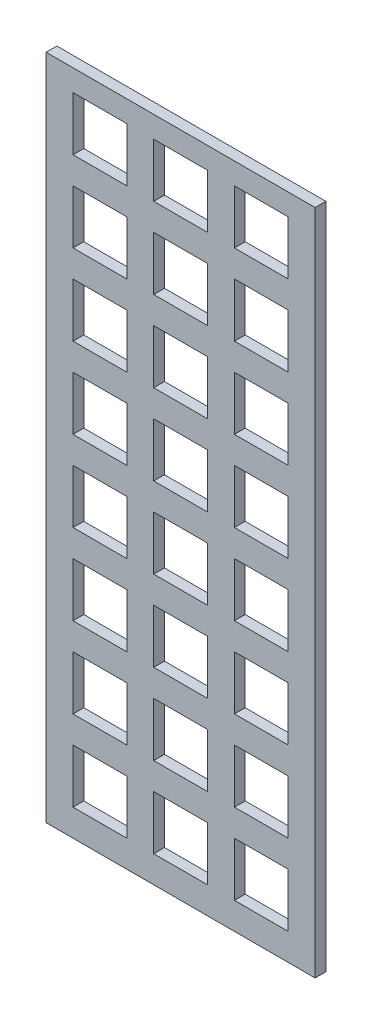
ISO-10303-21;
HEADER;
FILE_DESCRIPTION(('STEP AP214'),'2;1');
FILE_NAME('part.step','',(''),(''),'','','');
FILE_SCHEMA(('AUTOMOTIVE_DESIGN { 1 0 10303 214 1 1 1 1 }'));
ENDSEC;
DATA;
#1=APPLICATION_CONTEXT('core data for automotive mechanical design processes');
#2=APPLICATION_PROTOCOL_DEFINITION('international standard','automotive_design',2000,#1);
#3=PRODUCT_CONTEXT('',#1,'mechanical');
#4=PRODUCT('Part','Part','',(#3));
#5=PRODUCT_RELATED_PRODUCT_CATEGORY('part','',(#4));
#6=PRODUCT_DEFINITION_FORMATION('','',#4);
#7=PRODUCT_DEFINITION_CONTEXT('part definition',#1,'design');
#8=PRODUCT_DEFINITION('design','',#6,#7);
#9=PRODUCT_DEFINITION_SHAPE('','',#8);
#10=(LENGTH_UNIT() NAMED_UNIT(*) SI_UNIT(.MILLI.,.METRE.));
#11=(NAMED_UNIT(*) PLANE_ANGLE_UNIT() SI_UNIT($,.RADIAN.));
#12=(NAMED_UNIT(*) SI_UNIT($,.STERADIAN.) SOLID_ANGLE_UNIT());
#13=UNCERTAINTY_MEASURE_WITH_UNIT(LENGTH_MEASURE(1.E-05),#10,'distance_accuracy_value','');
#14=(GEOMETRIC_REPRESENTATION_CONTEXT(3) GLOBAL_UNCERTAINTY_ASSIGNED_CONTEXT((#13)) GLOBAL_UNIT_ASSIGNED_CONTEXT((#10,
#11,#12)) REPRESENTATION_CONTEXT('',''));
#15=CARTESIAN_POINT('',(0.,0.,0.));
#16=DIRECTION('',(0.,0.,1.));
#17=DIRECTION('',(1.,0.,0.));
#18=AXIS2_PLACEMENT_3D('',#15,#16,#17);
#19=CARTESIAN_POINT('',(0.,0.,1.));
#20=DIRECTION('',(1.,0.,0.));
#21=DIRECTION('',(0.,0.,-1.));
#22=AXIS2_PLACEMENT_3D('',#19,#20,#21);
#23=PLANE('',#22);
#24=DIRECTION('',(0.,-1.,0.));
#25=VECTOR('',#24,1.);
#26=CARTESIAN_POINT('',(0.,0.,0.));
#27=LINE('',#26,#25);
#28=CARTESIAN_POINT('',(0.,62.,0.));
#29=VERTEX_POINT('',#28);
#30=CARTESIAN_POINT('',(0.,0.,0.));
#31=VERTEX_POINT('',#30);
#32=EDGE_CURVE('E1413',#29,#31,#27,.T.);
#33=ORIENTED_EDGE('',*,*,#32,.T.);
#34=DIRECTION('',(0.,0.,-1.));
#35=VECTOR('',#34,1.);
#36=CARTESIAN_POINT('',(0.,0.,1.));
#37=LINE('',#36,#35);
#38=CARTESIAN_POINT('',(0.,0.,1.));
#39=VERTEX_POINT('',#38);
#40=EDGE_CURVE('E11',#39,#31,#37,.T.);
#41=ORIENTED_EDGE('',*,*,#40,.F.);
#42=DIRECTION('',(0.,-1.,0.));
#43=VECTOR('',#42,1.);
#44=CARTESIAN_POINT('',(0.,0.,1.));
#45=LINE('',#44,#43);
#46=CARTESIAN_POINT('',(0.,62.,1.));
#47=VERTEX_POINT('',#46);
#48=EDGE_CURVE('E1420',#47,#39,#45,.T.);
#49=ORIENTED_EDGE('',*,*,#48,.F.);
#50=DIRECTION('',(0.,0.,-1.));
#51=VECTOR('',#50,1.);
#52=CARTESIAN_POINT('',(0.,62.,1.));
#53=LINE('',#52,#51);
#54=EDGE_CURVE('E1430',#47,#29,#53,.T.);
#55=ORIENTED_EDGE('',*,*,#54,.T.);
#56=EDGE_LOOP('',(#33,#41,#49,#55));
#57=FACE_BOUND('',#56,.T.);
#58=ADVANCED_FACE('F31',(#57),#23,.F.);
#59=CARTESIAN_POINT('',(0.,0.,1.));
#60=DIRECTION('',(0.,1.,0.));
#61=DIRECTION('',(0.,0.,1.));
#62=AXIS2_PLACEMENT_3D('',#59,#60,#61);
#63=PLANE('',#62);
#64=DIRECTION('',(1.,0.,0.));
#65=VECTOR('',#64,1.);
#66=CARTESIAN_POINT('',(0.,0.,0.));
#67=LINE('',#66,#65);
#68=CARTESIAN_POINT('',(25.,0.,0.));
#69=VERTEX_POINT('',#68);
#70=EDGE_CURVE('E1433',#31,#69,#67,.T.);
#71=ORIENTED_EDGE('',*,*,#70,.T.);
#72=DIRECTION('',(0.,0.,-1.));
#73=VECTOR('',#72,1.);
#74=CARTESIAN_POINT('',(25.,0.,1.));
#75=LINE('',#74,#73);
#76=CARTESIAN_POINT('',(25.,0.,1.));
#77=VERTEX_POINT('',#76);
#78=EDGE_CURVE('E38',#77,#69,#75,.T.);
#79=ORIENTED_EDGE('',*,*,#78,.F.);
#80=DIRECTION('',(1.,0.,0.));
#81=VECTOR('',#80,1.);
#82=CARTESIAN_POINT('',(0.,0.,1.));
#83=LINE('',#82,#81);
#84=EDGE_CURVE('E1423',#39,#77,#83,.T.);
#85=ORIENTED_EDGE('',*,*,#84,.F.);
#86=ORIENTED_EDGE('',*,*,#40,.T.);
#87=EDGE_LOOP('',(#71,#79,#85,#86));
#88=FACE_BOUND('',#87,.T.);
#89=ADVANCED_FACE('F1462',(#88),#63,.F.);
#90=CARTESIAN_POINT('',(25.,0.,1.));
#91=DIRECTION('',(-1.,0.,0.));
#92=DIRECTION('',(0.,-1.,0.));
#93=AXIS2_PLACEMENT_3D('',#90,#91,#92);
#94=PLANE('',#93);
#95=DIRECTION('',(0.,1.,0.));
#96=VECTOR('',#95,1.);
#97=CARTESIAN_POINT('',(25.,0.,0.));
#98=LINE('',#97,#96);
#99=CARTESIAN_POINT('',(25.,62.,0.));
#100=VERTEX_POINT('',#99);
#101=EDGE_CURVE('E1435',#69,#100,#98,.T.);
#102=ORIENTED_EDGE('',*,*,#101,.T.);
#103=DIRECTION('',(0.,0.,-1.));
#104=VECTOR('',#103,1.);
#105=CARTESIAN_POINT('',(25.,62.,1.));
#106=LINE('',#105,#104);
#107=CARTESIAN_POINT('',(25.,62.,1.));
#108=VERTEX_POINT('',#107);
#109=EDGE_CURVE('E1440',#108,#100,#106,.T.);
#110=ORIENTED_EDGE('',*,*,#109,.F.);
#111=DIRECTION('',(0.,1.,0.));
#112=VECTOR('',#111,1.);
#113=CARTESIAN_POINT('',(25.,0.,1.));
#114=LINE('',#113,#112);
#115=EDGE_CURVE('E1426',#77,#108,#114,.T.);
#116=ORIENTED_EDGE('',*,*,#115,.F.);
#117=ORIENTED_EDGE('',*,*,#78,.T.);
#118=EDGE_LOOP('',(#102,#110,#116,#117));
#119=FACE_BOUND('',#118,.T.);
#120=ADVANCED_FACE('F1447',(#119),#94,.F.);
#121=CARTESIAN_POINT('',(0.,62.,1.));
#122=DIRECTION('',(0.,-1.,0.));
#123=DIRECTION('',(0.,0.,-1.));
#124=AXIS2_PLACEMENT_3D('',#121,#122,#123);
#125=PLANE('',#124);
#126=DIRECTION('',(-1.,0.,0.));
#127=VECTOR('',#126,1.);
#128=CARTESIAN_POINT('',(0.,62.,0.));
#129=LINE('',#128,#127);
#130=EDGE_CURVE('E1424',#100,#29,#129,.T.);
#131=ORIENTED_EDGE('',*,*,#130,.T.);
#132=ORIENTED_EDGE('',*,*,#54,.F.);
#133=DIRECTION('',(-1.,0.,0.));
#134=VECTOR('',#133,1.);
#135=CARTESIAN_POINT('',(0.,62.,1.));
#136=LINE('',#135,#134);
#137=EDGE_CURVE('E1428',#108,#47,#136,.T.);
#138=ORIENTED_EDGE('',*,*,#137,.F.);
#139=ORIENTED_EDGE('',*,*,#109,.T.);
#140=EDGE_LOOP('',(#131,#132,#138,#139));
#141=FACE_BOUND('',#140,.T.);
#142=ADVANCED_FACE('F1455',(#141),#125,.F.);
#143=CARTESIAN_POINT('',(0.,62.,1.));
#144=DIRECTION('',(0.,0.,-1.));
#145=DIRECTION('',(-1.,0.,0.));
#146=AXIS2_PLACEMENT_3D('',#143,#144,#145);
#147=PLANE('',#146);
#148=DIRECTION('',(0.,1.,0.));
#149=VECTOR('',#148,1.);
#150=CARTESIAN_POINT('',(7.49999999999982,54.9999999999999,1.));
#151=LINE('',#150,#149);
#152=CARTESIAN_POINT('',(7.49999999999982,54.9999999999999,1.));
#153=VERTEX_POINT('',#152);
#154=CARTESIAN_POINT('',(7.49999999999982,59.9999999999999,1.));
#155=VERTEX_POINT('',#154);
#156=EDGE_CURVE('E674',#153,#155,#151,.T.);
#157=ORIENTED_EDGE('',*,*,#156,.F.);
#158=DIRECTION('',(1.,0.,0.));
#159=VECTOR('',#158,1.);
#160=CARTESIAN_POINT('',(7.49999999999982,54.9999999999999,1.));
#161=LINE('',#160,#159);
#162=CARTESIAN_POINT('',(2.49999999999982,54.9999999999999,1.));
#163=VERTEX_POINT('',#162);
#164=EDGE_CURVE('E45',#163,#153,#161,.T.);
#165=ORIENTED_EDGE('',*,*,#164,.F.);
#166=DIRECTION('',(0.,-1.,0.));
#167=VECTOR('',#166,1.);
#168=CARTESIAN_POINT('',(2.49999999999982,54.9999999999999,1.));
#169=LINE('',#168,#167);
#170=CARTESIAN_POINT('',(2.49999999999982,59.9999999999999,1.));
#171=VERTEX_POINT('',#170);
#172=EDGE_CURVE('E665',#171,#163,#169,.T.);
#173=ORIENTED_EDGE('',*,*,#172,.F.);
#174=DIRECTION('',(-1.,0.,0.));
#175=VECTOR('',#174,1.);
#176=CARTESIAN_POINT('',(7.49999999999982,59.9999999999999,1.));
#177=LINE('',#176,#175);
#178=EDGE_CURVE('E668',#155,#171,#177,.T.);
#179=ORIENTED_EDGE('',*,*,#178,.F.);
#180=EDGE_LOOP('',(#157,#165,#173,#179));
#181=FACE_BOUND('',#180,.T.);
#182=DIRECTION('',(0.,1.,0.));
#183=VECTOR('',#182,1.);
#184=CARTESIAN_POINT('',(14.9999999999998,54.9999999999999,1.));
#185=LINE('',#184,#183);
#186=CARTESIAN_POINT('',(14.9999999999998,54.9999999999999,1.));
#187=VERTEX_POINT('',#186);
#188=CARTESIAN_POINT('',(14.9999999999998,59.9999999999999,1.));
#189=VERTEX_POINT('',#188);
#190=EDGE_CURVE('E699',#187,#189,#185,.T.);
#191=ORIENTED_EDGE('',*,*,#190,.F.);
#192=DIRECTION('',(1.,0.,0.));
#193=VECTOR('',#192,1.);
#194=CARTESIAN_POINT('',(14.9999999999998,54.9999999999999,1.));
#195=LINE('',#194,#193);
#196=CARTESIAN_POINT('',(9.99999999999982,54.9999999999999,1.));
#197=VERTEX_POINT('',#196);
#198=EDGE_CURVE('E680',#197,#187,#195,.T.);
#199=ORIENTED_EDGE('',*,*,#198,.F.);
#200=DIRECTION('',(0.,-1.,0.));
#201=VECTOR('',#200,1.);
#202=CARTESIAN_POINT('',(9.99999999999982,54.9999999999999,1.));
#203=LINE('',#202,#201);
#204=CARTESIAN_POINT('',(9.99999999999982,59.9999999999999,1.));
#205=VERTEX_POINT('',#204);
#206=EDGE_CURVE('E688',#205,#197,#203,.T.);
#207=ORIENTED_EDGE('',*,*,#206,.F.);
#208=DIRECTION('',(-1.,0.,0.));
#209=VECTOR('',#208,1.);
#210=CARTESIAN_POINT('',(14.9999999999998,59.9999999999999,1.));
#211=LINE('',#210,#209);
#212=EDGE_CURVE('E702',#189,#205,#211,.T.);
#213=ORIENTED_EDGE('',*,*,#212,.F.);
#214=EDGE_LOOP('',(#191,#199,#207,#213));
#215=FACE_BOUND('',#214,.T.);
#216=DIRECTION('',(0.,1.,0.));
#217=VECTOR('',#216,1.);
#218=CARTESIAN_POINT('',(22.4999999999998,55.,1.));
#219=LINE('',#218,#217);
#220=CARTESIAN_POINT('',(22.4999999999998,55.,1.));
#221=VERTEX_POINT('',#220);
#222=CARTESIAN_POINT('',(22.4999999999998,60.,1.));
#223=VERTEX_POINT('',#222);
#224=EDGE_CURVE('E731',#221,#223,#219,.T.);
#225=ORIENTED_EDGE('',*,*,#224,.F.);
#226=DIRECTION('',(1.,0.,0.));
#227=VECTOR('',#226,1.);
#228=CARTESIAN_POINT('',(22.4999999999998,55.,1.));
#229=LINE('',#228,#227);
#230=CARTESIAN_POINT('',(17.4999999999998,55.,1.));
#231=VERTEX_POINT('',#230);
#232=EDGE_CURVE('E709',#231,#221,#229,.T.);
#233=ORIENTED_EDGE('',*,*,#232,.F.);
#234=DIRECTION('',(0.,-1.,0.));
#235=VECTOR('',#234,1.);
#236=CARTESIAN_POINT('',(17.4999999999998,55.,1.));
#237=LINE('',#236,#235);
#238=CARTESIAN_POINT('',(17.4999999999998,60.,1.));
#239=VERTEX_POINT('',#238);
#240=EDGE_CURVE('E720',#239,#231,#237,.T.);
#241=ORIENTED_EDGE('',*,*,#240,.F.);
#242=DIRECTION('',(-1.,0.,0.));
#243=VECTOR('',#242,1.);
#244=CARTESIAN_POINT('',(22.4999999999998,60.,1.));
#245=LINE('',#244,#243);
#246=EDGE_CURVE('E734',#223,#239,#245,.T.);
#247=ORIENTED_EDGE('',*,*,#246,.F.);
#248=EDGE_LOOP('',(#225,#233,#241,#247));
#249=FACE_BOUND('',#248,.T.);
#250=DIRECTION('',(0.,1.,0.));
#251=VECTOR('',#250,1.);
#252=CARTESIAN_POINT('',(7.49999999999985,47.4999999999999,1.));
#253=LINE('',#252,#251);
#254=CARTESIAN_POINT('',(7.49999999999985,47.4999999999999,1.));
#255=VERTEX_POINT('',#254);
#256=CARTESIAN_POINT('',(7.49999999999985,52.4999999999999,1.));
#257=VERTEX_POINT('',#256);
#258=EDGE_CURVE('E763',#255,#257,#253,.T.);
#259=ORIENTED_EDGE('',*,*,#258,.F.);
#260=DIRECTION('',(1.,0.,0.));
#261=VECTOR('',#260,1.);
#262=CARTESIAN_POINT('',(7.49999999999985,47.4999999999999,1.));
#263=LINE('',#262,#261);
#264=CARTESIAN_POINT('',(2.49999999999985,47.4999999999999,1.));
#265=VERTEX_POINT('',#264);
#266=EDGE_CURVE('E741',#265,#255,#263,.T.);
#267=ORIENTED_EDGE('',*,*,#266,.F.);
#268=DIRECTION('',(0.,-1.,0.));
#269=VECTOR('',#268,1.);
#270=CARTESIAN_POINT('',(2.49999999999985,47.4999999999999,1.));
#271=LINE('',#270,#269);
#272=CARTESIAN_POINT('',(2.49999999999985,52.4999999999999,1.));
#273=VERTEX_POINT('',#272);
#274=EDGE_CURVE('E752',#273,#265,#271,.T.);
#275=ORIENTED_EDGE('',*,*,#274,.F.);
#276=DIRECTION('',(-1.,0.,0.));
#277=VECTOR('',#276,1.);
#278=CARTESIAN_POINT('',(7.49999999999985,52.4999999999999,1.));
#279=LINE('',#278,#277);
#280=EDGE_CURVE('E766',#257,#273,#279,.T.);
#281=ORIENTED_EDGE('',*,*,#280,.F.);
#282=EDGE_LOOP('',(#259,#267,#275,#281));
#283=FACE_BOUND('',#282,.T.);
#284=DIRECTION('',(0.,1.,0.));
#285=VECTOR('',#284,1.);
#286=CARTESIAN_POINT('',(14.9999999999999,47.4999999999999,1.));
#287=LINE('',#286,#285);
#288=CARTESIAN_POINT('',(14.9999999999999,47.4999999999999,1.));
#289=VERTEX_POINT('',#288);
#290=CARTESIAN_POINT('',(14.9999999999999,52.4999999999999,1.));
#291=VERTEX_POINT('',#290);
#292=EDGE_CURVE('E795',#289,#291,#287,.T.);
#293=ORIENTED_EDGE('',*,*,#292,.F.);
#294=DIRECTION('',(1.,0.,0.));
#295=VECTOR('',#294,1.);
#296=CARTESIAN_POINT('',(14.9999999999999,47.4999999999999,1.));
#297=LINE('',#296,#295);
#298=CARTESIAN_POINT('',(9.99999999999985,47.4999999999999,1.));
#299=VERTEX_POINT('',#298);
#300=EDGE_CURVE('E773',#299,#289,#297,.T.);
#301=ORIENTED_EDGE('',*,*,#300,.F.);
#302=DIRECTION('',(0.,-1.,0.));
#303=VECTOR('',#302,1.);
#304=CARTESIAN_POINT('',(9.99999999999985,47.4999999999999,1.));
#305=LINE('',#304,#303);
#306=CARTESIAN_POINT('',(9.99999999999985,52.4999999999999,1.));
#307=VERTEX_POINT('',#306);
#308=EDGE_CURVE('E784',#307,#299,#305,.T.);
#309=ORIENTED_EDGE('',*,*,#308,.F.);
#310=DIRECTION('',(-1.,0.,0.));
#311=VECTOR('',#310,1.);
#312=CARTESIAN_POINT('',(14.9999999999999,52.4999999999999,1.));
#313=LINE('',#312,#311);
#314=EDGE_CURVE('E798',#291,#307,#313,.T.);
#315=ORIENTED_EDGE('',*,*,#314,.F.);
#316=EDGE_LOOP('',(#293,#301,#309,#315));
#317=FACE_BOUND('',#316,.T.);
#318=DIRECTION('',(0.,1.,0.));
#319=VECTOR('',#318,1.);
#320=CARTESIAN_POINT('',(22.4999999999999,47.5,1.));
#321=LINE('',#320,#319);
#322=CARTESIAN_POINT('',(22.4999999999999,47.5,1.));
#323=VERTEX_POINT('',#322);
#324=CARTESIAN_POINT('',(22.4999999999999,52.5,1.));
#325=VERTEX_POINT('',#324);
#326=EDGE_CURVE('E827',#323,#325,#321,.T.);
#327=ORIENTED_EDGE('',*,*,#326,.F.);
#328=DIRECTION('',(1.,0.,0.));
#329=VECTOR('',#328,1.);
#330=CARTESIAN_POINT('',(22.4999999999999,47.5,1.));
#331=LINE('',#330,#329);
#332=CARTESIAN_POINT('',(17.4999999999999,47.5,1.));
#333=VERTEX_POINT('',#332);
#334=EDGE_CURVE('E805',#333,#323,#331,.T.);
#335=ORIENTED_EDGE('',*,*,#334,.F.);
#336=DIRECTION('',(0.,-1.,0.));
#337=VECTOR('',#336,1.);
#338=CARTESIAN_POINT('',(17.4999999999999,47.5,1.));
#339=LINE('',#338,#337);
#340=CARTESIAN_POINT('',(17.4999999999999,52.5,1.));
#341=VERTEX_POINT('',#340);
#342=EDGE_CURVE('E816',#341,#333,#339,.T.);
#343=ORIENTED_EDGE('',*,*,#342,.F.);
#344=DIRECTION('',(-1.,0.,0.));
#345=VECTOR('',#344,1.);
#346=CARTESIAN_POINT('',(22.4999999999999,52.5,1.));
#347=LINE('',#346,#345);
#348=EDGE_CURVE('E830',#325,#341,#347,.T.);
#349=ORIENTED_EDGE('',*,*,#348,.F.);
#350=EDGE_LOOP('',(#327,#335,#343,#349));
#351=FACE_BOUND('',#350,.T.);
#352=DIRECTION('',(0.,1.,0.));
#353=VECTOR('',#352,1.);
#354=CARTESIAN_POINT('',(7.49999999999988,39.9999999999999,1.));
#355=LINE('',#354,#353);
#356=CARTESIAN_POINT('',(7.49999999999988,39.9999999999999,1.));
#357=VERTEX_POINT('',#356);
#358=CARTESIAN_POINT('',(7.49999999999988,44.9999999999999,1.));
#359=VERTEX_POINT('',#358);
#360=EDGE_CURVE('E859',#357,#359,#355,.T.);
#361=ORIENTED_EDGE('',*,*,#360,.F.);
#362=DIRECTION('',(1.,0.,0.));
#363=VECTOR('',#362,1.);
#364=CARTESIAN_POINT('',(7.49999999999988,39.9999999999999,1.));
#365=LINE('',#364,#363);
#366=CARTESIAN_POINT('',(2.49999999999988,39.9999999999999,1.));
#367=VERTEX_POINT('',#366);
#368=EDGE_CURVE('E837',#367,#357,#365,.T.);
#369=ORIENTED_EDGE('',*,*,#368,.F.);
#370=DIRECTION('',(0.,-1.,0.));
#371=VECTOR('',#370,1.);
#372=CARTESIAN_POINT('',(2.49999999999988,39.9999999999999,1.));
#373=LINE('',#372,#371);
#374=CARTESIAN_POINT('',(2.49999999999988,44.9999999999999,1.));
#375=VERTEX_POINT('',#374);
#376=EDGE_CURVE('E848',#375,#367,#373,.T.);
#377=ORIENTED_EDGE('',*,*,#376,.F.);
#378=DIRECTION('',(-1.,0.,0.));
#379=VECTOR('',#378,1.);
#380=CARTESIAN_POINT('',(7.49999999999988,44.9999999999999,1.));
#381=LINE('',#380,#379);
#382=EDGE_CURVE('E862',#359,#375,#381,.T.);
#383=ORIENTED_EDGE('',*,*,#382,.F.);
#384=EDGE_LOOP('',(#361,#369,#377,#383));
#385=FACE_BOUND('',#384,.T.);
#386=DIRECTION('',(0.,1.,0.));
#387=VECTOR('',#386,1.);
#388=CARTESIAN_POINT('',(14.9999999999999,39.9999999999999,1.));
#389=LINE('',#388,#387);
#390=CARTESIAN_POINT('',(14.9999999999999,39.9999999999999,1.));
#391=VERTEX_POINT('',#390);
#392=CARTESIAN_POINT('',(14.9999999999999,44.9999999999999,1.));
#393=VERTEX_POINT('',#392);
#394=EDGE_CURVE('E891',#391,#393,#389,.T.);
#395=ORIENTED_EDGE('',*,*,#394,.F.);
#396=DIRECTION('',(1.,0.,0.));
#397=VECTOR('',#396,1.);
#398=CARTESIAN_POINT('',(14.9999999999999,39.9999999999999,1.));
#399=LINE('',#398,#397);
#400=CARTESIAN_POINT('',(9.99999999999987,39.9999999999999,1.));
#401=VERTEX_POINT('',#400);
#402=EDGE_CURVE('E869',#401,#391,#399,.T.);
#403=ORIENTED_EDGE('',*,*,#402,.F.);
#404=DIRECTION('',(0.,-1.,0.));
#405=VECTOR('',#404,1.);
#406=CARTESIAN_POINT('',(9.99999999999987,39.9999999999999,1.));
#407=LINE('',#406,#405);
#408=CARTESIAN_POINT('',(9.99999999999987,44.9999999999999,1.));
#409=VERTEX_POINT('',#408);
#410=EDGE_CURVE('E880',#409,#401,#407,.T.);
#411=ORIENTED_EDGE('',*,*,#410,.F.);
#412=DIRECTION('',(-1.,0.,0.));
#413=VECTOR('',#412,1.);
#414=CARTESIAN_POINT('',(14.9999999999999,44.9999999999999,1.));
#415=LINE('',#414,#413);
#416=EDGE_CURVE('E894',#393,#409,#415,.T.);
#417=ORIENTED_EDGE('',*,*,#416,.F.);
#418=EDGE_LOOP('',(#395,#403,#411,#417));
#419=FACE_BOUND('',#418,.T.);
#420=DIRECTION('',(0.,1.,0.));
#421=VECTOR('',#420,1.);
#422=CARTESIAN_POINT('',(22.4999999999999,40.,1.));
#423=LINE('',#422,#421);
#424=CARTESIAN_POINT('',(22.4999999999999,40.,1.));
#425=VERTEX_POINT('',#424);
#426=CARTESIAN_POINT('',(22.4999999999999,45.,1.));
#427=VERTEX_POINT('',#426);
#428=EDGE_CURVE('E923',#425,#427,#423,.T.);
#429=ORIENTED_EDGE('',*,*,#428,.F.);
#430=DIRECTION('',(1.,0.,0.));
#431=VECTOR('',#430,1.);
#432=CARTESIAN_POINT('',(22.4999999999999,40.,1.));
#433=LINE('',#432,#431);
#434=CARTESIAN_POINT('',(17.4999999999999,40.,1.));
#435=VERTEX_POINT('',#434);
#436=EDGE_CURVE('E901',#435,#425,#433,.T.);
#437=ORIENTED_EDGE('',*,*,#436,.F.);
#438=DIRECTION('',(0.,-1.,0.));
#439=VECTOR('',#438,1.);
#440=CARTESIAN_POINT('',(17.4999999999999,40.,1.));
#441=LINE('',#440,#439);
#442=CARTESIAN_POINT('',(17.4999999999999,45.,1.));
#443=VERTEX_POINT('',#442);
#444=EDGE_CURVE('E912',#443,#435,#441,.T.);
#445=ORIENTED_EDGE('',*,*,#444,.F.);
#446=DIRECTION('',(-1.,0.,0.));
#447=VECTOR('',#446,1.);
#448=CARTESIAN_POINT('',(22.4999999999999,45.,1.));
#449=LINE('',#448,#447);
#450=EDGE_CURVE('E926',#427,#443,#449,.T.);
#451=ORIENTED_EDGE('',*,*,#450,.F.);
#452=EDGE_LOOP('',(#429,#437,#445,#451));
#453=FACE_BOUND('',#452,.T.);
#454=DIRECTION('',(0.,1.,0.));
#455=VECTOR('',#454,1.);
#456=CARTESIAN_POINT('',(7.4999999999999,32.4999999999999,1.));
#457=LINE('',#456,#455);
#458=CARTESIAN_POINT('',(7.4999999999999,32.4999999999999,1.));
#459=VERTEX_POINT('',#458);
#460=CARTESIAN_POINT('',(7.4999999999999,37.4999999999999,1.));
#461=VERTEX_POINT('',#460);
#462=EDGE_CURVE('E955',#459,#461,#457,.T.);
#463=ORIENTED_EDGE('',*,*,#462,.F.);
#464=DIRECTION('',(1.,0.,0.));
#465=VECTOR('',#464,1.);
#466=CARTESIAN_POINT('',(7.4999999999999,32.4999999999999,1.));
#467=LINE('',#466,#465);
#468=CARTESIAN_POINT('',(2.4999999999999,32.4999999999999,1.));
#469=VERTEX_POINT('',#468);
#470=EDGE_CURVE('E933',#469,#459,#467,.T.);
#471=ORIENTED_EDGE('',*,*,#470,.F.);
#472=DIRECTION('',(0.,-1.,0.));
#473=VECTOR('',#472,1.);
#474=CARTESIAN_POINT('',(2.4999999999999,32.4999999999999,1.));
#475=LINE('',#474,#473);
#476=CARTESIAN_POINT('',(2.4999999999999,37.4999999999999,1.));
#477=VERTEX_POINT('',#476);
#478=EDGE_CURVE('E944',#477,#469,#475,.T.);
#479=ORIENTED_EDGE('',*,*,#478,.F.);
#480=DIRECTION('',(-1.,0.,0.));
#481=VECTOR('',#480,1.);
#482=CARTESIAN_POINT('',(7.4999999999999,37.4999999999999,1.));
#483=LINE('',#482,#481);
#484=EDGE_CURVE('E958',#461,#477,#483,.T.);
#485=ORIENTED_EDGE('',*,*,#484,.F.);
#486=EDGE_LOOP('',(#463,#471,#479,#485));
#487=FACE_BOUND('',#486,.T.);
#488=DIRECTION('',(0.,1.,0.));
#489=VECTOR('',#488,1.);
#490=CARTESIAN_POINT('',(14.9999999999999,32.4999999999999,1.));
#491=LINE('',#490,#489);
#492=CARTESIAN_POINT('',(14.9999999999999,32.4999999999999,1.));
#493=VERTEX_POINT('',#492);
#494=CARTESIAN_POINT('',(14.9999999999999,37.5,1.));
#495=VERTEX_POINT('',#494);
#496=EDGE_CURVE('E987',#493,#495,#491,.T.);
#497=ORIENTED_EDGE('',*,*,#496,.F.);
#498=DIRECTION('',(1.,0.,0.));
#499=VECTOR('',#498,1.);
#500=CARTESIAN_POINT('',(14.9999999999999,32.4999999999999,1.));
#501=LINE('',#500,#499);
#502=CARTESIAN_POINT('',(9.9999999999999,32.4999999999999,1.));
#503=VERTEX_POINT('',#502);
#504=EDGE_CURVE('E965',#503,#493,#501,.T.);
#505=ORIENTED_EDGE('',*,*,#504,.F.);
#506=DIRECTION('',(0.,-1.,0.));
#507=VECTOR('',#506,1.);
#508=CARTESIAN_POINT('',(9.9999999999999,32.4999999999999,1.));
#509=LINE('',#508,#507);
#510=CARTESIAN_POINT('',(9.9999999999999,37.4999999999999,1.));
#511=VERTEX_POINT('',#510);
#512=EDGE_CURVE('E976',#511,#503,#509,.T.);
#513=ORIENTED_EDGE('',*,*,#512,.F.);
#514=DIRECTION('',(-1.,0.,0.));
#515=VECTOR('',#514,1.);
#516=CARTESIAN_POINT('',(14.9999999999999,37.5,1.));
#517=LINE('',#516,#515);
#518=EDGE_CURVE('E990',#495,#511,#517,.T.);
#519=ORIENTED_EDGE('',*,*,#518,.F.);
#520=EDGE_LOOP('',(#497,#505,#513,#519));
#521=FACE_BOUND('',#520,.T.);
#522=DIRECTION('',(0.,1.,0.));
#523=VECTOR('',#522,1.);
#524=CARTESIAN_POINT('',(22.4999999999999,32.5,1.));
#525=LINE('',#524,#523);
#526=CARTESIAN_POINT('',(22.4999999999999,32.5,1.));
#527=VERTEX_POINT('',#526);
#528=CARTESIAN_POINT('',(22.4999999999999,37.5,1.));
#529=VERTEX_POINT('',#528);
#530=EDGE_CURVE('E1019',#527,#529,#525,.T.);
#531=ORIENTED_EDGE('',*,*,#530,.F.);
#532=DIRECTION('',(1.,0.,0.));
#533=VECTOR('',#532,1.);
#534=CARTESIAN_POINT('',(22.4999999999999,32.5,1.));
#535=LINE('',#534,#533);
#536=CARTESIAN_POINT('',(17.4999999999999,32.5,1.));
#537=VERTEX_POINT('',#536);
#538=EDGE_CURVE('E997',#537,#527,#535,.T.);
#539=ORIENTED_EDGE('',*,*,#538,.F.);
#540=DIRECTION('',(0.,-1.,0.));
#541=VECTOR('',#540,1.);
#542=CARTESIAN_POINT('',(17.4999999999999,32.5,1.));
#543=LINE('',#542,#541);
#544=CARTESIAN_POINT('',(17.4999999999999,37.5,1.));
#545=VERTEX_POINT('',#544);
#546=EDGE_CURVE('E1008',#545,#537,#543,.T.);
#547=ORIENTED_EDGE('',*,*,#546,.F.);
#548=DIRECTION('',(-1.,0.,0.));
#549=VECTOR('',#548,1.);
#550=CARTESIAN_POINT('',(22.4999999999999,37.5,1.));
#551=LINE('',#550,#549);
#552=EDGE_CURVE('E1022',#529,#545,#551,.T.);
#553=ORIENTED_EDGE('',*,*,#552,.F.);
#554=EDGE_LOOP('',(#531,#539,#547,#553));
#555=FACE_BOUND('',#554,.T.);
#556=DIRECTION('',(0.,1.,0.));
#557=VECTOR('',#556,1.);
#558=CARTESIAN_POINT('',(7.49999999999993,24.9999999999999,1.));
#559=LINE('',#558,#557);
#560=CARTESIAN_POINT('',(7.49999999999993,24.9999999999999,1.));
#561=VERTEX_POINT('',#560);
#562=CARTESIAN_POINT('',(7.49999999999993,29.9999999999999,1.));
#563=VERTEX_POINT('',#562);
#564=EDGE_CURVE('E1051',#561,#563,#559,.T.);
#565=ORIENTED_EDGE('',*,*,#564,.F.);
#566=DIRECTION('',(1.,0.,0.));
#567=VECTOR('',#566,1.);
#568=CARTESIAN_POINT('',(7.49999999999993,24.9999999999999,1.));
#569=LINE('',#568,#567);
#570=CARTESIAN_POINT('',(2.49999999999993,24.9999999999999,1.));
#571=VERTEX_POINT('',#570);
#572=EDGE_CURVE('E1029',#571,#561,#569,.T.);
#573=ORIENTED_EDGE('',*,*,#572,.F.);
#574=DIRECTION('',(0.,-1.,0.));
#575=VECTOR('',#574,1.);
#576=CARTESIAN_POINT('',(2.49999999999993,24.9999999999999,1.));
#577=LINE('',#576,#575);
#578=CARTESIAN_POINT('',(2.49999999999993,29.9999999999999,1.));
#579=VERTEX_POINT('',#578);
#580=EDGE_CURVE('E1040',#579,#571,#577,.T.);
#581=ORIENTED_EDGE('',*,*,#580,.F.);
#582=DIRECTION('',(-1.,0.,0.));
#583=VECTOR('',#582,1.);
#584=CARTESIAN_POINT('',(7.49999999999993,29.9999999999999,1.));
#585=LINE('',#584,#583);
#586=EDGE_CURVE('E1054',#563,#579,#585,.T.);
#587=ORIENTED_EDGE('',*,*,#586,.F.);
#588=EDGE_LOOP('',(#565,#573,#581,#587));
#589=FACE_BOUND('',#588,.T.);
#590=DIRECTION('',(0.,1.,0.));
#591=VECTOR('',#590,1.);
#592=CARTESIAN_POINT('',(14.9999999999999,24.9999999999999,1.));
#593=LINE('',#592,#591);
#594=CARTESIAN_POINT('',(14.9999999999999,24.9999999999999,1.));
#595=VERTEX_POINT('',#594);
#596=CARTESIAN_POINT('',(14.9999999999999,29.9999999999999,1.));
#597=VERTEX_POINT('',#596);
#598=EDGE_CURVE('E1083',#595,#597,#593,.T.);
#599=ORIENTED_EDGE('',*,*,#598,.F.);
#600=DIRECTION('',(1.,0.,0.));
#601=VECTOR('',#600,1.);
#602=CARTESIAN_POINT('',(14.9999999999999,24.9999999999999,1.));
#603=LINE('',#602,#601);
#604=CARTESIAN_POINT('',(9.99999999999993,24.9999999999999,1.));
#605=VERTEX_POINT('',#604);
#606=EDGE_CURVE('E1061',#605,#595,#603,.T.);
#607=ORIENTED_EDGE('',*,*,#606,.F.);
#608=DIRECTION('',(0.,-1.,0.));
#609=VECTOR('',#608,1.);
#610=CARTESIAN_POINT('',(9.99999999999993,24.9999999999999,1.));
#611=LINE('',#610,#609);
#612=CARTESIAN_POINT('',(9.99999999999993,29.9999999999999,1.));
#613=VERTEX_POINT('',#612);
#614=EDGE_CURVE('E1072',#613,#605,#611,.T.);
#615=ORIENTED_EDGE('',*,*,#614,.F.);
#616=DIRECTION('',(-1.,0.,0.));
#617=VECTOR('',#616,1.);
#618=CARTESIAN_POINT('',(14.9999999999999,29.9999999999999,1.));
#619=LINE('',#618,#617);
#620=EDGE_CURVE('E1086',#597,#613,#619,.T.);
#621=ORIENTED_EDGE('',*,*,#620,.F.);
#622=EDGE_LOOP('',(#599,#607,#615,#621));
#623=FACE_BOUND('',#622,.T.);
#624=DIRECTION('',(0.,1.,0.));
#625=VECTOR('',#624,1.);
#626=CARTESIAN_POINT('',(22.4999999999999,25.,1.));
#627=LINE('',#626,#625);
#628=CARTESIAN_POINT('',(22.4999999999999,25.,1.));
#629=VERTEX_POINT('',#628);
#630=CARTESIAN_POINT('',(22.4999999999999,30.,1.));
#631=VERTEX_POINT('',#630);
#632=EDGE_CURVE('E1115',#629,#631,#627,.T.);
#633=ORIENTED_EDGE('',*,*,#632,.F.);
#634=DIRECTION('',(1.,0.,0.));
#635=VECTOR('',#634,1.);
#636=CARTESIAN_POINT('',(22.4999999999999,25.,1.));
#637=LINE('',#636,#635);
#638=CARTESIAN_POINT('',(17.4999999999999,25.,1.));
#639=VERTEX_POINT('',#638);
#640=EDGE_CURVE('E1093',#639,#629,#637,.T.);
#641=ORIENTED_EDGE('',*,*,#640,.F.);
#642=DIRECTION('',(0.,-1.,0.));
#643=VECTOR('',#642,1.);
#644=CARTESIAN_POINT('',(17.4999999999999,25.,1.));
#645=LINE('',#644,#643);
#646=CARTESIAN_POINT('',(17.4999999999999,30.,1.));
#647=VERTEX_POINT('',#646);
#648=EDGE_CURVE('E1104',#647,#639,#645,.T.);
#649=ORIENTED_EDGE('',*,*,#648,.F.);
#650=DIRECTION('',(-1.,0.,0.));
#651=VECTOR('',#650,1.);
#652=CARTESIAN_POINT('',(22.4999999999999,30.,1.));
#653=LINE('',#652,#651);
#654=EDGE_CURVE('E1118',#631,#647,#653,.T.);
#655=ORIENTED_EDGE('',*,*,#654,.F.);
#656=EDGE_LOOP('',(#633,#641,#649,#655));
#657=FACE_BOUND('',#656,.T.);
#658=DIRECTION('',(0.,1.,0.));
#659=VECTOR('',#658,1.);
#660=CARTESIAN_POINT('',(7.49999999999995,17.4999999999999,1.));
#661=LINE('',#660,#659);
#662=CARTESIAN_POINT('',(7.49999999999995,17.4999999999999,1.));
#663=VERTEX_POINT('',#662);
#664=CARTESIAN_POINT('',(7.49999999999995,22.4999999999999,1.));
#665=VERTEX_POINT('',#664);
#666=EDGE_CURVE('E1147',#663,#665,#661,.T.);
#667=ORIENTED_EDGE('',*,*,#666,.F.);
#668=DIRECTION('',(1.,0.,0.));
#669=VECTOR('',#668,1.);
#670=CARTESIAN_POINT('',(7.49999999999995,17.4999999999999,1.));
#671=LINE('',#670,#669);
#672=CARTESIAN_POINT('',(2.49999999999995,17.4999999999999,1.));
#673=VERTEX_POINT('',#672);
#674=EDGE_CURVE('E1125',#673,#663,#671,.T.);
#675=ORIENTED_EDGE('',*,*,#674,.F.);
#676=DIRECTION('',(0.,-1.,0.));
#677=VECTOR('',#676,1.);
#678=CARTESIAN_POINT('',(2.49999999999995,17.4999999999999,1.));
#679=LINE('',#678,#677);
#680=CARTESIAN_POINT('',(2.49999999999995,22.4999999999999,1.));
#681=VERTEX_POINT('',#680);
#682=EDGE_CURVE('E1136',#681,#673,#679,.T.);
#683=ORIENTED_EDGE('',*,*,#682,.F.);
#684=DIRECTION('',(-1.,0.,0.));
#685=VECTOR('',#684,1.);
#686=CARTESIAN_POINT('',(7.49999999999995,22.4999999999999,1.));
#687=LINE('',#686,#685);
#688=EDGE_CURVE('E1150',#665,#681,#687,.T.);
#689=ORIENTED_EDGE('',*,*,#688,.F.);
#690=EDGE_LOOP('',(#667,#675,#683,#689));
#691=FACE_BOUND('',#690,.T.);
#692=DIRECTION('',(0.,1.,0.));
#693=VECTOR('',#692,1.);
#694=CARTESIAN_POINT('',(15.,17.4999999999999,1.));
#695=LINE('',#694,#693);
#696=CARTESIAN_POINT('',(15.,17.4999999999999,1.));
#697=VERTEX_POINT('',#696);
#698=CARTESIAN_POINT('',(15.,22.4999999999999,1.));
#699=VERTEX_POINT('',#698);
#700=EDGE_CURVE('E1179',#697,#699,#695,.T.);
#701=ORIENTED_EDGE('',*,*,#700,.F.);
#702=DIRECTION('',(1.,0.,0.));
#703=VECTOR('',#702,1.);
#704=CARTESIAN_POINT('',(15.,17.4999999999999,1.));
#705=LINE('',#704,#703);
#706=CARTESIAN_POINT('',(9.99999999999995,17.4999999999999,1.));
#707=VERTEX_POINT('',#706);
#708=EDGE_CURVE('E1157',#707,#697,#705,.T.);
#709=ORIENTED_EDGE('',*,*,#708,.F.);
#710=DIRECTION('',(0.,-1.,0.));
#711=VECTOR('',#710,1.);
#712=CARTESIAN_POINT('',(9.99999999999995,17.4999999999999,1.));
#713=LINE('',#712,#711);
#714=CARTESIAN_POINT('',(9.99999999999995,22.4999999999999,1.));
#715=VERTEX_POINT('',#714);
#716=EDGE_CURVE('E1168',#715,#707,#713,.T.);
#717=ORIENTED_EDGE('',*,*,#716,.F.);
#718=DIRECTION('',(-1.,0.,0.));
#719=VECTOR('',#718,1.);
#720=CARTESIAN_POINT('',(15.,22.4999999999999,1.));
#721=LINE('',#720,#719);
#722=EDGE_CURVE('E1182',#699,#715,#721,.T.);
#723=ORIENTED_EDGE('',*,*,#722,.F.);
#724=EDGE_LOOP('',(#701,#709,#717,#723));
#725=FACE_BOUND('',#724,.T.);
#726=DIRECTION('',(0.,1.,0.));
#727=VECTOR('',#726,1.);
#728=CARTESIAN_POINT('',(22.5,17.5,1.));
#729=LINE('',#728,#727);
#730=CARTESIAN_POINT('',(22.5,17.5,1.));
#731=VERTEX_POINT('',#730);
#732=CARTESIAN_POINT('',(22.5,22.5,1.));
#733=VERTEX_POINT('',#732);
#734=EDGE_CURVE('E1211',#731,#733,#729,.T.);
#735=ORIENTED_EDGE('',*,*,#734,.F.);
#736=DIRECTION('',(1.,0.,0.));
#737=VECTOR('',#736,1.);
#738=CARTESIAN_POINT('',(22.5,17.5,1.));
#739=LINE('',#738,#737);
#740=CARTESIAN_POINT('',(17.5,17.5,1.));
#741=VERTEX_POINT('',#740);
#742=EDGE_CURVE('E1189',#741,#731,#739,.T.);
#743=ORIENTED_EDGE('',*,*,#742,.F.);
#744=DIRECTION('',(0.,-1.,0.));
#745=VECTOR('',#744,1.);
#746=CARTESIAN_POINT('',(17.5,17.5,1.));
#747=LINE('',#746,#745);
#748=CARTESIAN_POINT('',(17.5,22.5,1.));
#749=VERTEX_POINT('',#748);
#750=EDGE_CURVE('E1200',#749,#741,#747,.T.);
#751=ORIENTED_EDGE('',*,*,#750,.F.);
#752=DIRECTION('',(-1.,0.,0.));
#753=VECTOR('',#752,1.);
#754=CARTESIAN_POINT('',(22.5,22.5,1.));
#755=LINE('',#754,#753);
#756=EDGE_CURVE('E1214',#733,#749,#755,.T.);
#757=ORIENTED_EDGE('',*,*,#756,.F.);
#758=EDGE_LOOP('',(#735,#743,#751,#757));
#759=FACE_BOUND('',#758,.T.);
#760=DIRECTION('',(0.,1.,0.));
#761=VECTOR('',#760,1.);
#762=CARTESIAN_POINT('',(7.49999999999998,9.9999999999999,1.));
#763=LINE('',#762,#761);
#764=CARTESIAN_POINT('',(7.49999999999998,9.9999999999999,1.));
#765=VERTEX_POINT('',#764);
#766=CARTESIAN_POINT('',(7.49999999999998,14.9999999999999,1.));
#767=VERTEX_POINT('',#766);
#768=EDGE_CURVE('E1243',#765,#767,#763,.T.);
#769=ORIENTED_EDGE('',*,*,#768,.F.);
#770=DIRECTION('',(1.,0.,0.));
#771=VECTOR('',#770,1.);
#772=CARTESIAN_POINT('',(7.49999999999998,9.9999999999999,1.));
#773=LINE('',#772,#771);
#774=CARTESIAN_POINT('',(2.49999999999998,9.9999999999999,1.));
#775=VERTEX_POINT('',#774);
#776=EDGE_CURVE('E1221',#775,#765,#773,.T.);
#777=ORIENTED_EDGE('',*,*,#776,.F.);
#778=DIRECTION('',(0.,-1.,0.));
#779=VECTOR('',#778,1.);
#780=CARTESIAN_POINT('',(2.49999999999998,9.9999999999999,1.));
#781=LINE('',#780,#779);
#782=CARTESIAN_POINT('',(2.49999999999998,14.9999999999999,1.));
#783=VERTEX_POINT('',#782);
#784=EDGE_CURVE('E1232',#783,#775,#781,.T.);
#785=ORIENTED_EDGE('',*,*,#784,.F.);
#786=DIRECTION('',(-1.,0.,0.));
#787=VECTOR('',#786,1.);
#788=CARTESIAN_POINT('',(7.49999999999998,14.9999999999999,1.));
#789=LINE('',#788,#787);
#790=EDGE_CURVE('E1246',#767,#783,#789,.T.);
#791=ORIENTED_EDGE('',*,*,#790,.F.);
#792=EDGE_LOOP('',(#769,#777,#785,#791));
#793=FACE_BOUND('',#792,.T.);
#794=DIRECTION('',(0.,1.,0.));
#795=VECTOR('',#794,1.);
#796=CARTESIAN_POINT('',(15.,9.99999999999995,1.));
#797=LINE('',#796,#795);
#798=CARTESIAN_POINT('',(15.,9.99999999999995,1.));
#799=VERTEX_POINT('',#798);
#800=CARTESIAN_POINT('',(15.,14.9999999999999,1.));
#801=VERTEX_POINT('',#800);
#802=EDGE_CURVE('E1275',#799,#801,#797,.T.);
#803=ORIENTED_EDGE('',*,*,#802,.F.);
#804=DIRECTION('',(1.,0.,0.));
#805=VECTOR('',#804,1.);
#806=CARTESIAN_POINT('',(15.,9.99999999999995,1.));
#807=LINE('',#806,#805);
#808=CARTESIAN_POINT('',(9.99999999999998,9.99999999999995,1.));
#809=VERTEX_POINT('',#808);
#810=EDGE_CURVE('E1253',#809,#799,#807,.T.);
#811=ORIENTED_EDGE('',*,*,#810,.F.);
#812=DIRECTION('',(0.,-1.,0.));
#813=VECTOR('',#812,1.);
#814=CARTESIAN_POINT('',(9.99999999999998,9.99999999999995,1.));
#815=LINE('',#814,#813);
#816=CARTESIAN_POINT('',(9.99999999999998,14.9999999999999,1.));
#817=VERTEX_POINT('',#816);
#818=EDGE_CURVE('E1264',#817,#809,#815,.T.);
#819=ORIENTED_EDGE('',*,*,#818,.F.);
#820=DIRECTION('',(-1.,0.,0.));
#821=VECTOR('',#820,1.);
#822=CARTESIAN_POINT('',(15.,14.9999999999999,1.));
#823=LINE('',#822,#821);
#824=EDGE_CURVE('E1278',#801,#817,#823,.T.);
#825=ORIENTED_EDGE('',*,*,#824,.F.);
#826=EDGE_LOOP('',(#803,#811,#819,#825));
#827=FACE_BOUND('',#826,.T.);
#828=DIRECTION('',(0.,1.,0.));
#829=VECTOR('',#828,1.);
#830=CARTESIAN_POINT('',(22.5,10.,1.));
#831=LINE('',#830,#829);
#832=CARTESIAN_POINT('',(22.5,10.,1.));
#833=VERTEX_POINT('',#832);
#834=CARTESIAN_POINT('',(22.5,15.,1.));
#835=VERTEX_POINT('',#834);
#836=EDGE_CURVE('E1307',#833,#835,#831,.T.);
#837=ORIENTED_EDGE('',*,*,#836,.F.);
#838=DIRECTION('',(1.,0.,0.));
#839=VECTOR('',#838,1.);
#840=CARTESIAN_POINT('',(22.5,10.,1.));
#841=LINE('',#840,#839);
#842=CARTESIAN_POINT('',(17.5,10.,1.));
#843=VERTEX_POINT('',#842);
#844=EDGE_CURVE('E1285',#843,#833,#841,.T.);
#845=ORIENTED_EDGE('',*,*,#844,.F.);
#846=DIRECTION('',(0.,-1.,0.));
#847=VECTOR('',#846,1.);
#848=CARTESIAN_POINT('',(17.5,10.,1.));
#849=LINE('',#848,#847);
#850=CARTESIAN_POINT('',(17.5,15.,1.));
#851=VERTEX_POINT('',#850);
#852=EDGE_CURVE('E1296',#851,#843,#849,.T.);
#853=ORIENTED_EDGE('',*,*,#852,.F.);
#854=DIRECTION('',(-1.,0.,0.));
#855=VECTOR('',#854,1.);
#856=CARTESIAN_POINT('',(22.5,15.,1.));
#857=LINE('',#856,#855);
#858=EDGE_CURVE('E1310',#835,#851,#857,.T.);
#859=ORIENTED_EDGE('',*,*,#858,.F.);
#860=EDGE_LOOP('',(#837,#845,#853,#859));
#861=FACE_BOUND('',#860,.T.);
#862=DIRECTION('',(0.,1.,0.));
#863=VECTOR('',#862,1.);
#864=CARTESIAN_POINT('',(7.50000000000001,2.4999999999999,1.));
#865=LINE('',#864,#863);
#866=CARTESIAN_POINT('',(7.50000000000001,2.4999999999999,1.));
#867=VERTEX_POINT('',#866);
#868=CARTESIAN_POINT('',(7.50000000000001,7.4999999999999,1.));
#869=VERTEX_POINT('',#868);
#870=EDGE_CURVE('E1339',#867,#869,#865,.T.);
#871=ORIENTED_EDGE('',*,*,#870,.F.);
#872=DIRECTION('',(1.,0.,0.));
#873=VECTOR('',#872,1.);
#874=CARTESIAN_POINT('',(7.50000000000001,2.4999999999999,1.));
#875=LINE('',#874,#873);
#876=CARTESIAN_POINT('',(2.50000000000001,2.4999999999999,1.));
#877=VERTEX_POINT('',#876);
#878=EDGE_CURVE('E1317',#877,#867,#875,.T.);
#879=ORIENTED_EDGE('',*,*,#878,.F.);
#880=DIRECTION('',(0.,-1.,0.));
#881=VECTOR('',#880,1.);
#882=CARTESIAN_POINT('',(2.50000000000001,2.4999999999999,1.));
#883=LINE('',#882,#881);
#884=CARTESIAN_POINT('',(2.50000000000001,7.49999999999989,1.));
#885=VERTEX_POINT('',#884);
#886=EDGE_CURVE('E1328',#885,#877,#883,.T.);
#887=ORIENTED_EDGE('',*,*,#886,.F.);
#888=DIRECTION('',(-1.,0.,0.));
#889=VECTOR('',#888,1.);
#890=CARTESIAN_POINT('',(7.50000000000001,7.4999999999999,1.));
#891=LINE('',#890,#889);
#892=EDGE_CURVE('E1342',#869,#885,#891,.T.);
#893=ORIENTED_EDGE('',*,*,#892,.F.);
#894=EDGE_LOOP('',(#871,#879,#887,#893));
#895=FACE_BOUND('',#894,.T.);
#896=DIRECTION('',(0.,1.,0.));
#897=VECTOR('',#896,1.);
#898=CARTESIAN_POINT('',(15.,2.49999999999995,1.));
#899=LINE('',#898,#897);
#900=CARTESIAN_POINT('',(15.,2.49999999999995,1.));
#901=VERTEX_POINT('',#900);
#902=CARTESIAN_POINT('',(15.,7.49999999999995,1.));
#903=VERTEX_POINT('',#902);
#904=EDGE_CURVE('E1371',#901,#903,#899,.T.);
#905=ORIENTED_EDGE('',*,*,#904,.F.);
#906=DIRECTION('',(1.,0.,0.));
#907=VECTOR('',#906,1.);
#908=CARTESIAN_POINT('',(15.,2.49999999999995,1.));
#909=LINE('',#908,#907);
#910=CARTESIAN_POINT('',(10.,2.49999999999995,1.));
#911=VERTEX_POINT('',#910);
#912=EDGE_CURVE('E1349',#911,#901,#909,.T.);
#913=ORIENTED_EDGE('',*,*,#912,.F.);
#914=DIRECTION('',(0.,-1.,0.));
#915=VECTOR('',#914,1.);
#916=CARTESIAN_POINT('',(10.,2.49999999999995,1.));
#917=LINE('',#916,#915);
#918=CARTESIAN_POINT('',(10.,7.49999999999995,1.));
#919=VERTEX_POINT('',#918);
#920=EDGE_CURVE('E1360',#919,#911,#917,.T.);
#921=ORIENTED_EDGE('',*,*,#920,.F.);
#922=DIRECTION('',(-1.,0.,0.));
#923=VECTOR('',#922,1.);
#924=CARTESIAN_POINT('',(15.,7.49999999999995,1.));
#925=LINE('',#924,#923);
#926=EDGE_CURVE('E1374',#903,#919,#925,.T.);
#927=ORIENTED_EDGE('',*,*,#926,.F.);
#928=EDGE_LOOP('',(#905,#913,#921,#927));
#929=FACE_BOUND('',#928,.T.);
#930=DIRECTION('',(-1.,0.,0.));
#931=VECTOR('',#930,1.);
#932=CARTESIAN_POINT('',(22.5,7.5,1.));
#933=LINE('',#932,#931);
#934=CARTESIAN_POINT('',(22.5,7.5,1.));
#935=VERTEX_POINT('',#934);
#936=CARTESIAN_POINT('',(17.5,7.5,1.));
#937=VERTEX_POINT('',#936);
#938=EDGE_CURVE('E1403',#935,#937,#933,.T.);
#939=ORIENTED_EDGE('',*,*,#938,.F.);
#940=DIRECTION('',(0.,1.,0.));
#941=VECTOR('',#940,1.);
#942=CARTESIAN_POINT('',(22.5,2.5,1.));
#943=LINE('',#942,#941);
#944=CARTESIAN_POINT('',(22.5,2.5,1.));
#945=VERTEX_POINT('',#944);
#946=EDGE_CURVE('E1381',#945,#935,#943,.T.);
#947=ORIENTED_EDGE('',*,*,#946,.F.);
#948=DIRECTION('',(1.,0.,0.));
#949=VECTOR('',#948,1.);
#950=CARTESIAN_POINT('',(22.5,2.5,1.));
#951=LINE('',#950,#949);
#952=CARTESIAN_POINT('',(17.5,2.5,1.));
#953=VERTEX_POINT('',#952);
#954=EDGE_CURVE('E1392',#953,#945,#951,.T.);
#955=ORIENTED_EDGE('',*,*,#954,.F.);
#956=DIRECTION('',(0.,-1.,0.));
#957=VECTOR('',#956,1.);
#958=CARTESIAN_POINT('',(17.5,2.5,1.));
#959=LINE('',#958,#957);
#960=EDGE_CURVE('E1406',#937,#953,#959,.T.);
#961=ORIENTED_EDGE('',*,*,#960,.F.);
#962=EDGE_LOOP('',(#939,#947,#955,#961));
#963=FACE_BOUND('',#962,.T.);
#964=ORIENTED_EDGE('',*,*,#48,.T.);
#965=ORIENTED_EDGE('',*,*,#84,.T.);
#966=ORIENTED_EDGE('',*,*,#115,.T.);
#967=ORIENTED_EDGE('',*,*,#137,.T.);
#968=EDGE_LOOP('',(#964,#965,#966,#967));
#969=FACE_BOUND('',#968,.T.);
#970=ADVANCED_FACE('F1461',(#181,#215,#249,#283,#317,#351,#385,#419,#453,#487,#521,#555,#589,
#623,#657,#691,#725,#759,#793,#827,#861,#895,#929,#963,#969),#147,.F.);
#971=CARTESIAN_POINT('',(0.,62.,0.));
#972=DIRECTION('',(0.,0.,-1.));
#973=DIRECTION('',(-1.,0.,0.));
#974=AXIS2_PLACEMENT_3D('',#971,#972,#973);
#975=PLANE('',#974);
#976=DIRECTION('',(1.,0.,0.));
#977=VECTOR('',#976,1.);
#978=CARTESIAN_POINT('',(7.49999999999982,54.9999999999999,0.));
#979=LINE('',#978,#977);
#980=CARTESIAN_POINT('',(2.49999999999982,54.9999999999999,0.));
#981=VERTEX_POINT('',#980);
#982=CARTESIAN_POINT('',(7.49999999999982,54.9999999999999,0.));
#983=VERTEX_POINT('',#982);
#984=EDGE_CURVE('E649',#981,#983,#979,.T.);
#985=ORIENTED_EDGE('',*,*,#984,.T.);
#986=DIRECTION('',(0.,1.,0.));
#987=VECTOR('',#986,1.);
#988=CARTESIAN_POINT('',(7.49999999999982,54.9999999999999,0.));
#989=LINE('',#988,#987);
#990=CARTESIAN_POINT('',(7.49999999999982,59.9999999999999,0.));
#991=VERTEX_POINT('',#990);
#992=EDGE_CURVE('E658',#983,#991,#989,.T.);
#993=ORIENTED_EDGE('',*,*,#992,.T.);
#994=DIRECTION('',(-1.,0.,0.));
#995=VECTOR('',#994,1.);
#996=CARTESIAN_POINT('',(7.49999999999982,59.9999999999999,0.));
#997=LINE('',#996,#995);
#998=CARTESIAN_POINT('',(2.49999999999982,59.9999999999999,0.));
#999=VERTEX_POINT('',#998);
#1000=EDGE_CURVE('E53',#991,#999,#997,.T.);
#1001=ORIENTED_EDGE('',*,*,#1000,.T.);
#1002=DIRECTION('',(0.,-1.,0.));
#1003=VECTOR('',#1002,1.);
#1004=CARTESIAN_POINT('',(2.49999999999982,54.9999999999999,0.));
#1005=LINE('',#1004,#1003);
#1006=EDGE_CURVE('E655',#999,#981,#1005,.T.);
#1007=ORIENTED_EDGE('',*,*,#1006,.T.);
#1008=EDGE_LOOP('',(#985,#993,#1001,#1007));
#1009=FACE_BOUND('',#1008,.T.);
#1010=DIRECTION('',(1.,0.,0.));
#1011=VECTOR('',#1010,1.);
#1012=CARTESIAN_POINT('',(14.9999999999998,54.9999999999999,0.));
#1013=LINE('',#1012,#1011);
#1014=CARTESIAN_POINT('',(9.99999999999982,54.9999999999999,0.));
#1015=VERTEX_POINT('',#1014);
#1016=CARTESIAN_POINT('',(14.9999999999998,54.9999999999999,0.));
#1017=VERTEX_POINT('',#1016);
#1018=EDGE_CURVE('E684',#1015,#1017,#1013,.T.);
#1019=ORIENTED_EDGE('',*,*,#1018,.T.);
#1020=DIRECTION('',(0.,1.,0.));
#1021=VECTOR('',#1020,1.);
#1022=CARTESIAN_POINT('',(14.9999999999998,54.9999999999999,0.));
#1023=LINE('',#1022,#1021);
#1024=CARTESIAN_POINT('',(14.9999999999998,59.9999999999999,0.));
#1025=VERTEX_POINT('',#1024);
#1026=EDGE_CURVE('E687',#1017,#1025,#1023,.T.);
#1027=ORIENTED_EDGE('',*,*,#1026,.T.);
#1028=DIRECTION('',(-1.,0.,0.));
#1029=VECTOR('',#1028,1.);
#1030=CARTESIAN_POINT('',(14.9999999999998,59.9999999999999,0.));
#1031=LINE('',#1030,#1029);
#1032=CARTESIAN_POINT('',(9.99999999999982,59.9999999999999,0.));
#1033=VERTEX_POINT('',#1032);
#1034=EDGE_CURVE('E691',#1025,#1033,#1031,.T.);
#1035=ORIENTED_EDGE('',*,*,#1034,.T.);
#1036=DIRECTION('',(0.,-1.,0.));
#1037=VECTOR('',#1036,1.);
#1038=CARTESIAN_POINT('',(9.99999999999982,54.9999999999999,0.));
#1039=LINE('',#1038,#1037);
#1040=EDGE_CURVE('E694',#1033,#1015,#1039,.T.);
#1041=ORIENTED_EDGE('',*,*,#1040,.T.);
#1042=EDGE_LOOP('',(#1019,#1027,#1035,#1041));
#1043=FACE_BOUND('',#1042,.T.);
#1044=DIRECTION('',(1.,0.,0.));
#1045=VECTOR('',#1044,1.);
#1046=CARTESIAN_POINT('',(22.4999999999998,55.,0.));
#1047=LINE('',#1046,#1045);
#1048=CARTESIAN_POINT('',(17.4999999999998,55.,0.));
#1049=VERTEX_POINT('',#1048);
#1050=CARTESIAN_POINT('',(22.4999999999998,55.,0.));
#1051=VERTEX_POINT('',#1050);
#1052=EDGE_CURVE('E716',#1049,#1051,#1047,.T.);
#1053=ORIENTED_EDGE('',*,*,#1052,.T.);
#1054=DIRECTION('',(0.,1.,0.));
#1055=VECTOR('',#1054,1.);
#1056=CARTESIAN_POINT('',(22.4999999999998,55.,0.));
#1057=LINE('',#1056,#1055);
#1058=CARTESIAN_POINT('',(22.4999999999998,60.,0.));
#1059=VERTEX_POINT('',#1058);
#1060=EDGE_CURVE('E719',#1051,#1059,#1057,.T.);
#1061=ORIENTED_EDGE('',*,*,#1060,.T.);
#1062=DIRECTION('',(-1.,0.,0.));
#1063=VECTOR('',#1062,1.);
#1064=CARTESIAN_POINT('',(22.4999999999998,60.,0.));
#1065=LINE('',#1064,#1063);
#1066=CARTESIAN_POINT('',(17.4999999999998,60.,0.));
#1067=VERTEX_POINT('',#1066);
#1068=EDGE_CURVE('E723',#1059,#1067,#1065,.T.);
#1069=ORIENTED_EDGE('',*,*,#1068,.T.);
#1070=DIRECTION('',(0.,-1.,0.));
#1071=VECTOR('',#1070,1.);
#1072=CARTESIAN_POINT('',(17.4999999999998,55.,0.));
#1073=LINE('',#1072,#1071);
#1074=EDGE_CURVE('E726',#1067,#1049,#1073,.T.);
#1075=ORIENTED_EDGE('',*,*,#1074,.T.);
#1076=EDGE_LOOP('',(#1053,#1061,#1069,#1075));
#1077=FACE_BOUND('',#1076,.T.);
#1078=DIRECTION('',(1.,0.,0.));
#1079=VECTOR('',#1078,1.);
#1080=CARTESIAN_POINT('',(7.49999999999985,47.4999999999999,0.));
#1081=LINE('',#1080,#1079);
#1082=CARTESIAN_POINT('',(2.49999999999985,47.4999999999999,0.));
#1083=VERTEX_POINT('',#1082);
#1084=CARTESIAN_POINT('',(7.49999999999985,47.4999999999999,0.));
#1085=VERTEX_POINT('',#1084);
#1086=EDGE_CURVE('E748',#1083,#1085,#1081,.T.);
#1087=ORIENTED_EDGE('',*,*,#1086,.T.);
#1088=DIRECTION('',(0.,1.,0.));
#1089=VECTOR('',#1088,1.);
#1090=CARTESIAN_POINT('',(7.49999999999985,47.4999999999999,0.));
#1091=LINE('',#1090,#1089);
#1092=CARTESIAN_POINT('',(7.49999999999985,52.4999999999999,0.));
#1093=VERTEX_POINT('',#1092);
#1094=EDGE_CURVE('E751',#1085,#1093,#1091,.T.);
#1095=ORIENTED_EDGE('',*,*,#1094,.T.);
#1096=DIRECTION('',(-1.,0.,0.));
#1097=VECTOR('',#1096,1.);
#1098=CARTESIAN_POINT('',(7.49999999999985,52.4999999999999,0.));
#1099=LINE('',#1098,#1097);
#1100=CARTESIAN_POINT('',(2.49999999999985,52.4999999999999,0.));
#1101=VERTEX_POINT('',#1100);
#1102=EDGE_CURVE('E755',#1093,#1101,#1099,.T.);
#1103=ORIENTED_EDGE('',*,*,#1102,.T.);
#1104=DIRECTION('',(0.,-1.,0.));
#1105=VECTOR('',#1104,1.);
#1106=CARTESIAN_POINT('',(2.49999999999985,47.4999999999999,0.));
#1107=LINE('',#1106,#1105);
#1108=EDGE_CURVE('E758',#1101,#1083,#1107,.T.);
#1109=ORIENTED_EDGE('',*,*,#1108,.T.);
#1110=EDGE_LOOP('',(#1087,#1095,#1103,#1109));
#1111=FACE_BOUND('',#1110,.T.);
#1112=DIRECTION('',(1.,0.,0.));
#1113=VECTOR('',#1112,1.);
#1114=CARTESIAN_POINT('',(14.9999999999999,47.4999999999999,0.));
#1115=LINE('',#1114,#1113);
#1116=CARTESIAN_POINT('',(9.99999999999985,47.4999999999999,0.));
#1117=VERTEX_POINT('',#1116);
#1118=CARTESIAN_POINT('',(14.9999999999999,47.4999999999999,0.));
#1119=VERTEX_POINT('',#1118);
#1120=EDGE_CURVE('E780',#1117,#1119,#1115,.T.);
#1121=ORIENTED_EDGE('',*,*,#1120,.T.);
#1122=DIRECTION('',(0.,1.,0.));
#1123=VECTOR('',#1122,1.);
#1124=CARTESIAN_POINT('',(14.9999999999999,47.4999999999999,0.));
#1125=LINE('',#1124,#1123);
#1126=CARTESIAN_POINT('',(14.9999999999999,52.4999999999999,0.));
#1127=VERTEX_POINT('',#1126);
#1128=EDGE_CURVE('E783',#1119,#1127,#1125,.T.);
#1129=ORIENTED_EDGE('',*,*,#1128,.T.);
#1130=DIRECTION('',(-1.,0.,0.));
#1131=VECTOR('',#1130,1.);
#1132=CARTESIAN_POINT('',(14.9999999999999,52.4999999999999,0.));
#1133=LINE('',#1132,#1131);
#1134=CARTESIAN_POINT('',(9.99999999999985,52.4999999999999,0.));
#1135=VERTEX_POINT('',#1134);
#1136=EDGE_CURVE('E787',#1127,#1135,#1133,.T.);
#1137=ORIENTED_EDGE('',*,*,#1136,.T.);
#1138=DIRECTION('',(0.,-1.,0.));
#1139=VECTOR('',#1138,1.);
#1140=CARTESIAN_POINT('',(9.99999999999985,47.4999999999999,0.));
#1141=LINE('',#1140,#1139);
#1142=EDGE_CURVE('E790',#1135,#1117,#1141,.T.);
#1143=ORIENTED_EDGE('',*,*,#1142,.T.);
#1144=EDGE_LOOP('',(#1121,#1129,#1137,#1143));
#1145=FACE_BOUND('',#1144,.T.);
#1146=DIRECTION('',(1.,0.,0.));
#1147=VECTOR('',#1146,1.);
#1148=CARTESIAN_POINT('',(22.4999999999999,47.5,0.));
#1149=LINE('',#1148,#1147);
#1150=CARTESIAN_POINT('',(17.4999999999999,47.5,0.));
#1151=VERTEX_POINT('',#1150);
#1152=CARTESIAN_POINT('',(22.4999999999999,47.5,0.));
#1153=VERTEX_POINT('',#1152);
#1154=EDGE_CURVE('E812',#1151,#1153,#1149,.T.);
#1155=ORIENTED_EDGE('',*,*,#1154,.T.);
#1156=DIRECTION('',(0.,1.,0.));
#1157=VECTOR('',#1156,1.);
#1158=CARTESIAN_POINT('',(22.4999999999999,47.5,0.));
#1159=LINE('',#1158,#1157);
#1160=CARTESIAN_POINT('',(22.4999999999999,52.5,0.));
#1161=VERTEX_POINT('',#1160);
#1162=EDGE_CURVE('E815',#1153,#1161,#1159,.T.);
#1163=ORIENTED_EDGE('',*,*,#1162,.T.);
#1164=DIRECTION('',(-1.,0.,0.));
#1165=VECTOR('',#1164,1.);
#1166=CARTESIAN_POINT('',(22.4999999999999,52.5,0.));
#1167=LINE('',#1166,#1165);
#1168=CARTESIAN_POINT('',(17.4999999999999,52.5,0.));
#1169=VERTEX_POINT('',#1168);
#1170=EDGE_CURVE('E819',#1161,#1169,#1167,.T.);
#1171=ORIENTED_EDGE('',*,*,#1170,.T.);
#1172=DIRECTION('',(0.,-1.,0.));
#1173=VECTOR('',#1172,1.);
#1174=CARTESIAN_POINT('',(17.4999999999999,47.5,0.));
#1175=LINE('',#1174,#1173);
#1176=EDGE_CURVE('E822',#1169,#1151,#1175,.T.);
#1177=ORIENTED_EDGE('',*,*,#1176,.T.);
#1178=EDGE_LOOP('',(#1155,#1163,#1171,#1177));
#1179=FACE_BOUND('',#1178,.T.);
#1180=DIRECTION('',(1.,0.,0.));
#1181=VECTOR('',#1180,1.);
#1182=CARTESIAN_POINT('',(7.49999999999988,39.9999999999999,0.));
#1183=LINE('',#1182,#1181);
#1184=CARTESIAN_POINT('',(2.49999999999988,39.9999999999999,0.));
#1185=VERTEX_POINT('',#1184);
#1186=CARTESIAN_POINT('',(7.49999999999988,39.9999999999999,0.));
#1187=VERTEX_POINT('',#1186);
#1188=EDGE_CURVE('E844',#1185,#1187,#1183,.T.);
#1189=ORIENTED_EDGE('',*,*,#1188,.T.);
#1190=DIRECTION('',(0.,1.,0.));
#1191=VECTOR('',#1190,1.);
#1192=CARTESIAN_POINT('',(7.49999999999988,39.9999999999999,0.));
#1193=LINE('',#1192,#1191);
#1194=CARTESIAN_POINT('',(7.49999999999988,44.9999999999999,0.));
#1195=VERTEX_POINT('',#1194);
#1196=EDGE_CURVE('E847',#1187,#1195,#1193,.T.);
#1197=ORIENTED_EDGE('',*,*,#1196,.T.);
#1198=DIRECTION('',(-1.,0.,0.));
#1199=VECTOR('',#1198,1.);
#1200=CARTESIAN_POINT('',(7.49999999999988,44.9999999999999,0.));
#1201=LINE('',#1200,#1199);
#1202=CARTESIAN_POINT('',(2.49999999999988,44.9999999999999,0.));
#1203=VERTEX_POINT('',#1202);
#1204=EDGE_CURVE('E851',#1195,#1203,#1201,.T.);
#1205=ORIENTED_EDGE('',*,*,#1204,.T.);
#1206=DIRECTION('',(0.,-1.,0.));
#1207=VECTOR('',#1206,1.);
#1208=CARTESIAN_POINT('',(2.49999999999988,39.9999999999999,0.));
#1209=LINE('',#1208,#1207);
#1210=EDGE_CURVE('E854',#1203,#1185,#1209,.T.);
#1211=ORIENTED_EDGE('',*,*,#1210,.T.);
#1212=EDGE_LOOP('',(#1189,#1197,#1205,#1211));
#1213=FACE_BOUND('',#1212,.T.);
#1214=DIRECTION('',(1.,0.,0.));
#1215=VECTOR('',#1214,1.);
#1216=CARTESIAN_POINT('',(14.9999999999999,39.9999999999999,0.));
#1217=LINE('',#1216,#1215);
#1218=CARTESIAN_POINT('',(9.99999999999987,39.9999999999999,0.));
#1219=VERTEX_POINT('',#1218);
#1220=CARTESIAN_POINT('',(14.9999999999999,39.9999999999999,0.));
#1221=VERTEX_POINT('',#1220);
#1222=EDGE_CURVE('E876',#1219,#1221,#1217,.T.);
#1223=ORIENTED_EDGE('',*,*,#1222,.T.);
#1224=DIRECTION('',(0.,1.,0.));
#1225=VECTOR('',#1224,1.);
#1226=CARTESIAN_POINT('',(14.9999999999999,39.9999999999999,0.));
#1227=LINE('',#1226,#1225);
#1228=CARTESIAN_POINT('',(14.9999999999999,44.9999999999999,0.));
#1229=VERTEX_POINT('',#1228);
#1230=EDGE_CURVE('E879',#1221,#1229,#1227,.T.);
#1231=ORIENTED_EDGE('',*,*,#1230,.T.);
#1232=DIRECTION('',(-1.,0.,0.));
#1233=VECTOR('',#1232,1.);
#1234=CARTESIAN_POINT('',(14.9999999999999,44.9999999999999,0.));
#1235=LINE('',#1234,#1233);
#1236=CARTESIAN_POINT('',(9.99999999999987,44.9999999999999,0.));
#1237=VERTEX_POINT('',#1236);
#1238=EDGE_CURVE('E883',#1229,#1237,#1235,.T.);
#1239=ORIENTED_EDGE('',*,*,#1238,.T.);
#1240=DIRECTION('',(0.,-1.,0.));
#1241=VECTOR('',#1240,1.);
#1242=CARTESIAN_POINT('',(9.99999999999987,39.9999999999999,0.));
#1243=LINE('',#1242,#1241);
#1244=EDGE_CURVE('E886',#1237,#1219,#1243,.T.);
#1245=ORIENTED_EDGE('',*,*,#1244,.T.);
#1246=EDGE_LOOP('',(#1223,#1231,#1239,#1245));
#1247=FACE_BOUND('',#1246,.T.);
#1248=DIRECTION('',(1.,0.,0.));
#1249=VECTOR('',#1248,1.);
#1250=CARTESIAN_POINT('',(22.4999999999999,40.,0.));
#1251=LINE('',#1250,#1249);
#1252=CARTESIAN_POINT('',(17.4999999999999,40.,0.));
#1253=VERTEX_POINT('',#1252);
#1254=CARTESIAN_POINT('',(22.4999999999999,40.,0.));
#1255=VERTEX_POINT('',#1254);
#1256=EDGE_CURVE('E908',#1253,#1255,#1251,.T.);
#1257=ORIENTED_EDGE('',*,*,#1256,.T.);
#1258=DIRECTION('',(0.,1.,0.));
#1259=VECTOR('',#1258,1.);
#1260=CARTESIAN_POINT('',(22.4999999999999,40.,0.));
#1261=LINE('',#1260,#1259);
#1262=CARTESIAN_POINT('',(22.4999999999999,45.,0.));
#1263=VERTEX_POINT('',#1262);
#1264=EDGE_CURVE('E911',#1255,#1263,#1261,.T.);
#1265=ORIENTED_EDGE('',*,*,#1264,.T.);
#1266=DIRECTION('',(-1.,0.,0.));
#1267=VECTOR('',#1266,1.);
#1268=CARTESIAN_POINT('',(22.4999999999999,45.,0.));
#1269=LINE('',#1268,#1267);
#1270=CARTESIAN_POINT('',(17.4999999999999,45.,0.));
#1271=VERTEX_POINT('',#1270);
#1272=EDGE_CURVE('E915',#1263,#1271,#1269,.T.);
#1273=ORIENTED_EDGE('',*,*,#1272,.T.);
#1274=DIRECTION('',(0.,-1.,0.));
#1275=VECTOR('',#1274,1.);
#1276=CARTESIAN_POINT('',(17.4999999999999,40.,0.));
#1277=LINE('',#1276,#1275);
#1278=EDGE_CURVE('E918',#1271,#1253,#1277,.T.);
#1279=ORIENTED_EDGE('',*,*,#1278,.T.);
#1280=EDGE_LOOP('',(#1257,#1265,#1273,#1279));
#1281=FACE_BOUND('',#1280,.T.);
#1282=DIRECTION('',(1.,0.,0.));
#1283=VECTOR('',#1282,1.);
#1284=CARTESIAN_POINT('',(7.4999999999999,32.4999999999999,0.));
#1285=LINE('',#1284,#1283);
#1286=CARTESIAN_POINT('',(2.4999999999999,32.4999999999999,0.));
#1287=VERTEX_POINT('',#1286);
#1288=CARTESIAN_POINT('',(7.4999999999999,32.4999999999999,0.));
#1289=VERTEX_POINT('',#1288);
#1290=EDGE_CURVE('E940',#1287,#1289,#1285,.T.);
#1291=ORIENTED_EDGE('',*,*,#1290,.T.);
#1292=DIRECTION('',(0.,1.,0.));
#1293=VECTOR('',#1292,1.);
#1294=CARTESIAN_POINT('',(7.4999999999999,32.4999999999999,0.));
#1295=LINE('',#1294,#1293);
#1296=CARTESIAN_POINT('',(7.4999999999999,37.4999999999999,0.));
#1297=VERTEX_POINT('',#1296);
#1298=EDGE_CURVE('E943',#1289,#1297,#1295,.T.);
#1299=ORIENTED_EDGE('',*,*,#1298,.T.);
#1300=DIRECTION('',(-1.,0.,0.));
#1301=VECTOR('',#1300,1.);
#1302=CARTESIAN_POINT('',(7.4999999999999,37.4999999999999,0.));
#1303=LINE('',#1302,#1301);
#1304=CARTESIAN_POINT('',(2.4999999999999,37.4999999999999,0.));
#1305=VERTEX_POINT('',#1304);
#1306=EDGE_CURVE('E947',#1297,#1305,#1303,.T.);
#1307=ORIENTED_EDGE('',*,*,#1306,.T.);
#1308=DIRECTION('',(0.,-1.,0.));
#1309=VECTOR('',#1308,1.);
#1310=CARTESIAN_POINT('',(2.4999999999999,32.4999999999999,0.));
#1311=LINE('',#1310,#1309);
#1312=EDGE_CURVE('E950',#1305,#1287,#1311,.T.);
#1313=ORIENTED_EDGE('',*,*,#1312,.T.);
#1314=EDGE_LOOP('',(#1291,#1299,#1307,#1313));
#1315=FACE_BOUND('',#1314,.T.);
#1316=DIRECTION('',(1.,0.,0.));
#1317=VECTOR('',#1316,1.);
#1318=CARTESIAN_POINT('',(14.9999999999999,32.4999999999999,0.));
#1319=LINE('',#1318,#1317);
#1320=CARTESIAN_POINT('',(9.9999999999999,32.4999999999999,0.));
#1321=VERTEX_POINT('',#1320);
#1322=CARTESIAN_POINT('',(14.9999999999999,32.4999999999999,0.));
#1323=VERTEX_POINT('',#1322);
#1324=EDGE_CURVE('E972',#1321,#1323,#1319,.T.);
#1325=ORIENTED_EDGE('',*,*,#1324,.T.);
#1326=DIRECTION('',(0.,1.,0.));
#1327=VECTOR('',#1326,1.);
#1328=CARTESIAN_POINT('',(14.9999999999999,32.4999999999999,0.));
#1329=LINE('',#1328,#1327);
#1330=CARTESIAN_POINT('',(14.9999999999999,37.5,0.));
#1331=VERTEX_POINT('',#1330);
#1332=EDGE_CURVE('E975',#1323,#1331,#1329,.T.);
#1333=ORIENTED_EDGE('',*,*,#1332,.T.);
#1334=DIRECTION('',(-1.,0.,0.));
#1335=VECTOR('',#1334,1.);
#1336=CARTESIAN_POINT('',(14.9999999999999,37.5,0.));
#1337=LINE('',#1336,#1335);
#1338=CARTESIAN_POINT('',(9.9999999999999,37.4999999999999,0.));
#1339=VERTEX_POINT('',#1338);
#1340=EDGE_CURVE('E979',#1331,#1339,#1337,.T.);
#1341=ORIENTED_EDGE('',*,*,#1340,.T.);
#1342=DIRECTION('',(0.,-1.,0.));
#1343=VECTOR('',#1342,1.);
#1344=CARTESIAN_POINT('',(9.9999999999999,32.4999999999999,0.));
#1345=LINE('',#1344,#1343);
#1346=EDGE_CURVE('E982',#1339,#1321,#1345,.T.);
#1347=ORIENTED_EDGE('',*,*,#1346,.T.);
#1348=EDGE_LOOP('',(#1325,#1333,#1341,#1347));
#1349=FACE_BOUND('',#1348,.T.);
#1350=DIRECTION('',(1.,0.,0.));
#1351=VECTOR('',#1350,1.);
#1352=CARTESIAN_POINT('',(22.4999999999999,32.5,0.));
#1353=LINE('',#1352,#1351);
#1354=CARTESIAN_POINT('',(17.4999999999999,32.5,0.));
#1355=VERTEX_POINT('',#1354);
#1356=CARTESIAN_POINT('',(22.4999999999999,32.5,0.));
#1357=VERTEX_POINT('',#1356);
#1358=EDGE_CURVE('E1004',#1355,#1357,#1353,.T.);
#1359=ORIENTED_EDGE('',*,*,#1358,.T.);
#1360=DIRECTION('',(0.,1.,0.));
#1361=VECTOR('',#1360,1.);
#1362=CARTESIAN_POINT('',(22.4999999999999,32.5,0.));
#1363=LINE('',#1362,#1361);
#1364=CARTESIAN_POINT('',(22.4999999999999,37.5,0.));
#1365=VERTEX_POINT('',#1364);
#1366=EDGE_CURVE('E1007',#1357,#1365,#1363,.T.);
#1367=ORIENTED_EDGE('',*,*,#1366,.T.);
#1368=DIRECTION('',(-1.,0.,0.));
#1369=VECTOR('',#1368,1.);
#1370=CARTESIAN_POINT('',(22.4999999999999,37.5,0.));
#1371=LINE('',#1370,#1369);
#1372=CARTESIAN_POINT('',(17.4999999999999,37.5,0.));
#1373=VERTEX_POINT('',#1372);
#1374=EDGE_CURVE('E1011',#1365,#1373,#1371,.T.);
#1375=ORIENTED_EDGE('',*,*,#1374,.T.);
#1376=DIRECTION('',(0.,-1.,0.));
#1377=VECTOR('',#1376,1.);
#1378=CARTESIAN_POINT('',(17.4999999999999,32.5,0.));
#1379=LINE('',#1378,#1377);
#1380=EDGE_CURVE('E1014',#1373,#1355,#1379,.T.);
#1381=ORIENTED_EDGE('',*,*,#1380,.T.);
#1382=EDGE_LOOP('',(#1359,#1367,#1375,#1381));
#1383=FACE_BOUND('',#1382,.T.);
#1384=DIRECTION('',(1.,0.,0.));
#1385=VECTOR('',#1384,1.);
#1386=CARTESIAN_POINT('',(7.49999999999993,24.9999999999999,0.));
#1387=LINE('',#1386,#1385);
#1388=CARTESIAN_POINT('',(2.49999999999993,24.9999999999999,0.));
#1389=VERTEX_POINT('',#1388);
#1390=CARTESIAN_POINT('',(7.49999999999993,24.9999999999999,0.));
#1391=VERTEX_POINT('',#1390);
#1392=EDGE_CURVE('E1036',#1389,#1391,#1387,.T.);
#1393=ORIENTED_EDGE('',*,*,#1392,.T.);
#1394=DIRECTION('',(0.,1.,0.));
#1395=VECTOR('',#1394,1.);
#1396=CARTESIAN_POINT('',(7.49999999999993,24.9999999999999,0.));
#1397=LINE('',#1396,#1395);
#1398=CARTESIAN_POINT('',(7.49999999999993,29.9999999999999,0.));
#1399=VERTEX_POINT('',#1398);
#1400=EDGE_CURVE('E1039',#1391,#1399,#1397,.T.);
#1401=ORIENTED_EDGE('',*,*,#1400,.T.);
#1402=DIRECTION('',(-1.,0.,0.));
#1403=VECTOR('',#1402,1.);
#1404=CARTESIAN_POINT('',(7.49999999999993,29.9999999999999,0.));
#1405=LINE('',#1404,#1403);
#1406=CARTESIAN_POINT('',(2.49999999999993,29.9999999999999,0.));
#1407=VERTEX_POINT('',#1406);
#1408=EDGE_CURVE('E1043',#1399,#1407,#1405,.T.);
#1409=ORIENTED_EDGE('',*,*,#1408,.T.);
#1410=DIRECTION('',(0.,-1.,0.));
#1411=VECTOR('',#1410,1.);
#1412=CARTESIAN_POINT('',(2.49999999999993,24.9999999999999,0.));
#1413=LINE('',#1412,#1411);
#1414=EDGE_CURVE('E1046',#1407,#1389,#1413,.T.);
#1415=ORIENTED_EDGE('',*,*,#1414,.T.);
#1416=EDGE_LOOP('',(#1393,#1401,#1409,#1415));
#1417=FACE_BOUND('',#1416,.T.);
#1418=DIRECTION('',(1.,0.,0.));
#1419=VECTOR('',#1418,1.);
#1420=CARTESIAN_POINT('',(14.9999999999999,24.9999999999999,0.));
#1421=LINE('',#1420,#1419);
#1422=CARTESIAN_POINT('',(9.99999999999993,24.9999999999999,0.));
#1423=VERTEX_POINT('',#1422);
#1424=CARTESIAN_POINT('',(14.9999999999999,24.9999999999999,0.));
#1425=VERTEX_POINT('',#1424);
#1426=EDGE_CURVE('E1068',#1423,#1425,#1421,.T.);
#1427=ORIENTED_EDGE('',*,*,#1426,.T.);
#1428=DIRECTION('',(0.,1.,0.));
#1429=VECTOR('',#1428,1.);
#1430=CARTESIAN_POINT('',(14.9999999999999,24.9999999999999,0.));
#1431=LINE('',#1430,#1429);
#1432=CARTESIAN_POINT('',(14.9999999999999,29.9999999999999,0.));
#1433=VERTEX_POINT('',#1432);
#1434=EDGE_CURVE('E1071',#1425,#1433,#1431,.T.);
#1435=ORIENTED_EDGE('',*,*,#1434,.T.);
#1436=DIRECTION('',(-1.,0.,0.));
#1437=VECTOR('',#1436,1.);
#1438=CARTESIAN_POINT('',(14.9999999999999,29.9999999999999,0.));
#1439=LINE('',#1438,#1437);
#1440=CARTESIAN_POINT('',(9.99999999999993,29.9999999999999,0.));
#1441=VERTEX_POINT('',#1440);
#1442=EDGE_CURVE('E1075',#1433,#1441,#1439,.T.);
#1443=ORIENTED_EDGE('',*,*,#1442,.T.);
#1444=DIRECTION('',(0.,-1.,0.));
#1445=VECTOR('',#1444,1.);
#1446=CARTESIAN_POINT('',(9.99999999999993,24.9999999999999,0.));
#1447=LINE('',#1446,#1445);
#1448=EDGE_CURVE('E1078',#1441,#1423,#1447,.T.);
#1449=ORIENTED_EDGE('',*,*,#1448,.T.);
#1450=EDGE_LOOP('',(#1427,#1435,#1443,#1449));
#1451=FACE_BOUND('',#1450,.T.);
#1452=DIRECTION('',(1.,0.,0.));
#1453=VECTOR('',#1452,1.);
#1454=CARTESIAN_POINT('',(22.4999999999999,25.,0.));
#1455=LINE('',#1454,#1453);
#1456=CARTESIAN_POINT('',(17.4999999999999,25.,0.));
#1457=VERTEX_POINT('',#1456);
#1458=CARTESIAN_POINT('',(22.4999999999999,25.,0.));
#1459=VERTEX_POINT('',#1458);
#1460=EDGE_CURVE('E1100',#1457,#1459,#1455,.T.);
#1461=ORIENTED_EDGE('',*,*,#1460,.T.);
#1462=DIRECTION('',(0.,1.,0.));
#1463=VECTOR('',#1462,1.);
#1464=CARTESIAN_POINT('',(22.4999999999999,25.,0.));
#1465=LINE('',#1464,#1463);
#1466=CARTESIAN_POINT('',(22.4999999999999,30.,0.));
#1467=VERTEX_POINT('',#1466);
#1468=EDGE_CURVE('E1103',#1459,#1467,#1465,.T.);
#1469=ORIENTED_EDGE('',*,*,#1468,.T.);
#1470=DIRECTION('',(-1.,0.,0.));
#1471=VECTOR('',#1470,1.);
#1472=CARTESIAN_POINT('',(22.4999999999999,30.,0.));
#1473=LINE('',#1472,#1471);
#1474=CARTESIAN_POINT('',(17.4999999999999,30.,0.));
#1475=VERTEX_POINT('',#1474);
#1476=EDGE_CURVE('E1107',#1467,#1475,#1473,.T.);
#1477=ORIENTED_EDGE('',*,*,#1476,.T.);
#1478=DIRECTION('',(0.,-1.,0.));
#1479=VECTOR('',#1478,1.);
#1480=CARTESIAN_POINT('',(17.4999999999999,25.,0.));
#1481=LINE('',#1480,#1479);
#1482=EDGE_CURVE('E1110',#1475,#1457,#1481,.T.);
#1483=ORIENTED_EDGE('',*,*,#1482,.T.);
#1484=EDGE_LOOP('',(#1461,#1469,#1477,#1483));
#1485=FACE_BOUND('',#1484,.T.);
#1486=DIRECTION('',(1.,0.,0.));
#1487=VECTOR('',#1486,1.);
#1488=CARTESIAN_POINT('',(7.49999999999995,17.4999999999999,0.));
#1489=LINE('',#1488,#1487);
#1490=CARTESIAN_POINT('',(2.49999999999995,17.4999999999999,0.));
#1491=VERTEX_POINT('',#1490);
#1492=CARTESIAN_POINT('',(7.49999999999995,17.4999999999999,0.));
#1493=VERTEX_POINT('',#1492);
#1494=EDGE_CURVE('E1132',#1491,#1493,#1489,.T.);
#1495=ORIENTED_EDGE('',*,*,#1494,.T.);
#1496=DIRECTION('',(0.,1.,0.));
#1497=VECTOR('',#1496,1.);
#1498=CARTESIAN_POINT('',(7.49999999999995,17.4999999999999,0.));
#1499=LINE('',#1498,#1497);
#1500=CARTESIAN_POINT('',(7.49999999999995,22.4999999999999,0.));
#1501=VERTEX_POINT('',#1500);
#1502=EDGE_CURVE('E1135',#1493,#1501,#1499,.T.);
#1503=ORIENTED_EDGE('',*,*,#1502,.T.);
#1504=DIRECTION('',(-1.,0.,0.));
#1505=VECTOR('',#1504,1.);
#1506=CARTESIAN_POINT('',(7.49999999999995,22.4999999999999,0.));
#1507=LINE('',#1506,#1505);
#1508=CARTESIAN_POINT('',(2.49999999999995,22.4999999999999,0.));
#1509=VERTEX_POINT('',#1508);
#1510=EDGE_CURVE('E1139',#1501,#1509,#1507,.T.);
#1511=ORIENTED_EDGE('',*,*,#1510,.T.);
#1512=DIRECTION('',(0.,-1.,0.));
#1513=VECTOR('',#1512,1.);
#1514=CARTESIAN_POINT('',(2.49999999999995,17.4999999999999,0.));
#1515=LINE('',#1514,#1513);
#1516=EDGE_CURVE('E1142',#1509,#1491,#1515,.T.);
#1517=ORIENTED_EDGE('',*,*,#1516,.T.);
#1518=EDGE_LOOP('',(#1495,#1503,#1511,#1517));
#1519=FACE_BOUND('',#1518,.T.);
#1520=DIRECTION('',(1.,0.,0.));
#1521=VECTOR('',#1520,1.);
#1522=CARTESIAN_POINT('',(15.,17.4999999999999,0.));
#1523=LINE('',#1522,#1521);
#1524=CARTESIAN_POINT('',(9.99999999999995,17.4999999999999,0.));
#1525=VERTEX_POINT('',#1524);
#1526=CARTESIAN_POINT('',(15.,17.4999999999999,0.));
#1527=VERTEX_POINT('',#1526);
#1528=EDGE_CURVE('E1164',#1525,#1527,#1523,.T.);
#1529=ORIENTED_EDGE('',*,*,#1528,.T.);
#1530=DIRECTION('',(0.,1.,0.));
#1531=VECTOR('',#1530,1.);
#1532=CARTESIAN_POINT('',(15.,17.4999999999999,0.));
#1533=LINE('',#1532,#1531);
#1534=CARTESIAN_POINT('',(15.,22.5,0.));
#1535=VERTEX_POINT('',#1534);
#1536=EDGE_CURVE('E1167',#1527,#1535,#1533,.T.);
#1537=ORIENTED_EDGE('',*,*,#1536,.T.);
#1538=DIRECTION('',(-1.,0.,0.));
#1539=VECTOR('',#1538,1.);
#1540=CARTESIAN_POINT('',(15.,22.4999999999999,0.));
#1541=LINE('',#1540,#1539);
#1542=CARTESIAN_POINT('',(9.99999999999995,22.4999999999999,0.));
#1543=VERTEX_POINT('',#1542);
#1544=EDGE_CURVE('E1171',#1535,#1543,#1541,.T.);
#1545=ORIENTED_EDGE('',*,*,#1544,.T.);
#1546=DIRECTION('',(0.,-1.,0.));
#1547=VECTOR('',#1546,1.);
#1548=CARTESIAN_POINT('',(9.99999999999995,17.4999999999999,0.));
#1549=LINE('',#1548,#1547);
#1550=EDGE_CURVE('E1174',#1543,#1525,#1549,.T.);
#1551=ORIENTED_EDGE('',*,*,#1550,.T.);
#1552=EDGE_LOOP('',(#1529,#1537,#1545,#1551));
#1553=FACE_BOUND('',#1552,.T.);
#1554=DIRECTION('',(1.,0.,0.));
#1555=VECTOR('',#1554,1.);
#1556=CARTESIAN_POINT('',(22.5,17.5,0.));
#1557=LINE('',#1556,#1555);
#1558=CARTESIAN_POINT('',(17.5,17.5,0.));
#1559=VERTEX_POINT('',#1558);
#1560=CARTESIAN_POINT('',(22.5,17.5,0.));
#1561=VERTEX_POINT('',#1560);
#1562=EDGE_CURVE('E1196',#1559,#1561,#1557,.T.);
#1563=ORIENTED_EDGE('',*,*,#1562,.T.);
#1564=DIRECTION('',(0.,1.,0.));
#1565=VECTOR('',#1564,1.);
#1566=CARTESIAN_POINT('',(22.5,17.5,0.));
#1567=LINE('',#1566,#1565);
#1568=CARTESIAN_POINT('',(22.5,22.5,0.));
#1569=VERTEX_POINT('',#1568);
#1570=EDGE_CURVE('E1199',#1561,#1569,#1567,.T.);
#1571=ORIENTED_EDGE('',*,*,#1570,.T.);
#1572=DIRECTION('',(-1.,0.,0.));
#1573=VECTOR('',#1572,1.);
#1574=CARTESIAN_POINT('',(22.5,22.5,0.));
#1575=LINE('',#1574,#1573);
#1576=CARTESIAN_POINT('',(17.5,22.5,0.));
#1577=VERTEX_POINT('',#1576);
#1578=EDGE_CURVE('E1203',#1569,#1577,#1575,.T.);
#1579=ORIENTED_EDGE('',*,*,#1578,.T.);
#1580=DIRECTION('',(0.,-1.,0.));
#1581=VECTOR('',#1580,1.);
#1582=CARTESIAN_POINT('',(17.5,17.5,0.));
#1583=LINE('',#1582,#1581);
#1584=EDGE_CURVE('E1206',#1577,#1559,#1583,.T.);
#1585=ORIENTED_EDGE('',*,*,#1584,.T.);
#1586=EDGE_LOOP('',(#1563,#1571,#1579,#1585));
#1587=FACE_BOUND('',#1586,.T.);
#1588=DIRECTION('',(1.,0.,0.));
#1589=VECTOR('',#1588,1.);
#1590=CARTESIAN_POINT('',(7.49999999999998,9.9999999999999,0.));
#1591=LINE('',#1590,#1589);
#1592=CARTESIAN_POINT('',(2.49999999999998,9.9999999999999,0.));
#1593=VERTEX_POINT('',#1592);
#1594=CARTESIAN_POINT('',(7.49999999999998,9.9999999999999,0.));
#1595=VERTEX_POINT('',#1594);
#1596=EDGE_CURVE('E1228',#1593,#1595,#1591,.T.);
#1597=ORIENTED_EDGE('',*,*,#1596,.T.);
#1598=DIRECTION('',(0.,1.,0.));
#1599=VECTOR('',#1598,1.);
#1600=CARTESIAN_POINT('',(7.49999999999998,9.9999999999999,0.));
#1601=LINE('',#1600,#1599);
#1602=CARTESIAN_POINT('',(7.49999999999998,14.9999999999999,0.));
#1603=VERTEX_POINT('',#1602);
#1604=EDGE_CURVE('E1231',#1595,#1603,#1601,.T.);
#1605=ORIENTED_EDGE('',*,*,#1604,.T.);
#1606=DIRECTION('',(-1.,0.,0.));
#1607=VECTOR('',#1606,1.);
#1608=CARTESIAN_POINT('',(7.49999999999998,14.9999999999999,0.));
#1609=LINE('',#1608,#1607);
#1610=CARTESIAN_POINT('',(2.49999999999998,14.9999999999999,0.));
#1611=VERTEX_POINT('',#1610);
#1612=EDGE_CURVE('E1235',#1603,#1611,#1609,.T.);
#1613=ORIENTED_EDGE('',*,*,#1612,.T.);
#1614=DIRECTION('',(0.,-1.,0.));
#1615=VECTOR('',#1614,1.);
#1616=CARTESIAN_POINT('',(2.49999999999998,9.9999999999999,0.));
#1617=LINE('',#1616,#1615);
#1618=EDGE_CURVE('E1238',#1611,#1593,#1617,.T.);
#1619=ORIENTED_EDGE('',*,*,#1618,.T.);
#1620=EDGE_LOOP('',(#1597,#1605,#1613,#1619));
#1621=FACE_BOUND('',#1620,.T.);
#1622=DIRECTION('',(1.,0.,0.));
#1623=VECTOR('',#1622,1.);
#1624=CARTESIAN_POINT('',(15.,9.99999999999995,0.));
#1625=LINE('',#1624,#1623);
#1626=CARTESIAN_POINT('',(9.99999999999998,9.99999999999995,0.));
#1627=VERTEX_POINT('',#1626);
#1628=CARTESIAN_POINT('',(15.,9.99999999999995,0.));
#1629=VERTEX_POINT('',#1628);
#1630=EDGE_CURVE('E1260',#1627,#1629,#1625,.T.);
#1631=ORIENTED_EDGE('',*,*,#1630,.T.);
#1632=DIRECTION('',(0.,1.,0.));
#1633=VECTOR('',#1632,1.);
#1634=CARTESIAN_POINT('',(15.,9.99999999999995,0.));
#1635=LINE('',#1634,#1633);
#1636=CARTESIAN_POINT('',(15.,14.9999999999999,0.));
#1637=VERTEX_POINT('',#1636);
#1638=EDGE_CURVE('E1263',#1629,#1637,#1635,.T.);
#1639=ORIENTED_EDGE('',*,*,#1638,.T.);
#1640=DIRECTION('',(-1.,0.,0.));
#1641=VECTOR('',#1640,1.);
#1642=CARTESIAN_POINT('',(15.,14.9999999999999,0.));
#1643=LINE('',#1642,#1641);
#1644=CARTESIAN_POINT('',(9.99999999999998,14.9999999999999,0.));
#1645=VERTEX_POINT('',#1644);
#1646=EDGE_CURVE('E1267',#1637,#1645,#1643,.T.);
#1647=ORIENTED_EDGE('',*,*,#1646,.T.);
#1648=DIRECTION('',(0.,-1.,0.));
#1649=VECTOR('',#1648,1.);
#1650=CARTESIAN_POINT('',(9.99999999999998,9.99999999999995,0.));
#1651=LINE('',#1650,#1649);
#1652=EDGE_CURVE('E1270',#1645,#1627,#1651,.T.);
#1653=ORIENTED_EDGE('',*,*,#1652,.T.);
#1654=EDGE_LOOP('',(#1631,#1639,#1647,#1653));
#1655=FACE_BOUND('',#1654,.T.);
#1656=DIRECTION('',(1.,0.,0.));
#1657=VECTOR('',#1656,1.);
#1658=CARTESIAN_POINT('',(22.5,10.,0.));
#1659=LINE('',#1658,#1657);
#1660=CARTESIAN_POINT('',(17.5,10.,0.));
#1661=VERTEX_POINT('',#1660);
#1662=CARTESIAN_POINT('',(22.5,10.,0.));
#1663=VERTEX_POINT('',#1662);
#1664=EDGE_CURVE('E1292',#1661,#1663,#1659,.T.);
#1665=ORIENTED_EDGE('',*,*,#1664,.T.);
#1666=DIRECTION('',(0.,1.,0.));
#1667=VECTOR('',#1666,1.);
#1668=CARTESIAN_POINT('',(22.5,10.,0.));
#1669=LINE('',#1668,#1667);
#1670=CARTESIAN_POINT('',(22.5,15.,0.));
#1671=VERTEX_POINT('',#1670);
#1672=EDGE_CURVE('E1295',#1663,#1671,#1669,.T.);
#1673=ORIENTED_EDGE('',*,*,#1672,.T.);
#1674=DIRECTION('',(-1.,0.,0.));
#1675=VECTOR('',#1674,1.);
#1676=CARTESIAN_POINT('',(22.5,15.,0.));
#1677=LINE('',#1676,#1675);
#1678=CARTESIAN_POINT('',(17.5,15.,0.));
#1679=VERTEX_POINT('',#1678);
#1680=EDGE_CURVE('E1299',#1671,#1679,#1677,.T.);
#1681=ORIENTED_EDGE('',*,*,#1680,.T.);
#1682=DIRECTION('',(0.,-1.,0.));
#1683=VECTOR('',#1682,1.);
#1684=CARTESIAN_POINT('',(17.5,10.,0.));
#1685=LINE('',#1684,#1683);
#1686=EDGE_CURVE('E1302',#1679,#1661,#1685,.T.);
#1687=ORIENTED_EDGE('',*,*,#1686,.T.);
#1688=EDGE_LOOP('',(#1665,#1673,#1681,#1687));
#1689=FACE_BOUND('',#1688,.T.);
#1690=DIRECTION('',(1.,0.,0.));
#1691=VECTOR('',#1690,1.);
#1692=CARTESIAN_POINT('',(7.50000000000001,2.4999999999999,0.));
#1693=LINE('',#1692,#1691);
#1694=CARTESIAN_POINT('',(2.50000000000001,2.4999999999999,0.));
#1695=VERTEX_POINT('',#1694);
#1696=CARTESIAN_POINT('',(7.50000000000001,2.4999999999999,0.));
#1697=VERTEX_POINT('',#1696);
#1698=EDGE_CURVE('E1324',#1695,#1697,#1693,.T.);
#1699=ORIENTED_EDGE('',*,*,#1698,.T.);
#1700=DIRECTION('',(0.,1.,0.));
#1701=VECTOR('',#1700,1.);
#1702=CARTESIAN_POINT('',(7.50000000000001,2.4999999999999,0.));
#1703=LINE('',#1702,#1701);
#1704=CARTESIAN_POINT('',(7.50000000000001,7.4999999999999,0.));
#1705=VERTEX_POINT('',#1704);
#1706=EDGE_CURVE('E1327',#1697,#1705,#1703,.T.);
#1707=ORIENTED_EDGE('',*,*,#1706,.T.);
#1708=DIRECTION('',(-1.,0.,0.));
#1709=VECTOR('',#1708,1.);
#1710=CARTESIAN_POINT('',(7.50000000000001,7.4999999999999,0.));
#1711=LINE('',#1710,#1709);
#1712=CARTESIAN_POINT('',(2.50000000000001,7.49999999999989,0.));
#1713=VERTEX_POINT('',#1712);
#1714=EDGE_CURVE('E1331',#1705,#1713,#1711,.T.);
#1715=ORIENTED_EDGE('',*,*,#1714,.T.);
#1716=DIRECTION('',(0.,-1.,0.));
#1717=VECTOR('',#1716,1.);
#1718=CARTESIAN_POINT('',(2.50000000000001,2.4999999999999,0.));
#1719=LINE('',#1718,#1717);
#1720=EDGE_CURVE('E1334',#1713,#1695,#1719,.T.);
#1721=ORIENTED_EDGE('',*,*,#1720,.T.);
#1722=EDGE_LOOP('',(#1699,#1707,#1715,#1721));
#1723=FACE_BOUND('',#1722,.T.);
#1724=DIRECTION('',(1.,0.,0.));
#1725=VECTOR('',#1724,1.);
#1726=CARTESIAN_POINT('',(15.,2.49999999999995,0.));
#1727=LINE('',#1726,#1725);
#1728=CARTESIAN_POINT('',(10.,2.49999999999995,0.));
#1729=VERTEX_POINT('',#1728);
#1730=CARTESIAN_POINT('',(15.,2.49999999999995,0.));
#1731=VERTEX_POINT('',#1730);
#1732=EDGE_CURVE('E1356',#1729,#1731,#1727,.T.);
#1733=ORIENTED_EDGE('',*,*,#1732,.T.);
#1734=DIRECTION('',(0.,1.,0.));
#1735=VECTOR('',#1734,1.);
#1736=CARTESIAN_POINT('',(15.,2.49999999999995,0.));
#1737=LINE('',#1736,#1735);
#1738=CARTESIAN_POINT('',(15.,7.49999999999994,0.));
#1739=VERTEX_POINT('',#1738);
#1740=EDGE_CURVE('E1359',#1731,#1739,#1737,.T.);
#1741=ORIENTED_EDGE('',*,*,#1740,.T.);
#1742=DIRECTION('',(-1.,0.,0.));
#1743=VECTOR('',#1742,1.);
#1744=CARTESIAN_POINT('',(15.,7.49999999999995,0.));
#1745=LINE('',#1744,#1743);
#1746=CARTESIAN_POINT('',(10.,7.49999999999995,0.));
#1747=VERTEX_POINT('',#1746);
#1748=EDGE_CURVE('E1363',#1739,#1747,#1745,.T.);
#1749=ORIENTED_EDGE('',*,*,#1748,.T.);
#1750=DIRECTION('',(0.,-1.,0.));
#1751=VECTOR('',#1750,1.);
#1752=CARTESIAN_POINT('',(10.,2.49999999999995,0.));
#1753=LINE('',#1752,#1751);
#1754=EDGE_CURVE('E1366',#1747,#1729,#1753,.T.);
#1755=ORIENTED_EDGE('',*,*,#1754,.T.);
#1756=EDGE_LOOP('',(#1733,#1741,#1749,#1755));
#1757=FACE_BOUND('',#1756,.T.);
#1758=DIRECTION('',(0.,1.,0.));
#1759=VECTOR('',#1758,1.);
#1760=CARTESIAN_POINT('',(22.5,2.5,0.));
#1761=LINE('',#1760,#1759);
#1762=CARTESIAN_POINT('',(22.5,2.5,0.));
#1763=VERTEX_POINT('',#1762);
#1764=CARTESIAN_POINT('',(22.5,7.5,0.));
#1765=VERTEX_POINT('',#1764);
#1766=EDGE_CURVE('E1388',#1763,#1765,#1761,.T.);
#1767=ORIENTED_EDGE('',*,*,#1766,.T.);
#1768=DIRECTION('',(-1.,0.,0.));
#1769=VECTOR('',#1768,1.);
#1770=CARTESIAN_POINT('',(22.5,7.5,0.));
#1771=LINE('',#1770,#1769);
#1772=CARTESIAN_POINT('',(17.5,7.5,0.));
#1773=VERTEX_POINT('',#1772);
#1774=EDGE_CURVE('E1391',#1765,#1773,#1771,.T.);
#1775=ORIENTED_EDGE('',*,*,#1774,.T.);
#1776=DIRECTION('',(0.,-1.,0.));
#1777=VECTOR('',#1776,1.);
#1778=CARTESIAN_POINT('',(17.5,2.5,0.));
#1779=LINE('',#1778,#1777);
#1780=CARTESIAN_POINT('',(17.5,2.5,0.));
#1781=VERTEX_POINT('',#1780);
#1782=EDGE_CURVE('E1395',#1773,#1781,#1779,.T.);
#1783=ORIENTED_EDGE('',*,*,#1782,.T.);
#1784=DIRECTION('',(1.,0.,0.));
#1785=VECTOR('',#1784,1.);
#1786=CARTESIAN_POINT('',(22.5,2.5,0.));
#1787=LINE('',#1786,#1785);
#1788=EDGE_CURVE('E1398',#1781,#1763,#1787,.T.);
#1789=ORIENTED_EDGE('',*,*,#1788,.T.);
#1790=EDGE_LOOP('',(#1767,#1775,#1783,#1789));
#1791=FACE_BOUND('',#1790,.T.);
#1792=ORIENTED_EDGE('',*,*,#32,.F.);
#1793=ORIENTED_EDGE('',*,*,#130,.F.);
#1794=ORIENTED_EDGE('',*,*,#101,.F.);
#1795=ORIENTED_EDGE('',*,*,#70,.F.);
#1796=EDGE_LOOP('',(#1792,#1793,#1794,#1795));
#1797=FACE_BOUND('',#1796,.T.);
#1798=ADVANCED_FACE('F662',(#1009,#1043,#1077,#1111,#1145,#1179,#1213,#1247,#1281,#1315,#1349,
#1383,#1417,#1451,#1485,#1519,#1553,#1587,#1621,#1655,#1689,#1723,#1757,#1791,#1797),#975,.T.);
#1799=CARTESIAN_POINT('',(22.5,2.5,0.));
#1800=DIRECTION('',(1.,0.,0.));
#1801=DIRECTION('',(0.,0.,-1.));
#1802=AXIS2_PLACEMENT_3D('',#1799,#1800,#1801);
#1803=PLANE('',#1802);
#1804=ORIENTED_EDGE('',*,*,#946,.T.);
#1805=DIRECTION('',(0.,0.,1.));
#1806=VECTOR('',#1805,1.);
#1807=CARTESIAN_POINT('',(22.5,7.5,0.));
#1808=LINE('',#1807,#1806);
#1809=EDGE_CURVE('E1401',#1765,#935,#1808,.T.);
#1810=ORIENTED_EDGE('',*,*,#1809,.F.);
#1811=ORIENTED_EDGE('',*,*,#1766,.F.);
#1812=DIRECTION('',(0.,0.,1.));
#1813=VECTOR('',#1812,1.);
#1814=CARTESIAN_POINT('',(22.5,2.5,0.));
#1815=LINE('',#1814,#1813);
#1816=EDGE_CURVE('E1411',#1763,#945,#1815,.T.);
#1817=ORIENTED_EDGE('',*,*,#1816,.T.);
#1818=EDGE_LOOP('',(#1804,#1810,#1811,#1817));
#1819=FACE_BOUND('',#1818,.T.);
#1820=ADVANCED_FACE('F1474',(#1819),#1803,.F.);
#1821=CARTESIAN_POINT('',(22.5,2.5,0.));
#1822=DIRECTION('',(0.,-1.,0.));
#1823=DIRECTION('',(0.,0.,-1.));
#1824=AXIS2_PLACEMENT_3D('',#1821,#1822,#1823);
#1825=PLANE('',#1824);
#1826=ORIENTED_EDGE('',*,*,#954,.T.);
#1827=ORIENTED_EDGE('',*,*,#1816,.F.);
#1828=ORIENTED_EDGE('',*,*,#1788,.F.);
#1829=DIRECTION('',(0.,0.,1.));
#1830=VECTOR('',#1829,1.);
#1831=CARTESIAN_POINT('',(17.5,2.5,0.));
#1832=LINE('',#1831,#1830);
#1833=EDGE_CURVE('E1414',#1781,#953,#1832,.T.);
#1834=ORIENTED_EDGE('',*,*,#1833,.T.);
#1835=EDGE_LOOP('',(#1826,#1827,#1828,#1834));
#1836=FACE_BOUND('',#1835,.T.);
#1837=ADVANCED_FACE('F1480',(#1836),#1825,.F.);
#1838=CARTESIAN_POINT('',(17.5,2.5,0.));
#1839=DIRECTION('',(-1.,0.,0.));
#1840=DIRECTION('',(0.,0.,1.));
#1841=AXIS2_PLACEMENT_3D('',#1838,#1839,#1840);
#1842=PLANE('',#1841);
#1843=ORIENTED_EDGE('',*,*,#960,.T.);
#1844=ORIENTED_EDGE('',*,*,#1833,.F.);
#1845=ORIENTED_EDGE('',*,*,#1782,.F.);
#1846=DIRECTION('',(0.,0.,1.));
#1847=VECTOR('',#1846,1.);
#1848=CARTESIAN_POINT('',(17.5,7.5,0.));
#1849=LINE('',#1848,#1847);
#1850=EDGE_CURVE('E1416',#1773,#937,#1849,.T.);
#1851=ORIENTED_EDGE('',*,*,#1850,.T.);
#1852=EDGE_LOOP('',(#1843,#1844,#1845,#1851));
#1853=FACE_BOUND('',#1852,.T.);
#1854=ADVANCED_FACE('F1486',(#1853),#1842,.F.);
#1855=CARTESIAN_POINT('',(22.5,7.5,0.));
#1856=DIRECTION('',(0.,1.,0.));
#1857=DIRECTION('',(-1.,0.,0.));
#1858=AXIS2_PLACEMENT_3D('',#1855,#1856,#1857);
#1859=PLANE('',#1858);
#1860=ORIENTED_EDGE('',*,*,#938,.T.);
#1861=ORIENTED_EDGE('',*,*,#1850,.F.);
#1862=ORIENTED_EDGE('',*,*,#1774,.F.);
#1863=ORIENTED_EDGE('',*,*,#1809,.T.);
#1864=EDGE_LOOP('',(#1860,#1861,#1862,#1863));
#1865=FACE_BOUND('',#1864,.T.);
#1866=ADVANCED_FACE('F1482',(#1865),#1859,.F.);
#1867=CARTESIAN_POINT('',(15.,2.49999999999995,0.));
#1868=DIRECTION('',(0.,-1.,0.));
#1869=DIRECTION('',(0.,0.,-1.));
#1870=AXIS2_PLACEMENT_3D('',#1867,#1868,#1869);
#1871=PLANE('',#1870);
#1872=ORIENTED_EDGE('',*,*,#912,.T.);
#1873=DIRECTION('',(0.,0.,1.));
#1874=VECTOR('',#1873,1.);
#1875=CARTESIAN_POINT('',(15.,2.49999999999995,0.));
#1876=LINE('',#1875,#1874);
#1877=EDGE_CURVE('E1369',#1731,#901,#1876,.T.);
#1878=ORIENTED_EDGE('',*,*,#1877,.F.);
#1879=ORIENTED_EDGE('',*,*,#1732,.F.);
#1880=DIRECTION('',(0.,0.,1.));
#1881=VECTOR('',#1880,1.);
#1882=CARTESIAN_POINT('',(10.,2.49999999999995,0.));
#1883=LINE('',#1882,#1881);
#1884=EDGE_CURVE('E1379',#1729,#911,#1883,.T.);
#1885=ORIENTED_EDGE('',*,*,#1884,.T.);
#1886=EDGE_LOOP('',(#1872,#1878,#1879,#1885));
#1887=FACE_BOUND('',#1886,.T.);
#1888=ADVANCED_FACE('F1485',(#1887),#1871,.F.);
#1889=CARTESIAN_POINT('',(10.,2.49999999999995,0.));
#1890=DIRECTION('',(-1.,0.,0.));
#1891=DIRECTION('',(0.,0.,1.));
#1892=AXIS2_PLACEMENT_3D('',#1889,#1890,#1891);
#1893=PLANE('',#1892);
#1894=ORIENTED_EDGE('',*,*,#920,.T.);
#1895=ORIENTED_EDGE('',*,*,#1884,.F.);
#1896=ORIENTED_EDGE('',*,*,#1754,.F.);
#1897=DIRECTION('',(0.,0.,1.));
#1898=VECTOR('',#1897,1.);
#1899=CARTESIAN_POINT('',(10.,7.49999999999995,0.));
#1900=LINE('',#1899,#1898);
#1901=EDGE_CURVE('E1382',#1747,#919,#1900,.T.);
#1902=ORIENTED_EDGE('',*,*,#1901,.T.);
#1903=EDGE_LOOP('',(#1894,#1895,#1896,#1902));
#1904=FACE_BOUND('',#1903,.T.);
#1905=ADVANCED_FACE('F1496',(#1904),#1893,.F.);
#1906=CARTESIAN_POINT('',(15.,7.49999999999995,0.));
#1907=DIRECTION('',(0.,1.,0.));
#1908=DIRECTION('',(-1.,0.,0.));
#1909=AXIS2_PLACEMENT_3D('',#1906,#1907,#1908);
#1910=PLANE('',#1909);
#1911=ORIENTED_EDGE('',*,*,#926,.T.);
#1912=ORIENTED_EDGE('',*,*,#1901,.F.);
#1913=ORIENTED_EDGE('',*,*,#1748,.F.);
#1914=DIRECTION('',(0.,0.,1.));
#1915=VECTOR('',#1914,1.);
#1916=CARTESIAN_POINT('',(15.,7.49999999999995,0.));
#1917=LINE('',#1916,#1915);
#1918=EDGE_CURVE('E1384',#1739,#903,#1917,.T.);
#1919=ORIENTED_EDGE('',*,*,#1918,.T.);
#1920=EDGE_LOOP('',(#1911,#1912,#1913,#1919));
#1921=FACE_BOUND('',#1920,.T.);
#1922=ADVANCED_FACE('F1502',(#1921),#1910,.F.);
#1923=CARTESIAN_POINT('',(15.,2.49999999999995,0.));
#1924=DIRECTION('',(1.,0.,0.));
#1925=DIRECTION('',(0.,0.,-1.));
#1926=AXIS2_PLACEMENT_3D('',#1923,#1924,#1925);
#1927=PLANE('',#1926);
#1928=ORIENTED_EDGE('',*,*,#904,.T.);
#1929=ORIENTED_EDGE('',*,*,#1918,.F.);
#1930=ORIENTED_EDGE('',*,*,#1740,.F.);
#1931=ORIENTED_EDGE('',*,*,#1877,.T.);
#1932=EDGE_LOOP('',(#1928,#1929,#1930,#1931));
#1933=FACE_BOUND('',#1932,.T.);
#1934=ADVANCED_FACE('F1498',(#1933),#1927,.F.);
#1935=CARTESIAN_POINT('',(7.50000000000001,2.4999999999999,0.));
#1936=DIRECTION('',(0.,-1.,0.));
#1937=DIRECTION('',(0.,0.,-1.));
#1938=AXIS2_PLACEMENT_3D('',#1935,#1936,#1937);
#1939=PLANE('',#1938);
#1940=ORIENTED_EDGE('',*,*,#878,.T.);
#1941=DIRECTION('',(0.,0.,1.));
#1942=VECTOR('',#1941,1.);
#1943=CARTESIAN_POINT('',(7.50000000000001,2.4999999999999,0.));
#1944=LINE('',#1943,#1942);
#1945=EDGE_CURVE('E1337',#1697,#867,#1944,.T.);
#1946=ORIENTED_EDGE('',*,*,#1945,.F.);
#1947=ORIENTED_EDGE('',*,*,#1698,.F.);
#1948=DIRECTION('',(0.,0.,1.));
#1949=VECTOR('',#1948,1.);
#1950=CARTESIAN_POINT('',(2.50000000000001,2.4999999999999,0.));
#1951=LINE('',#1950,#1949);
#1952=EDGE_CURVE('E1347',#1695,#877,#1951,.T.);
#1953=ORIENTED_EDGE('',*,*,#1952,.T.);
#1954=EDGE_LOOP('',(#1940,#1946,#1947,#1953));
#1955=FACE_BOUND('',#1954,.T.);
#1956=ADVANCED_FACE('F1501',(#1955),#1939,.F.);
#1957=CARTESIAN_POINT('',(2.50000000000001,2.4999999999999,0.));
#1958=DIRECTION('',(-1.,0.,0.));
#1959=DIRECTION('',(0.,0.,1.));
#1960=AXIS2_PLACEMENT_3D('',#1957,#1958,#1959);
#1961=PLANE('',#1960);
#1962=ORIENTED_EDGE('',*,*,#886,.T.);
#1963=ORIENTED_EDGE('',*,*,#1952,.F.);
#1964=ORIENTED_EDGE('',*,*,#1720,.F.);
#1965=DIRECTION('',(0.,0.,1.));
#1966=VECTOR('',#1965,1.);
#1967=CARTESIAN_POINT('',(2.50000000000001,7.49999999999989,0.));
#1968=LINE('',#1967,#1966);
#1969=EDGE_CURVE('E1350',#1713,#885,#1968,.T.);
#1970=ORIENTED_EDGE('',*,*,#1969,.T.);
#1971=EDGE_LOOP('',(#1962,#1963,#1964,#1970));
#1972=FACE_BOUND('',#1971,.T.);
#1973=ADVANCED_FACE('F1512',(#1972),#1961,.F.);
#1974=CARTESIAN_POINT('',(7.50000000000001,7.4999999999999,0.));
#1975=DIRECTION('',(0.,1.,0.));
#1976=DIRECTION('',(-1.,0.,0.));
#1977=AXIS2_PLACEMENT_3D('',#1974,#1975,#1976);
#1978=PLANE('',#1977);
#1979=ORIENTED_EDGE('',*,*,#892,.T.);
#1980=ORIENTED_EDGE('',*,*,#1969,.F.);
#1981=ORIENTED_EDGE('',*,*,#1714,.F.);
#1982=DIRECTION('',(0.,0.,1.));
#1983=VECTOR('',#1982,1.);
#1984=CARTESIAN_POINT('',(7.50000000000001,7.4999999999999,0.));
#1985=LINE('',#1984,#1983);
#1986=EDGE_CURVE('E1352',#1705,#869,#1985,.T.);
#1987=ORIENTED_EDGE('',*,*,#1986,.T.);
#1988=EDGE_LOOP('',(#1979,#1980,#1981,#1987));
#1989=FACE_BOUND('',#1988,.T.);
#1990=ADVANCED_FACE('F1518',(#1989),#1978,.F.);
#1991=CARTESIAN_POINT('',(7.50000000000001,2.4999999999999,0.));
#1992=DIRECTION('',(1.,0.,0.));
#1993=DIRECTION('',(0.,0.,-1.));
#1994=AXIS2_PLACEMENT_3D('',#1991,#1992,#1993);
#1995=PLANE('',#1994);
#1996=ORIENTED_EDGE('',*,*,#870,.T.);
#1997=ORIENTED_EDGE('',*,*,#1986,.F.);
#1998=ORIENTED_EDGE('',*,*,#1706,.F.);
#1999=ORIENTED_EDGE('',*,*,#1945,.T.);
#2000=EDGE_LOOP('',(#1996,#1997,#1998,#1999));
#2001=FACE_BOUND('',#2000,.T.);
#2002=ADVANCED_FACE('F1514',(#2001),#1995,.F.);
#2003=CARTESIAN_POINT('',(22.5,10.,0.));
#2004=DIRECTION('',(0.,-1.,0.));
#2005=DIRECTION('',(0.,0.,-1.));
#2006=AXIS2_PLACEMENT_3D('',#2003,#2004,#2005);
#2007=PLANE('',#2006);
#2008=ORIENTED_EDGE('',*,*,#844,.T.);
#2009=DIRECTION('',(0.,0.,1.));
#2010=VECTOR('',#2009,1.);
#2011=CARTESIAN_POINT('',(22.5,10.,0.));
#2012=LINE('',#2011,#2010);
#2013=EDGE_CURVE('E1305',#1663,#833,#2012,.T.);
#2014=ORIENTED_EDGE('',*,*,#2013,.F.);
#2015=ORIENTED_EDGE('',*,*,#1664,.F.);
#2016=DIRECTION('',(0.,0.,1.));
#2017=VECTOR('',#2016,1.);
#2018=CARTESIAN_POINT('',(17.5,10.,0.));
#2019=LINE('',#2018,#2017);
#2020=EDGE_CURVE('E1315',#1661,#843,#2019,.T.);
#2021=ORIENTED_EDGE('',*,*,#2020,.T.);
#2022=EDGE_LOOP('',(#2008,#2014,#2015,#2021));
#2023=FACE_BOUND('',#2022,.T.);
#2024=ADVANCED_FACE('F1517',(#2023),#2007,.F.);
#2025=CARTESIAN_POINT('',(17.5,10.,0.));
#2026=DIRECTION('',(-1.,0.,0.));
#2027=DIRECTION('',(0.,0.,1.));
#2028=AXIS2_PLACEMENT_3D('',#2025,#2026,#2027);
#2029=PLANE('',#2028);
#2030=ORIENTED_EDGE('',*,*,#852,.T.);
#2031=ORIENTED_EDGE('',*,*,#2020,.F.);
#2032=ORIENTED_EDGE('',*,*,#1686,.F.);
#2033=DIRECTION('',(0.,0.,1.));
#2034=VECTOR('',#2033,1.);
#2035=CARTESIAN_POINT('',(17.5,15.,0.));
#2036=LINE('',#2035,#2034);
#2037=EDGE_CURVE('E1318',#1679,#851,#2036,.T.);
#2038=ORIENTED_EDGE('',*,*,#2037,.T.);
#2039=EDGE_LOOP('',(#2030,#2031,#2032,#2038));
#2040=FACE_BOUND('',#2039,.T.);
#2041=ADVANCED_FACE('F1528',(#2040),#2029,.F.);
#2042=CARTESIAN_POINT('',(22.5,15.,0.));
#2043=DIRECTION('',(0.,1.,0.));
#2044=DIRECTION('',(0.,0.,1.));
#2045=AXIS2_PLACEMENT_3D('',#2042,#2043,#2044);
#2046=PLANE('',#2045);
#2047=ORIENTED_EDGE('',*,*,#858,.T.);
#2048=ORIENTED_EDGE('',*,*,#2037,.F.);
#2049=ORIENTED_EDGE('',*,*,#1680,.F.);
#2050=DIRECTION('',(0.,0.,1.));
#2051=VECTOR('',#2050,1.);
#2052=CARTESIAN_POINT('',(22.5,15.,0.));
#2053=LINE('',#2052,#2051);
#2054=EDGE_CURVE('E1320',#1671,#835,#2053,.T.);
#2055=ORIENTED_EDGE('',*,*,#2054,.T.);
#2056=EDGE_LOOP('',(#2047,#2048,#2049,#2055));
#2057=FACE_BOUND('',#2056,.T.);
#2058=ADVANCED_FACE('F1534',(#2057),#2046,.F.);
#2059=CARTESIAN_POINT('',(22.5,10.,0.));
#2060=DIRECTION('',(1.,0.,0.));
#2061=DIRECTION('',(0.,0.,-1.));
#2062=AXIS2_PLACEMENT_3D('',#2059,#2060,#2061);
#2063=PLANE('',#2062);
#2064=ORIENTED_EDGE('',*,*,#836,.T.);
#2065=ORIENTED_EDGE('',*,*,#2054,.F.);
#2066=ORIENTED_EDGE('',*,*,#1672,.F.);
#2067=ORIENTED_EDGE('',*,*,#2013,.T.);
#2068=EDGE_LOOP('',(#2064,#2065,#2066,#2067));
#2069=FACE_BOUND('',#2068,.T.);
#2070=ADVANCED_FACE('F1530',(#2069),#2063,.F.);
#2071=CARTESIAN_POINT('',(15.,9.99999999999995,0.));
#2072=DIRECTION('',(0.,-1.,0.));
#2073=DIRECTION('',(0.,0.,-1.));
#2074=AXIS2_PLACEMENT_3D('',#2071,#2072,#2073);
#2075=PLANE('',#2074);
#2076=ORIENTED_EDGE('',*,*,#810,.T.);
#2077=DIRECTION('',(0.,0.,1.));
#2078=VECTOR('',#2077,1.);
#2079=CARTESIAN_POINT('',(15.,9.99999999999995,0.));
#2080=LINE('',#2079,#2078);
#2081=EDGE_CURVE('E1273',#1629,#799,#2080,.T.);
#2082=ORIENTED_EDGE('',*,*,#2081,.F.);
#2083=ORIENTED_EDGE('',*,*,#1630,.F.);
#2084=DIRECTION('',(0.,0.,1.));
#2085=VECTOR('',#2084,1.);
#2086=CARTESIAN_POINT('',(9.99999999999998,9.99999999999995,0.));
#2087=LINE('',#2086,#2085);
#2088=EDGE_CURVE('E1283',#1627,#809,#2087,.T.);
#2089=ORIENTED_EDGE('',*,*,#2088,.T.);
#2090=EDGE_LOOP('',(#2076,#2082,#2083,#2089));
#2091=FACE_BOUND('',#2090,.T.);
#2092=ADVANCED_FACE('F1533',(#2091),#2075,.F.);
#2093=CARTESIAN_POINT('',(9.99999999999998,9.99999999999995,0.));
#2094=DIRECTION('',(-1.,0.,0.));
#2095=DIRECTION('',(0.,0.,1.));
#2096=AXIS2_PLACEMENT_3D('',#2093,#2094,#2095);
#2097=PLANE('',#2096);
#2098=ORIENTED_EDGE('',*,*,#818,.T.);
#2099=ORIENTED_EDGE('',*,*,#2088,.F.);
#2100=ORIENTED_EDGE('',*,*,#1652,.F.);
#2101=DIRECTION('',(0.,0.,1.));
#2102=VECTOR('',#2101,1.);
#2103=CARTESIAN_POINT('',(9.99999999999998,14.9999999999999,0.));
#2104=LINE('',#2103,#2102);
#2105=EDGE_CURVE('E1286',#1645,#817,#2104,.T.);
#2106=ORIENTED_EDGE('',*,*,#2105,.T.);
#2107=EDGE_LOOP('',(#2098,#2099,#2100,#2106));
#2108=FACE_BOUND('',#2107,.T.);
#2109=ADVANCED_FACE('F1544',(#2108),#2097,.F.);
#2110=CARTESIAN_POINT('',(15.,14.9999999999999,0.));
#2111=DIRECTION('',(0.,1.,0.));
#2112=DIRECTION('',(0.,0.,1.));
#2113=AXIS2_PLACEMENT_3D('',#2110,#2111,#2112);
#2114=PLANE('',#2113);
#2115=ORIENTED_EDGE('',*,*,#824,.T.);
#2116=ORIENTED_EDGE('',*,*,#2105,.F.);
#2117=ORIENTED_EDGE('',*,*,#1646,.F.);
#2118=DIRECTION('',(0.,0.,1.));
#2119=VECTOR('',#2118,1.);
#2120=CARTESIAN_POINT('',(15.,14.9999999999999,0.));
#2121=LINE('',#2120,#2119);
#2122=EDGE_CURVE('E1288',#1637,#801,#2121,.T.);
#2123=ORIENTED_EDGE('',*,*,#2122,.T.);
#2124=EDGE_LOOP('',(#2115,#2116,#2117,#2123));
#2125=FACE_BOUND('',#2124,.T.);
#2126=ADVANCED_FACE('F1550',(#2125),#2114,.F.);
#2127=CARTESIAN_POINT('',(15.,9.99999999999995,0.));
#2128=DIRECTION('',(1.,0.,0.));
#2129=DIRECTION('',(0.,0.,-1.));
#2130=AXIS2_PLACEMENT_3D('',#2127,#2128,#2129);
#2131=PLANE('',#2130);
#2132=ORIENTED_EDGE('',*,*,#802,.T.);
#2133=ORIENTED_EDGE('',*,*,#2122,.F.);
#2134=ORIENTED_EDGE('',*,*,#1638,.F.);
#2135=ORIENTED_EDGE('',*,*,#2081,.T.);
#2136=EDGE_LOOP('',(#2132,#2133,#2134,#2135));
#2137=FACE_BOUND('',#2136,.T.);
#2138=ADVANCED_FACE('F1546',(#2137),#2131,.F.);
#2139=CARTESIAN_POINT('',(7.49999999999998,9.9999999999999,0.));
#2140=DIRECTION('',(0.,-1.,0.));
#2141=DIRECTION('',(0.,0.,-1.));
#2142=AXIS2_PLACEMENT_3D('',#2139,#2140,#2141);
#2143=PLANE('',#2142);
#2144=ORIENTED_EDGE('',*,*,#776,.T.);
#2145=DIRECTION('',(0.,0.,1.));
#2146=VECTOR('',#2145,1.);
#2147=CARTESIAN_POINT('',(7.49999999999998,9.9999999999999,0.));
#2148=LINE('',#2147,#2146);
#2149=EDGE_CURVE('E1241',#1595,#765,#2148,.T.);
#2150=ORIENTED_EDGE('',*,*,#2149,.F.);
#2151=ORIENTED_EDGE('',*,*,#1596,.F.);
#2152=DIRECTION('',(0.,0.,1.));
#2153=VECTOR('',#2152,1.);
#2154=CARTESIAN_POINT('',(2.49999999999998,9.9999999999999,0.));
#2155=LINE('',#2154,#2153);
#2156=EDGE_CURVE('E1251',#1593,#775,#2155,.T.);
#2157=ORIENTED_EDGE('',*,*,#2156,.T.);
#2158=EDGE_LOOP('',(#2144,#2150,#2151,#2157));
#2159=FACE_BOUND('',#2158,.T.);
#2160=ADVANCED_FACE('F1549',(#2159),#2143,.F.);
#2161=CARTESIAN_POINT('',(2.49999999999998,9.9999999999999,0.));
#2162=DIRECTION('',(-1.,0.,0.));
#2163=DIRECTION('',(0.,0.,1.));
#2164=AXIS2_PLACEMENT_3D('',#2161,#2162,#2163);
#2165=PLANE('',#2164);
#2166=ORIENTED_EDGE('',*,*,#784,.T.);
#2167=ORIENTED_EDGE('',*,*,#2156,.F.);
#2168=ORIENTED_EDGE('',*,*,#1618,.F.);
#2169=DIRECTION('',(0.,0.,1.));
#2170=VECTOR('',#2169,1.);
#2171=CARTESIAN_POINT('',(2.49999999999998,14.9999999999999,0.));
#2172=LINE('',#2171,#2170);
#2173=EDGE_CURVE('E1254',#1611,#783,#2172,.T.);
#2174=ORIENTED_EDGE('',*,*,#2173,.T.);
#2175=EDGE_LOOP('',(#2166,#2167,#2168,#2174));
#2176=FACE_BOUND('',#2175,.T.);
#2177=ADVANCED_FACE('F1560',(#2176),#2165,.F.);
#2178=CARTESIAN_POINT('',(7.49999999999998,14.9999999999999,0.));
#2179=DIRECTION('',(0.,1.,0.));
#2180=DIRECTION('',(-1.,0.,0.));
#2181=AXIS2_PLACEMENT_3D('',#2178,#2179,#2180);
#2182=PLANE('',#2181);
#2183=ORIENTED_EDGE('',*,*,#790,.T.);
#2184=ORIENTED_EDGE('',*,*,#2173,.F.);
#2185=ORIENTED_EDGE('',*,*,#1612,.F.);
#2186=DIRECTION('',(0.,0.,1.));
#2187=VECTOR('',#2186,1.);
#2188=CARTESIAN_POINT('',(7.49999999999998,14.9999999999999,0.));
#2189=LINE('',#2188,#2187);
#2190=EDGE_CURVE('E1256',#1603,#767,#2189,.T.);
#2191=ORIENTED_EDGE('',*,*,#2190,.T.);
#2192=EDGE_LOOP('',(#2183,#2184,#2185,#2191));
#2193=FACE_BOUND('',#2192,.T.);
#2194=ADVANCED_FACE('F1566',(#2193),#2182,.F.);
#2195=CARTESIAN_POINT('',(7.49999999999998,9.9999999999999,0.));
#2196=DIRECTION('',(1.,0.,0.));
#2197=DIRECTION('',(0.,0.,-1.));
#2198=AXIS2_PLACEMENT_3D('',#2195,#2196,#2197);
#2199=PLANE('',#2198);
#2200=ORIENTED_EDGE('',*,*,#768,.T.);
#2201=ORIENTED_EDGE('',*,*,#2190,.F.);
#2202=ORIENTED_EDGE('',*,*,#1604,.F.);
#2203=ORIENTED_EDGE('',*,*,#2149,.T.);
#2204=EDGE_LOOP('',(#2200,#2201,#2202,#2203));
#2205=FACE_BOUND('',#2204,.T.);
#2206=ADVANCED_FACE('F1562',(#2205),#2199,.F.);
#2207=CARTESIAN_POINT('',(22.5,17.5,0.));
#2208=DIRECTION('',(0.,-1.,0.));
#2209=DIRECTION('',(0.,0.,-1.));
#2210=AXIS2_PLACEMENT_3D('',#2207,#2208,#2209);
#2211=PLANE('',#2210);
#2212=ORIENTED_EDGE('',*,*,#742,.T.);
#2213=DIRECTION('',(0.,0.,1.));
#2214=VECTOR('',#2213,1.);
#2215=CARTESIAN_POINT('',(22.5,17.5,0.));
#2216=LINE('',#2215,#2214);
#2217=EDGE_CURVE('E1209',#1561,#731,#2216,.T.);
#2218=ORIENTED_EDGE('',*,*,#2217,.F.);
#2219=ORIENTED_EDGE('',*,*,#1562,.F.);
#2220=DIRECTION('',(0.,0.,1.));
#2221=VECTOR('',#2220,1.);
#2222=CARTESIAN_POINT('',(17.5,17.5,0.));
#2223=LINE('',#2222,#2221);
#2224=EDGE_CURVE('E1219',#1559,#741,#2223,.T.);
#2225=ORIENTED_EDGE('',*,*,#2224,.T.);
#2226=EDGE_LOOP('',(#2212,#2218,#2219,#2225));
#2227=FACE_BOUND('',#2226,.T.);
#2228=ADVANCED_FACE('F1565',(#2227),#2211,.F.);
#2229=CARTESIAN_POINT('',(17.5,17.5,0.));
#2230=DIRECTION('',(-1.,0.,0.));
#2231=DIRECTION('',(0.,0.,1.));
#2232=AXIS2_PLACEMENT_3D('',#2229,#2230,#2231);
#2233=PLANE('',#2232);
#2234=ORIENTED_EDGE('',*,*,#750,.T.);
#2235=ORIENTED_EDGE('',*,*,#2224,.F.);
#2236=ORIENTED_EDGE('',*,*,#1584,.F.);
#2237=DIRECTION('',(0.,0.,1.));
#2238=VECTOR('',#2237,1.);
#2239=CARTESIAN_POINT('',(17.5,22.5,0.));
#2240=LINE('',#2239,#2238);
#2241=EDGE_CURVE('E1222',#1577,#749,#2240,.T.);
#2242=ORIENTED_EDGE('',*,*,#2241,.T.);
#2243=EDGE_LOOP('',(#2234,#2235,#2236,#2242));
#2244=FACE_BOUND('',#2243,.T.);
#2245=ADVANCED_FACE('F1576',(#2244),#2233,.F.);
#2246=CARTESIAN_POINT('',(22.5,22.5,0.));
#2247=DIRECTION('',(0.,1.,0.));
#2248=DIRECTION('',(0.,0.,1.));
#2249=AXIS2_PLACEMENT_3D('',#2246,#2247,#2248);
#2250=PLANE('',#2249);
#2251=ORIENTED_EDGE('',*,*,#756,.T.);
#2252=ORIENTED_EDGE('',*,*,#2241,.F.);
#2253=ORIENTED_EDGE('',*,*,#1578,.F.);
#2254=DIRECTION('',(0.,0.,1.));
#2255=VECTOR('',#2254,1.);
#2256=CARTESIAN_POINT('',(22.5,22.5,0.));
#2257=LINE('',#2256,#2255);
#2258=EDGE_CURVE('E1224',#1569,#733,#2257,.T.);
#2259=ORIENTED_EDGE('',*,*,#2258,.T.);
#2260=EDGE_LOOP('',(#2251,#2252,#2253,#2259));
#2261=FACE_BOUND('',#2260,.T.);
#2262=ADVANCED_FACE('F1582',(#2261),#2250,.F.);
#2263=CARTESIAN_POINT('',(22.5,17.5,0.));
#2264=DIRECTION('',(1.,0.,0.));
#2265=DIRECTION('',(0.,0.,-1.));
#2266=AXIS2_PLACEMENT_3D('',#2263,#2264,#2265);
#2267=PLANE('',#2266);
#2268=ORIENTED_EDGE('',*,*,#734,.T.);
#2269=ORIENTED_EDGE('',*,*,#2258,.F.);
#2270=ORIENTED_EDGE('',*,*,#1570,.F.);
#2271=ORIENTED_EDGE('',*,*,#2217,.T.);
#2272=EDGE_LOOP('',(#2268,#2269,#2270,#2271));
#2273=FACE_BOUND('',#2272,.T.);
#2274=ADVANCED_FACE('F1578',(#2273),#2267,.F.);
#2275=CARTESIAN_POINT('',(15.,17.4999999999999,0.));
#2276=DIRECTION('',(0.,-1.,0.));
#2277=DIRECTION('',(0.,0.,-1.));
#2278=AXIS2_PLACEMENT_3D('',#2275,#2276,#2277);
#2279=PLANE('',#2278);
#2280=ORIENTED_EDGE('',*,*,#708,.T.);
#2281=DIRECTION('',(0.,0.,1.));
#2282=VECTOR('',#2281,1.);
#2283=CARTESIAN_POINT('',(15.,17.4999999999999,0.));
#2284=LINE('',#2283,#2282);
#2285=EDGE_CURVE('E1177',#1527,#697,#2284,.T.);
#2286=ORIENTED_EDGE('',*,*,#2285,.F.);
#2287=ORIENTED_EDGE('',*,*,#1528,.F.);
#2288=DIRECTION('',(0.,0.,1.));
#2289=VECTOR('',#2288,1.);
#2290=CARTESIAN_POINT('',(9.99999999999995,17.4999999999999,0.));
#2291=LINE('',#2290,#2289);
#2292=EDGE_CURVE('E1187',#1525,#707,#2291,.T.);
#2293=ORIENTED_EDGE('',*,*,#2292,.T.);
#2294=EDGE_LOOP('',(#2280,#2286,#2287,#2293));
#2295=FACE_BOUND('',#2294,.T.);
#2296=ADVANCED_FACE('F1581',(#2295),#2279,.F.);
#2297=CARTESIAN_POINT('',(9.99999999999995,17.4999999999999,0.));
#2298=DIRECTION('',(-1.,0.,0.));
#2299=DIRECTION('',(0.,0.,1.));
#2300=AXIS2_PLACEMENT_3D('',#2297,#2298,#2299);
#2301=PLANE('',#2300);
#2302=ORIENTED_EDGE('',*,*,#716,.T.);
#2303=ORIENTED_EDGE('',*,*,#2292,.F.);
#2304=ORIENTED_EDGE('',*,*,#1550,.F.);
#2305=DIRECTION('',(0.,0.,1.));
#2306=VECTOR('',#2305,1.);
#2307=CARTESIAN_POINT('',(9.99999999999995,22.4999999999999,0.));
#2308=LINE('',#2307,#2306);
#2309=EDGE_CURVE('E1190',#1543,#715,#2308,.T.);
#2310=ORIENTED_EDGE('',*,*,#2309,.T.);
#2311=EDGE_LOOP('',(#2302,#2303,#2304,#2310));
#2312=FACE_BOUND('',#2311,.T.);
#2313=ADVANCED_FACE('F1592',(#2312),#2301,.F.);
#2314=CARTESIAN_POINT('',(15.,22.4999999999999,0.));
#2315=DIRECTION('',(0.,1.,0.));
#2316=DIRECTION('',(0.,0.,1.));
#2317=AXIS2_PLACEMENT_3D('',#2314,#2315,#2316);
#2318=PLANE('',#2317);
#2319=ORIENTED_EDGE('',*,*,#722,.T.);
#2320=ORIENTED_EDGE('',*,*,#2309,.F.);
#2321=ORIENTED_EDGE('',*,*,#1544,.F.);
#2322=DIRECTION('',(0.,0.,1.));
#2323=VECTOR('',#2322,1.);
#2324=CARTESIAN_POINT('',(15.,22.4999999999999,0.));
#2325=LINE('',#2324,#2323);
#2326=EDGE_CURVE('E1192',#1535,#699,#2325,.T.);
#2327=ORIENTED_EDGE('',*,*,#2326,.T.);
#2328=EDGE_LOOP('',(#2319,#2320,#2321,#2327));
#2329=FACE_BOUND('',#2328,.T.);
#2330=ADVANCED_FACE('F1598',(#2329),#2318,.F.);
#2331=CARTESIAN_POINT('',(15.,17.4999999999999,0.));
#2332=DIRECTION('',(1.,0.,0.));
#2333=DIRECTION('',(0.,0.,-1.));
#2334=AXIS2_PLACEMENT_3D('',#2331,#2332,#2333);
#2335=PLANE('',#2334);
#2336=ORIENTED_EDGE('',*,*,#700,.T.);
#2337=ORIENTED_EDGE('',*,*,#2326,.F.);
#2338=ORIENTED_EDGE('',*,*,#1536,.F.);
#2339=ORIENTED_EDGE('',*,*,#2285,.T.);
#2340=EDGE_LOOP('',(#2336,#2337,#2338,#2339));
#2341=FACE_BOUND('',#2340,.T.);
#2342=ADVANCED_FACE('F1594',(#2341),#2335,.F.);
#2343=CARTESIAN_POINT('',(7.49999999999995,17.4999999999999,0.));
#2344=DIRECTION('',(0.,-1.,0.));
#2345=DIRECTION('',(0.,0.,-1.));
#2346=AXIS2_PLACEMENT_3D('',#2343,#2344,#2345);
#2347=PLANE('',#2346);
#2348=ORIENTED_EDGE('',*,*,#674,.T.);
#2349=DIRECTION('',(0.,0.,1.));
#2350=VECTOR('',#2349,1.);
#2351=CARTESIAN_POINT('',(7.49999999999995,17.4999999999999,0.));
#2352=LINE('',#2351,#2350);
#2353=EDGE_CURVE('E1145',#1493,#663,#2352,.T.);
#2354=ORIENTED_EDGE('',*,*,#2353,.F.);
#2355=ORIENTED_EDGE('',*,*,#1494,.F.);
#2356=DIRECTION('',(0.,0.,1.));
#2357=VECTOR('',#2356,1.);
#2358=CARTESIAN_POINT('',(2.49999999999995,17.4999999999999,0.));
#2359=LINE('',#2358,#2357);
#2360=EDGE_CURVE('E1155',#1491,#673,#2359,.T.);
#2361=ORIENTED_EDGE('',*,*,#2360,.T.);
#2362=EDGE_LOOP('',(#2348,#2354,#2355,#2361));
#2363=FACE_BOUND('',#2362,.T.);
#2364=ADVANCED_FACE('F1597',(#2363),#2347,.F.);
#2365=CARTESIAN_POINT('',(2.49999999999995,17.4999999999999,0.));
#2366=DIRECTION('',(-1.,0.,0.));
#2367=DIRECTION('',(0.,0.,1.));
#2368=AXIS2_PLACEMENT_3D('',#2365,#2366,#2367);
#2369=PLANE('',#2368);
#2370=ORIENTED_EDGE('',*,*,#682,.T.);
#2371=ORIENTED_EDGE('',*,*,#2360,.F.);
#2372=ORIENTED_EDGE('',*,*,#1516,.F.);
#2373=DIRECTION('',(0.,0.,1.));
#2374=VECTOR('',#2373,1.);
#2375=CARTESIAN_POINT('',(2.49999999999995,22.4999999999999,0.));
#2376=LINE('',#2375,#2374);
#2377=EDGE_CURVE('E1158',#1509,#681,#2376,.T.);
#2378=ORIENTED_EDGE('',*,*,#2377,.T.);
#2379=EDGE_LOOP('',(#2370,#2371,#2372,#2378));
#2380=FACE_BOUND('',#2379,.T.);
#2381=ADVANCED_FACE('F1608',(#2380),#2369,.F.);
#2382=CARTESIAN_POINT('',(7.49999999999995,22.4999999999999,0.));
#2383=DIRECTION('',(0.,1.,0.));
#2384=DIRECTION('',(0.,0.,1.));
#2385=AXIS2_PLACEMENT_3D('',#2382,#2383,#2384);
#2386=PLANE('',#2385);
#2387=ORIENTED_EDGE('',*,*,#688,.T.);
#2388=ORIENTED_EDGE('',*,*,#2377,.F.);
#2389=ORIENTED_EDGE('',*,*,#1510,.F.);
#2390=DIRECTION('',(0.,0.,1.));
#2391=VECTOR('',#2390,1.);
#2392=CARTESIAN_POINT('',(7.49999999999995,22.4999999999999,0.));
#2393=LINE('',#2392,#2391);
#2394=EDGE_CURVE('E1160',#1501,#665,#2393,.T.);
#2395=ORIENTED_EDGE('',*,*,#2394,.T.);
#2396=EDGE_LOOP('',(#2387,#2388,#2389,#2395));
#2397=FACE_BOUND('',#2396,.T.);
#2398=ADVANCED_FACE('F1614',(#2397),#2386,.F.);
#2399=CARTESIAN_POINT('',(7.49999999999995,17.4999999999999,0.));
#2400=DIRECTION('',(1.,0.,0.));
#2401=DIRECTION('',(0.,0.,-1.));
#2402=AXIS2_PLACEMENT_3D('',#2399,#2400,#2401);
#2403=PLANE('',#2402);
#2404=ORIENTED_EDGE('',*,*,#666,.T.);
#2405=ORIENTED_EDGE('',*,*,#2394,.F.);
#2406=ORIENTED_EDGE('',*,*,#1502,.F.);
#2407=ORIENTED_EDGE('',*,*,#2353,.T.);
#2408=EDGE_LOOP('',(#2404,#2405,#2406,#2407));
#2409=FACE_BOUND('',#2408,.T.);
#2410=ADVANCED_FACE('F1610',(#2409),#2403,.F.);
#2411=CARTESIAN_POINT('',(22.4999999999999,25.,0.));
#2412=DIRECTION('',(0.,-1.,0.));
#2413=DIRECTION('',(0.,0.,-1.));
#2414=AXIS2_PLACEMENT_3D('',#2411,#2412,#2413);
#2415=PLANE('',#2414);
#2416=ORIENTED_EDGE('',*,*,#640,.T.);
#2417=DIRECTION('',(0.,0.,1.));
#2418=VECTOR('',#2417,1.);
#2419=CARTESIAN_POINT('',(22.4999999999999,25.,0.));
#2420=LINE('',#2419,#2418);
#2421=EDGE_CURVE('E1113',#1459,#629,#2420,.T.);
#2422=ORIENTED_EDGE('',*,*,#2421,.F.);
#2423=ORIENTED_EDGE('',*,*,#1460,.F.);
#2424=DIRECTION('',(0.,0.,1.));
#2425=VECTOR('',#2424,1.);
#2426=CARTESIAN_POINT('',(17.4999999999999,25.,0.));
#2427=LINE('',#2426,#2425);
#2428=EDGE_CURVE('E1123',#1457,#639,#2427,.T.);
#2429=ORIENTED_EDGE('',*,*,#2428,.T.);
#2430=EDGE_LOOP('',(#2416,#2422,#2423,#2429));
#2431=FACE_BOUND('',#2430,.T.);
#2432=ADVANCED_FACE('F1613',(#2431),#2415,.F.);
#2433=CARTESIAN_POINT('',(17.4999999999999,25.,0.));
#2434=DIRECTION('',(-1.,0.,0.));
#2435=DIRECTION('',(0.,0.,1.));
#2436=AXIS2_PLACEMENT_3D('',#2433,#2434,#2435);
#2437=PLANE('',#2436);
#2438=ORIENTED_EDGE('',*,*,#648,.T.);
#2439=ORIENTED_EDGE('',*,*,#2428,.F.);
#2440=ORIENTED_EDGE('',*,*,#1482,.F.);
#2441=DIRECTION('',(0.,0.,1.));
#2442=VECTOR('',#2441,1.);
#2443=CARTESIAN_POINT('',(17.4999999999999,30.,0.));
#2444=LINE('',#2443,#2442);
#2445=EDGE_CURVE('E1126',#1475,#647,#2444,.T.);
#2446=ORIENTED_EDGE('',*,*,#2445,.T.);
#2447=EDGE_LOOP('',(#2438,#2439,#2440,#2446));
#2448=FACE_BOUND('',#2447,.T.);
#2449=ADVANCED_FACE('F1624',(#2448),#2437,.F.);
#2450=CARTESIAN_POINT('',(22.4999999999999,30.,0.));
#2451=DIRECTION('',(0.,1.,0.));
#2452=DIRECTION('',(0.,0.,1.));
#2453=AXIS2_PLACEMENT_3D('',#2450,#2451,#2452);
#2454=PLANE('',#2453);
#2455=ORIENTED_EDGE('',*,*,#654,.T.);
#2456=ORIENTED_EDGE('',*,*,#2445,.F.);
#2457=ORIENTED_EDGE('',*,*,#1476,.F.);
#2458=DIRECTION('',(0.,0.,1.));
#2459=VECTOR('',#2458,1.);
#2460=CARTESIAN_POINT('',(22.4999999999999,30.,0.));
#2461=LINE('',#2460,#2459);
#2462=EDGE_CURVE('E1128',#1467,#631,#2461,.T.);
#2463=ORIENTED_EDGE('',*,*,#2462,.T.);
#2464=EDGE_LOOP('',(#2455,#2456,#2457,#2463));
#2465=FACE_BOUND('',#2464,.T.);
#2466=ADVANCED_FACE('F1630',(#2465),#2454,.F.);
#2467=CARTESIAN_POINT('',(22.4999999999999,25.,0.));
#2468=DIRECTION('',(1.,0.,0.));
#2469=DIRECTION('',(0.,0.,-1.));
#2470=AXIS2_PLACEMENT_3D('',#2467,#2468,#2469);
#2471=PLANE('',#2470);
#2472=ORIENTED_EDGE('',*,*,#632,.T.);
#2473=ORIENTED_EDGE('',*,*,#2462,.F.);
#2474=ORIENTED_EDGE('',*,*,#1468,.F.);
#2475=ORIENTED_EDGE('',*,*,#2421,.T.);
#2476=EDGE_LOOP('',(#2472,#2473,#2474,#2475));
#2477=FACE_BOUND('',#2476,.T.);
#2478=ADVANCED_FACE('F1626',(#2477),#2471,.F.);
#2479=CARTESIAN_POINT('',(14.9999999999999,24.9999999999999,0.));
#2480=DIRECTION('',(0.,-1.,0.));
#2481=DIRECTION('',(0.,0.,-1.));
#2482=AXIS2_PLACEMENT_3D('',#2479,#2480,#2481);
#2483=PLANE('',#2482);
#2484=ORIENTED_EDGE('',*,*,#606,.T.);
#2485=DIRECTION('',(0.,0.,1.));
#2486=VECTOR('',#2485,1.);
#2487=CARTESIAN_POINT('',(14.9999999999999,24.9999999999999,0.));
#2488=LINE('',#2487,#2486);
#2489=EDGE_CURVE('E1081',#1425,#595,#2488,.T.);
#2490=ORIENTED_EDGE('',*,*,#2489,.F.);
#2491=ORIENTED_EDGE('',*,*,#1426,.F.);
#2492=DIRECTION('',(0.,0.,1.));
#2493=VECTOR('',#2492,1.);
#2494=CARTESIAN_POINT('',(9.99999999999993,24.9999999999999,0.));
#2495=LINE('',#2494,#2493);
#2496=EDGE_CURVE('E1091',#1423,#605,#2495,.T.);
#2497=ORIENTED_EDGE('',*,*,#2496,.T.);
#2498=EDGE_LOOP('',(#2484,#2490,#2491,#2497));
#2499=FACE_BOUND('',#2498,.T.);
#2500=ADVANCED_FACE('F1629',(#2499),#2483,.F.);
#2501=CARTESIAN_POINT('',(9.99999999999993,24.9999999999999,0.));
#2502=DIRECTION('',(-1.,0.,0.));
#2503=DIRECTION('',(0.,0.,1.));
#2504=AXIS2_PLACEMENT_3D('',#2501,#2502,#2503);
#2505=PLANE('',#2504);
#2506=ORIENTED_EDGE('',*,*,#614,.T.);
#2507=ORIENTED_EDGE('',*,*,#2496,.F.);
#2508=ORIENTED_EDGE('',*,*,#1448,.F.);
#2509=DIRECTION('',(0.,0.,1.));
#2510=VECTOR('',#2509,1.);
#2511=CARTESIAN_POINT('',(9.99999999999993,29.9999999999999,0.));
#2512=LINE('',#2511,#2510);
#2513=EDGE_CURVE('E1094',#1441,#613,#2512,.T.);
#2514=ORIENTED_EDGE('',*,*,#2513,.T.);
#2515=EDGE_LOOP('',(#2506,#2507,#2508,#2514));
#2516=FACE_BOUND('',#2515,.T.);
#2517=ADVANCED_FACE('F1640',(#2516),#2505,.F.);
#2518=CARTESIAN_POINT('',(14.9999999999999,29.9999999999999,0.));
#2519=DIRECTION('',(0.,1.,0.));
#2520=DIRECTION('',(0.,0.,1.));
#2521=AXIS2_PLACEMENT_3D('',#2518,#2519,#2520);
#2522=PLANE('',#2521);
#2523=ORIENTED_EDGE('',*,*,#620,.T.);
#2524=ORIENTED_EDGE('',*,*,#2513,.F.);
#2525=ORIENTED_EDGE('',*,*,#1442,.F.);
#2526=DIRECTION('',(0.,0.,1.));
#2527=VECTOR('',#2526,1.);
#2528=CARTESIAN_POINT('',(14.9999999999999,29.9999999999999,0.));
#2529=LINE('',#2528,#2527);
#2530=EDGE_CURVE('E1096',#1433,#597,#2529,.T.);
#2531=ORIENTED_EDGE('',*,*,#2530,.T.);
#2532=EDGE_LOOP('',(#2523,#2524,#2525,#2531));
#2533=FACE_BOUND('',#2532,.T.);
#2534=ADVANCED_FACE('F1646',(#2533),#2522,.F.);
#2535=CARTESIAN_POINT('',(14.9999999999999,24.9999999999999,0.));
#2536=DIRECTION('',(1.,0.,0.));
#2537=DIRECTION('',(0.,0.,-1.));
#2538=AXIS2_PLACEMENT_3D('',#2535,#2536,#2537);
#2539=PLANE('',#2538);
#2540=ORIENTED_EDGE('',*,*,#598,.T.);
#2541=ORIENTED_EDGE('',*,*,#2530,.F.);
#2542=ORIENTED_EDGE('',*,*,#1434,.F.);
#2543=ORIENTED_EDGE('',*,*,#2489,.T.);
#2544=EDGE_LOOP('',(#2540,#2541,#2542,#2543));
#2545=FACE_BOUND('',#2544,.T.);
#2546=ADVANCED_FACE('F1642',(#2545),#2539,.F.);
#2547=CARTESIAN_POINT('',(7.49999999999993,24.9999999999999,0.));
#2548=DIRECTION('',(0.,-1.,0.));
#2549=DIRECTION('',(0.,0.,-1.));
#2550=AXIS2_PLACEMENT_3D('',#2547,#2548,#2549);
#2551=PLANE('',#2550);
#2552=ORIENTED_EDGE('',*,*,#572,.T.);
#2553=DIRECTION('',(0.,0.,1.));
#2554=VECTOR('',#2553,1.);
#2555=CARTESIAN_POINT('',(7.49999999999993,24.9999999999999,0.));
#2556=LINE('',#2555,#2554);
#2557=EDGE_CURVE('E1049',#1391,#561,#2556,.T.);
#2558=ORIENTED_EDGE('',*,*,#2557,.F.);
#2559=ORIENTED_EDGE('',*,*,#1392,.F.);
#2560=DIRECTION('',(0.,0.,1.));
#2561=VECTOR('',#2560,1.);
#2562=CARTESIAN_POINT('',(2.49999999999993,24.9999999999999,0.));
#2563=LINE('',#2562,#2561);
#2564=EDGE_CURVE('E1059',#1389,#571,#2563,.T.);
#2565=ORIENTED_EDGE('',*,*,#2564,.T.);
#2566=EDGE_LOOP('',(#2552,#2558,#2559,#2565));
#2567=FACE_BOUND('',#2566,.T.);
#2568=ADVANCED_FACE('F1645',(#2567),#2551,.F.);
#2569=CARTESIAN_POINT('',(2.49999999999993,24.9999999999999,0.));
#2570=DIRECTION('',(-1.,0.,0.));
#2571=DIRECTION('',(0.,0.,1.));
#2572=AXIS2_PLACEMENT_3D('',#2569,#2570,#2571);
#2573=PLANE('',#2572);
#2574=ORIENTED_EDGE('',*,*,#580,.T.);
#2575=ORIENTED_EDGE('',*,*,#2564,.F.);
#2576=ORIENTED_EDGE('',*,*,#1414,.F.);
#2577=DIRECTION('',(0.,0.,1.));
#2578=VECTOR('',#2577,1.);
#2579=CARTESIAN_POINT('',(2.49999999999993,29.9999999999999,0.));
#2580=LINE('',#2579,#2578);
#2581=EDGE_CURVE('E1062',#1407,#579,#2580,.T.);
#2582=ORIENTED_EDGE('',*,*,#2581,.T.);
#2583=EDGE_LOOP('',(#2574,#2575,#2576,#2582));
#2584=FACE_BOUND('',#2583,.T.);
#2585=ADVANCED_FACE('F1656',(#2584),#2573,.F.);
#2586=CARTESIAN_POINT('',(7.49999999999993,29.9999999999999,0.));
#2587=DIRECTION('',(0.,1.,0.));
#2588=DIRECTION('',(0.,0.,1.));
#2589=AXIS2_PLACEMENT_3D('',#2586,#2587,#2588);
#2590=PLANE('',#2589);
#2591=ORIENTED_EDGE('',*,*,#586,.T.);
#2592=ORIENTED_EDGE('',*,*,#2581,.F.);
#2593=ORIENTED_EDGE('',*,*,#1408,.F.);
#2594=DIRECTION('',(0.,0.,1.));
#2595=VECTOR('',#2594,1.);
#2596=CARTESIAN_POINT('',(7.49999999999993,29.9999999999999,0.));
#2597=LINE('',#2596,#2595);
#2598=EDGE_CURVE('E1064',#1399,#563,#2597,.T.);
#2599=ORIENTED_EDGE('',*,*,#2598,.T.);
#2600=EDGE_LOOP('',(#2591,#2592,#2593,#2599));
#2601=FACE_BOUND('',#2600,.T.);
#2602=ADVANCED_FACE('F1662',(#2601),#2590,.F.);
#2603=CARTESIAN_POINT('',(7.49999999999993,24.9999999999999,0.));
#2604=DIRECTION('',(1.,0.,0.));
#2605=DIRECTION('',(0.,0.,-1.));
#2606=AXIS2_PLACEMENT_3D('',#2603,#2604,#2605);
#2607=PLANE('',#2606);
#2608=ORIENTED_EDGE('',*,*,#564,.T.);
#2609=ORIENTED_EDGE('',*,*,#2598,.F.);
#2610=ORIENTED_EDGE('',*,*,#1400,.F.);
#2611=ORIENTED_EDGE('',*,*,#2557,.T.);
#2612=EDGE_LOOP('',(#2608,#2609,#2610,#2611));
#2613=FACE_BOUND('',#2612,.T.);
#2614=ADVANCED_FACE('F1658',(#2613),#2607,.F.);
#2615=CARTESIAN_POINT('',(22.4999999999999,32.5,0.));
#2616=DIRECTION('',(0.,-1.,0.));
#2617=DIRECTION('',(0.,0.,-1.));
#2618=AXIS2_PLACEMENT_3D('',#2615,#2616,#2617);
#2619=PLANE('',#2618);
#2620=ORIENTED_EDGE('',*,*,#538,.T.);
#2621=DIRECTION('',(0.,0.,1.));
#2622=VECTOR('',#2621,1.);
#2623=CARTESIAN_POINT('',(22.4999999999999,32.5,0.));
#2624=LINE('',#2623,#2622);
#2625=EDGE_CURVE('E1017',#1357,#527,#2624,.T.);
#2626=ORIENTED_EDGE('',*,*,#2625,.F.);
#2627=ORIENTED_EDGE('',*,*,#1358,.F.);
#2628=DIRECTION('',(0.,0.,1.));
#2629=VECTOR('',#2628,1.);
#2630=CARTESIAN_POINT('',(17.4999999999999,32.5,0.));
#2631=LINE('',#2630,#2629);
#2632=EDGE_CURVE('E1027',#1355,#537,#2631,.T.);
#2633=ORIENTED_EDGE('',*,*,#2632,.T.);
#2634=EDGE_LOOP('',(#2620,#2626,#2627,#2633));
#2635=FACE_BOUND('',#2634,.T.);
#2636=ADVANCED_FACE('F1661',(#2635),#2619,.F.);
#2637=CARTESIAN_POINT('',(17.4999999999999,32.5,0.));
#2638=DIRECTION('',(-1.,0.,0.));
#2639=DIRECTION('',(0.,0.,1.));
#2640=AXIS2_PLACEMENT_3D('',#2637,#2638,#2639);
#2641=PLANE('',#2640);
#2642=ORIENTED_EDGE('',*,*,#546,.T.);
#2643=ORIENTED_EDGE('',*,*,#2632,.F.);
#2644=ORIENTED_EDGE('',*,*,#1380,.F.);
#2645=DIRECTION('',(0.,0.,1.));
#2646=VECTOR('',#2645,1.);
#2647=CARTESIAN_POINT('',(17.4999999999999,37.5,0.));
#2648=LINE('',#2647,#2646);
#2649=EDGE_CURVE('E1030',#1373,#545,#2648,.T.);
#2650=ORIENTED_EDGE('',*,*,#2649,.T.);
#2651=EDGE_LOOP('',(#2642,#2643,#2644,#2650));
#2652=FACE_BOUND('',#2651,.T.);
#2653=ADVANCED_FACE('F1672',(#2652),#2641,.F.);
#2654=CARTESIAN_POINT('',(22.4999999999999,37.5,0.));
#2655=DIRECTION('',(0.,1.,0.));
#2656=DIRECTION('',(0.,0.,1.));
#2657=AXIS2_PLACEMENT_3D('',#2654,#2655,#2656);
#2658=PLANE('',#2657);
#2659=ORIENTED_EDGE('',*,*,#552,.T.);
#2660=ORIENTED_EDGE('',*,*,#2649,.F.);
#2661=ORIENTED_EDGE('',*,*,#1374,.F.);
#2662=DIRECTION('',(0.,0.,1.));
#2663=VECTOR('',#2662,1.);
#2664=CARTESIAN_POINT('',(22.4999999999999,37.5,0.));
#2665=LINE('',#2664,#2663);
#2666=EDGE_CURVE('E1032',#1365,#529,#2665,.T.);
#2667=ORIENTED_EDGE('',*,*,#2666,.T.);
#2668=EDGE_LOOP('',(#2659,#2660,#2661,#2667));
#2669=FACE_BOUND('',#2668,.T.);
#2670=ADVANCED_FACE('F1678',(#2669),#2658,.F.);
#2671=CARTESIAN_POINT('',(22.4999999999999,32.5,0.));
#2672=DIRECTION('',(1.,0.,0.));
#2673=DIRECTION('',(0.,0.,-1.));
#2674=AXIS2_PLACEMENT_3D('',#2671,#2672,#2673);
#2675=PLANE('',#2674);
#2676=ORIENTED_EDGE('',*,*,#530,.T.);
#2677=ORIENTED_EDGE('',*,*,#2666,.F.);
#2678=ORIENTED_EDGE('',*,*,#1366,.F.);
#2679=ORIENTED_EDGE('',*,*,#2625,.T.);
#2680=EDGE_LOOP('',(#2676,#2677,#2678,#2679));
#2681=FACE_BOUND('',#2680,.T.);
#2682=ADVANCED_FACE('F1674',(#2681),#2675,.F.);
#2683=CARTESIAN_POINT('',(14.9999999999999,32.4999999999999,0.));
#2684=DIRECTION('',(0.,-1.,0.));
#2685=DIRECTION('',(0.,0.,-1.));
#2686=AXIS2_PLACEMENT_3D('',#2683,#2684,#2685);
#2687=PLANE('',#2686);
#2688=ORIENTED_EDGE('',*,*,#504,.T.);
#2689=DIRECTION('',(0.,0.,1.));
#2690=VECTOR('',#2689,1.);
#2691=CARTESIAN_POINT('',(14.9999999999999,32.4999999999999,0.));
#2692=LINE('',#2691,#2690);
#2693=EDGE_CURVE('E985',#1323,#493,#2692,.T.);
#2694=ORIENTED_EDGE('',*,*,#2693,.F.);
#2695=ORIENTED_EDGE('',*,*,#1324,.F.);
#2696=DIRECTION('',(0.,0.,1.));
#2697=VECTOR('',#2696,1.);
#2698=CARTESIAN_POINT('',(9.9999999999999,32.4999999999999,0.));
#2699=LINE('',#2698,#2697);
#2700=EDGE_CURVE('E995',#1321,#503,#2699,.T.);
#2701=ORIENTED_EDGE('',*,*,#2700,.T.);
#2702=EDGE_LOOP('',(#2688,#2694,#2695,#2701));
#2703=FACE_BOUND('',#2702,.T.);
#2704=ADVANCED_FACE('F1677',(#2703),#2687,.F.);
#2705=CARTESIAN_POINT('',(9.9999999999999,32.4999999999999,0.));
#2706=DIRECTION('',(-1.,0.,0.));
#2707=DIRECTION('',(0.,0.,1.));
#2708=AXIS2_PLACEMENT_3D('',#2705,#2706,#2707);
#2709=PLANE('',#2708);
#2710=ORIENTED_EDGE('',*,*,#512,.T.);
#2711=ORIENTED_EDGE('',*,*,#2700,.F.);
#2712=ORIENTED_EDGE('',*,*,#1346,.F.);
#2713=DIRECTION('',(0.,0.,1.));
#2714=VECTOR('',#2713,1.);
#2715=CARTESIAN_POINT('',(9.9999999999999,37.4999999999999,0.));
#2716=LINE('',#2715,#2714);
#2717=EDGE_CURVE('E998',#1339,#511,#2716,.T.);
#2718=ORIENTED_EDGE('',*,*,#2717,.T.);
#2719=EDGE_LOOP('',(#2710,#2711,#2712,#2718));
#2720=FACE_BOUND('',#2719,.T.);
#2721=ADVANCED_FACE('F1688',(#2720),#2709,.F.);
#2722=CARTESIAN_POINT('',(14.9999999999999,37.5,0.));
#2723=DIRECTION('',(0.,1.,0.));
#2724=DIRECTION('',(-1.,0.,0.));
#2725=AXIS2_PLACEMENT_3D('',#2722,#2723,#2724);
#2726=PLANE('',#2725);
#2727=ORIENTED_EDGE('',*,*,#518,.T.);
#2728=ORIENTED_EDGE('',*,*,#2717,.F.);
#2729=ORIENTED_EDGE('',*,*,#1340,.F.);
#2730=DIRECTION('',(0.,0.,1.));
#2731=VECTOR('',#2730,1.);
#2732=CARTESIAN_POINT('',(14.9999999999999,37.5,0.));
#2733=LINE('',#2732,#2731);
#2734=EDGE_CURVE('E1000',#1331,#495,#2733,.T.);
#2735=ORIENTED_EDGE('',*,*,#2734,.T.);
#2736=EDGE_LOOP('',(#2727,#2728,#2729,#2735));
#2737=FACE_BOUND('',#2736,.T.);
#2738=ADVANCED_FACE('F1694',(#2737),#2726,.F.);
#2739=CARTESIAN_POINT('',(14.9999999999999,32.4999999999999,0.));
#2740=DIRECTION('',(1.,0.,0.));
#2741=DIRECTION('',(0.,0.,-1.));
#2742=AXIS2_PLACEMENT_3D('',#2739,#2740,#2741);
#2743=PLANE('',#2742);
#2744=ORIENTED_EDGE('',*,*,#496,.T.);
#2745=ORIENTED_EDGE('',*,*,#2734,.F.);
#2746=ORIENTED_EDGE('',*,*,#1332,.F.);
#2747=ORIENTED_EDGE('',*,*,#2693,.T.);
#2748=EDGE_LOOP('',(#2744,#2745,#2746,#2747));
#2749=FACE_BOUND('',#2748,.T.);
#2750=ADVANCED_FACE('F1690',(#2749),#2743,.F.);
#2751=CARTESIAN_POINT('',(7.4999999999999,32.4999999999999,0.));
#2752=DIRECTION('',(0.,-1.,0.));
#2753=DIRECTION('',(0.,0.,-1.));
#2754=AXIS2_PLACEMENT_3D('',#2751,#2752,#2753);
#2755=PLANE('',#2754);
#2756=ORIENTED_EDGE('',*,*,#470,.T.);
#2757=DIRECTION('',(0.,0.,1.));
#2758=VECTOR('',#2757,1.);
#2759=CARTESIAN_POINT('',(7.4999999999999,32.4999999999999,0.));
#2760=LINE('',#2759,#2758);
#2761=EDGE_CURVE('E953',#1289,#459,#2760,.T.);
#2762=ORIENTED_EDGE('',*,*,#2761,.F.);
#2763=ORIENTED_EDGE('',*,*,#1290,.F.);
#2764=DIRECTION('',(0.,0.,1.));
#2765=VECTOR('',#2764,1.);
#2766=CARTESIAN_POINT('',(2.4999999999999,32.4999999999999,0.));
#2767=LINE('',#2766,#2765);
#2768=EDGE_CURVE('E963',#1287,#469,#2767,.T.);
#2769=ORIENTED_EDGE('',*,*,#2768,.T.);
#2770=EDGE_LOOP('',(#2756,#2762,#2763,#2769));
#2771=FACE_BOUND('',#2770,.T.);
#2772=ADVANCED_FACE('F1693',(#2771),#2755,.F.);
#2773=CARTESIAN_POINT('',(2.4999999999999,32.4999999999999,0.));
#2774=DIRECTION('',(-1.,0.,0.));
#2775=DIRECTION('',(0.,0.,1.));
#2776=AXIS2_PLACEMENT_3D('',#2773,#2774,#2775);
#2777=PLANE('',#2776);
#2778=ORIENTED_EDGE('',*,*,#478,.T.);
#2779=ORIENTED_EDGE('',*,*,#2768,.F.);
#2780=ORIENTED_EDGE('',*,*,#1312,.F.);
#2781=DIRECTION('',(0.,0.,1.));
#2782=VECTOR('',#2781,1.);
#2783=CARTESIAN_POINT('',(2.4999999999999,37.4999999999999,0.));
#2784=LINE('',#2783,#2782);
#2785=EDGE_CURVE('E966',#1305,#477,#2784,.T.);
#2786=ORIENTED_EDGE('',*,*,#2785,.T.);
#2787=EDGE_LOOP('',(#2778,#2779,#2780,#2786));
#2788=FACE_BOUND('',#2787,.T.);
#2789=ADVANCED_FACE('F1704',(#2788),#2777,.F.);
#2790=CARTESIAN_POINT('',(7.4999999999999,37.4999999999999,0.));
#2791=DIRECTION('',(0.,1.,0.));
#2792=DIRECTION('',(0.,0.,1.));
#2793=AXIS2_PLACEMENT_3D('',#2790,#2791,#2792);
#2794=PLANE('',#2793);
#2795=ORIENTED_EDGE('',*,*,#484,.T.);
#2796=ORIENTED_EDGE('',*,*,#2785,.F.);
#2797=ORIENTED_EDGE('',*,*,#1306,.F.);
#2798=DIRECTION('',(0.,0.,1.));
#2799=VECTOR('',#2798,1.);
#2800=CARTESIAN_POINT('',(7.4999999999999,37.4999999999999,0.));
#2801=LINE('',#2800,#2799);
#2802=EDGE_CURVE('E968',#1297,#461,#2801,.T.);
#2803=ORIENTED_EDGE('',*,*,#2802,.T.);
#2804=EDGE_LOOP('',(#2795,#2796,#2797,#2803));
#2805=FACE_BOUND('',#2804,.T.);
#2806=ADVANCED_FACE('F1710',(#2805),#2794,.F.);
#2807=CARTESIAN_POINT('',(7.4999999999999,32.4999999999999,0.));
#2808=DIRECTION('',(1.,0.,0.));
#2809=DIRECTION('',(0.,0.,-1.));
#2810=AXIS2_PLACEMENT_3D('',#2807,#2808,#2809);
#2811=PLANE('',#2810);
#2812=ORIENTED_EDGE('',*,*,#462,.T.);
#2813=ORIENTED_EDGE('',*,*,#2802,.F.);
#2814=ORIENTED_EDGE('',*,*,#1298,.F.);
#2815=ORIENTED_EDGE('',*,*,#2761,.T.);
#2816=EDGE_LOOP('',(#2812,#2813,#2814,#2815));
#2817=FACE_BOUND('',#2816,.T.);
#2818=ADVANCED_FACE('F1706',(#2817),#2811,.F.);
#2819=CARTESIAN_POINT('',(22.4999999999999,40.,0.));
#2820=DIRECTION('',(0.,-1.,0.));
#2821=DIRECTION('',(0.,0.,-1.));
#2822=AXIS2_PLACEMENT_3D('',#2819,#2820,#2821);
#2823=PLANE('',#2822);
#2824=ORIENTED_EDGE('',*,*,#436,.T.);
#2825=DIRECTION('',(0.,0.,1.));
#2826=VECTOR('',#2825,1.);
#2827=CARTESIAN_POINT('',(22.4999999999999,40.,0.));
#2828=LINE('',#2827,#2826);
#2829=EDGE_CURVE('E921',#1255,#425,#2828,.T.);
#2830=ORIENTED_EDGE('',*,*,#2829,.F.);
#2831=ORIENTED_EDGE('',*,*,#1256,.F.);
#2832=DIRECTION('',(0.,0.,1.));
#2833=VECTOR('',#2832,1.);
#2834=CARTESIAN_POINT('',(17.4999999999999,40.,0.));
#2835=LINE('',#2834,#2833);
#2836=EDGE_CURVE('E931',#1253,#435,#2835,.T.);
#2837=ORIENTED_EDGE('',*,*,#2836,.T.);
#2838=EDGE_LOOP('',(#2824,#2830,#2831,#2837));
#2839=FACE_BOUND('',#2838,.T.);
#2840=ADVANCED_FACE('F1709',(#2839),#2823,.F.);
#2841=CARTESIAN_POINT('',(17.4999999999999,40.,0.));
#2842=DIRECTION('',(-1.,0.,0.));
#2843=DIRECTION('',(0.,0.,1.));
#2844=AXIS2_PLACEMENT_3D('',#2841,#2842,#2843);
#2845=PLANE('',#2844);
#2846=ORIENTED_EDGE('',*,*,#444,.T.);
#2847=ORIENTED_EDGE('',*,*,#2836,.F.);
#2848=ORIENTED_EDGE('',*,*,#1278,.F.);
#2849=DIRECTION('',(0.,0.,1.));
#2850=VECTOR('',#2849,1.);
#2851=CARTESIAN_POINT('',(17.4999999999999,45.,0.));
#2852=LINE('',#2851,#2850);
#2853=EDGE_CURVE('E934',#1271,#443,#2852,.T.);
#2854=ORIENTED_EDGE('',*,*,#2853,.T.);
#2855=EDGE_LOOP('',(#2846,#2847,#2848,#2854));
#2856=FACE_BOUND('',#2855,.T.);
#2857=ADVANCED_FACE('F1720',(#2856),#2845,.F.);
#2858=CARTESIAN_POINT('',(22.4999999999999,45.,0.));
#2859=DIRECTION('',(0.,1.,0.));
#2860=DIRECTION('',(0.,0.,1.));
#2861=AXIS2_PLACEMENT_3D('',#2858,#2859,#2860);
#2862=PLANE('',#2861);
#2863=ORIENTED_EDGE('',*,*,#450,.T.);
#2864=ORIENTED_EDGE('',*,*,#2853,.F.);
#2865=ORIENTED_EDGE('',*,*,#1272,.F.);
#2866=DIRECTION('',(0.,0.,1.));
#2867=VECTOR('',#2866,1.);
#2868=CARTESIAN_POINT('',(22.4999999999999,45.,0.));
#2869=LINE('',#2868,#2867);
#2870=EDGE_CURVE('E936',#1263,#427,#2869,.T.);
#2871=ORIENTED_EDGE('',*,*,#2870,.T.);
#2872=EDGE_LOOP('',(#2863,#2864,#2865,#2871));
#2873=FACE_BOUND('',#2872,.T.);
#2874=ADVANCED_FACE('F1726',(#2873),#2862,.F.);
#2875=CARTESIAN_POINT('',(22.4999999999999,40.,0.));
#2876=DIRECTION('',(1.,0.,0.));
#2877=DIRECTION('',(0.,0.,-1.));
#2878=AXIS2_PLACEMENT_3D('',#2875,#2876,#2877);
#2879=PLANE('',#2878);
#2880=ORIENTED_EDGE('',*,*,#428,.T.);
#2881=ORIENTED_EDGE('',*,*,#2870,.F.);
#2882=ORIENTED_EDGE('',*,*,#1264,.F.);
#2883=ORIENTED_EDGE('',*,*,#2829,.T.);
#2884=EDGE_LOOP('',(#2880,#2881,#2882,#2883));
#2885=FACE_BOUND('',#2884,.T.);
#2886=ADVANCED_FACE('F1722',(#2885),#2879,.F.);
#2887=CARTESIAN_POINT('',(14.9999999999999,39.9999999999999,0.));
#2888=DIRECTION('',(0.,-1.,0.));
#2889=DIRECTION('',(0.,0.,-1.));
#2890=AXIS2_PLACEMENT_3D('',#2887,#2888,#2889);
#2891=PLANE('',#2890);
#2892=ORIENTED_EDGE('',*,*,#402,.T.);
#2893=DIRECTION('',(0.,0.,1.));
#2894=VECTOR('',#2893,1.);
#2895=CARTESIAN_POINT('',(14.9999999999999,39.9999999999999,0.));
#2896=LINE('',#2895,#2894);
#2897=EDGE_CURVE('E889',#1221,#391,#2896,.T.);
#2898=ORIENTED_EDGE('',*,*,#2897,.F.);
#2899=ORIENTED_EDGE('',*,*,#1222,.F.);
#2900=DIRECTION('',(0.,0.,1.));
#2901=VECTOR('',#2900,1.);
#2902=CARTESIAN_POINT('',(9.99999999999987,39.9999999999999,0.));
#2903=LINE('',#2902,#2901);
#2904=EDGE_CURVE('E899',#1219,#401,#2903,.T.);
#2905=ORIENTED_EDGE('',*,*,#2904,.T.);
#2906=EDGE_LOOP('',(#2892,#2898,#2899,#2905));
#2907=FACE_BOUND('',#2906,.T.);
#2908=ADVANCED_FACE('F1725',(#2907),#2891,.F.);
#2909=CARTESIAN_POINT('',(9.99999999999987,39.9999999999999,0.));
#2910=DIRECTION('',(-1.,0.,0.));
#2911=DIRECTION('',(0.,0.,1.));
#2912=AXIS2_PLACEMENT_3D('',#2909,#2910,#2911);
#2913=PLANE('',#2912);
#2914=ORIENTED_EDGE('',*,*,#410,.T.);
#2915=ORIENTED_EDGE('',*,*,#2904,.F.);
#2916=ORIENTED_EDGE('',*,*,#1244,.F.);
#2917=DIRECTION('',(0.,0.,1.));
#2918=VECTOR('',#2917,1.);
#2919=CARTESIAN_POINT('',(9.99999999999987,44.9999999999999,0.));
#2920=LINE('',#2919,#2918);
#2921=EDGE_CURVE('E902',#1237,#409,#2920,.T.);
#2922=ORIENTED_EDGE('',*,*,#2921,.T.);
#2923=EDGE_LOOP('',(#2914,#2915,#2916,#2922));
#2924=FACE_BOUND('',#2923,.T.);
#2925=ADVANCED_FACE('F1736',(#2924),#2913,.F.);
#2926=CARTESIAN_POINT('',(14.9999999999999,44.9999999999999,0.));
#2927=DIRECTION('',(0.,1.,0.));
#2928=DIRECTION('',(0.,0.,1.));
#2929=AXIS2_PLACEMENT_3D('',#2926,#2927,#2928);
#2930=PLANE('',#2929);
#2931=ORIENTED_EDGE('',*,*,#416,.T.);
#2932=ORIENTED_EDGE('',*,*,#2921,.F.);
#2933=ORIENTED_EDGE('',*,*,#1238,.F.);
#2934=DIRECTION('',(0.,0.,1.));
#2935=VECTOR('',#2934,1.);
#2936=CARTESIAN_POINT('',(14.9999999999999,44.9999999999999,0.));
#2937=LINE('',#2936,#2935);
#2938=EDGE_CURVE('E904',#1229,#393,#2937,.T.);
#2939=ORIENTED_EDGE('',*,*,#2938,.T.);
#2940=EDGE_LOOP('',(#2931,#2932,#2933,#2939));
#2941=FACE_BOUND('',#2940,.T.);
#2942=ADVANCED_FACE('F1742',(#2941),#2930,.F.);
#2943=CARTESIAN_POINT('',(14.9999999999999,39.9999999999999,0.));
#2944=DIRECTION('',(1.,0.,0.));
#2945=DIRECTION('',(0.,0.,-1.));
#2946=AXIS2_PLACEMENT_3D('',#2943,#2944,#2945);
#2947=PLANE('',#2946);
#2948=ORIENTED_EDGE('',*,*,#394,.T.);
#2949=ORIENTED_EDGE('',*,*,#2938,.F.);
#2950=ORIENTED_EDGE('',*,*,#1230,.F.);
#2951=ORIENTED_EDGE('',*,*,#2897,.T.);
#2952=EDGE_LOOP('',(#2948,#2949,#2950,#2951));
#2953=FACE_BOUND('',#2952,.T.);
#2954=ADVANCED_FACE('F1738',(#2953),#2947,.F.);
#2955=CARTESIAN_POINT('',(7.49999999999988,39.9999999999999,0.));
#2956=DIRECTION('',(0.,-1.,0.));
#2957=DIRECTION('',(0.,0.,-1.));
#2958=AXIS2_PLACEMENT_3D('',#2955,#2956,#2957);
#2959=PLANE('',#2958);
#2960=ORIENTED_EDGE('',*,*,#368,.T.);
#2961=DIRECTION('',(0.,0.,1.));
#2962=VECTOR('',#2961,1.);
#2963=CARTESIAN_POINT('',(7.49999999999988,39.9999999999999,0.));
#2964=LINE('',#2963,#2962);
#2965=EDGE_CURVE('E857',#1187,#357,#2964,.T.);
#2966=ORIENTED_EDGE('',*,*,#2965,.F.);
#2967=ORIENTED_EDGE('',*,*,#1188,.F.);
#2968=DIRECTION('',(0.,0.,1.));
#2969=VECTOR('',#2968,1.);
#2970=CARTESIAN_POINT('',(2.49999999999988,39.9999999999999,0.));
#2971=LINE('',#2970,#2969);
#2972=EDGE_CURVE('E867',#1185,#367,#2971,.T.);
#2973=ORIENTED_EDGE('',*,*,#2972,.T.);
#2974=EDGE_LOOP('',(#2960,#2966,#2967,#2973));
#2975=FACE_BOUND('',#2974,.T.);
#2976=ADVANCED_FACE('F1741',(#2975),#2959,.F.);
#2977=CARTESIAN_POINT('',(2.49999999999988,39.9999999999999,0.));
#2978=DIRECTION('',(-1.,0.,0.));
#2979=DIRECTION('',(0.,0.,1.));
#2980=AXIS2_PLACEMENT_3D('',#2977,#2978,#2979);
#2981=PLANE('',#2980);
#2982=ORIENTED_EDGE('',*,*,#376,.T.);
#2983=ORIENTED_EDGE('',*,*,#2972,.F.);
#2984=ORIENTED_EDGE('',*,*,#1210,.F.);
#2985=DIRECTION('',(0.,0.,1.));
#2986=VECTOR('',#2985,1.);
#2987=CARTESIAN_POINT('',(2.49999999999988,44.9999999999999,0.));
#2988=LINE('',#2987,#2986);
#2989=EDGE_CURVE('E870',#1203,#375,#2988,.T.);
#2990=ORIENTED_EDGE('',*,*,#2989,.T.);
#2991=EDGE_LOOP('',(#2982,#2983,#2984,#2990));
#2992=FACE_BOUND('',#2991,.T.);
#2993=ADVANCED_FACE('F1752',(#2992),#2981,.F.);
#2994=CARTESIAN_POINT('',(7.49999999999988,44.9999999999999,0.));
#2995=DIRECTION('',(0.,1.,0.));
#2996=DIRECTION('',(0.,0.,1.));
#2997=AXIS2_PLACEMENT_3D('',#2994,#2995,#2996);
#2998=PLANE('',#2997);
#2999=ORIENTED_EDGE('',*,*,#382,.T.);
#3000=ORIENTED_EDGE('',*,*,#2989,.F.);
#3001=ORIENTED_EDGE('',*,*,#1204,.F.);
#3002=DIRECTION('',(0.,0.,1.));
#3003=VECTOR('',#3002,1.);
#3004=CARTESIAN_POINT('',(7.49999999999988,44.9999999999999,0.));
#3005=LINE('',#3004,#3003);
#3006=EDGE_CURVE('E872',#1195,#359,#3005,.T.);
#3007=ORIENTED_EDGE('',*,*,#3006,.T.);
#3008=EDGE_LOOP('',(#2999,#3000,#3001,#3007));
#3009=FACE_BOUND('',#3008,.T.);
#3010=ADVANCED_FACE('F1758',(#3009),#2998,.F.);
#3011=CARTESIAN_POINT('',(7.49999999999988,39.9999999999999,0.));
#3012=DIRECTION('',(1.,0.,0.));
#3013=DIRECTION('',(0.,0.,-1.));
#3014=AXIS2_PLACEMENT_3D('',#3011,#3012,#3013);
#3015=PLANE('',#3014);
#3016=ORIENTED_EDGE('',*,*,#360,.T.);
#3017=ORIENTED_EDGE('',*,*,#3006,.F.);
#3018=ORIENTED_EDGE('',*,*,#1196,.F.);
#3019=ORIENTED_EDGE('',*,*,#2965,.T.);
#3020=EDGE_LOOP('',(#3016,#3017,#3018,#3019));
#3021=FACE_BOUND('',#3020,.T.);
#3022=ADVANCED_FACE('F1754',(#3021),#3015,.F.);
#3023=CARTESIAN_POINT('',(22.4999999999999,47.5,0.));
#3024=DIRECTION('',(0.,-1.,0.));
#3025=DIRECTION('',(0.,0.,-1.));
#3026=AXIS2_PLACEMENT_3D('',#3023,#3024,#3025);
#3027=PLANE('',#3026);
#3028=ORIENTED_EDGE('',*,*,#334,.T.);
#3029=DIRECTION('',(0.,0.,1.));
#3030=VECTOR('',#3029,1.);
#3031=CARTESIAN_POINT('',(22.4999999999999,47.5,0.));
#3032=LINE('',#3031,#3030);
#3033=EDGE_CURVE('E825',#1153,#323,#3032,.T.);
#3034=ORIENTED_EDGE('',*,*,#3033,.F.);
#3035=ORIENTED_EDGE('',*,*,#1154,.F.);
#3036=DIRECTION('',(0.,0.,1.));
#3037=VECTOR('',#3036,1.);
#3038=CARTESIAN_POINT('',(17.4999999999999,47.5,0.));
#3039=LINE('',#3038,#3037);
#3040=EDGE_CURVE('E835',#1151,#333,#3039,.T.);
#3041=ORIENTED_EDGE('',*,*,#3040,.T.);
#3042=EDGE_LOOP('',(#3028,#3034,#3035,#3041));
#3043=FACE_BOUND('',#3042,.T.);
#3044=ADVANCED_FACE('F1757',(#3043),#3027,.F.);
#3045=CARTESIAN_POINT('',(17.4999999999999,47.5,0.));
#3046=DIRECTION('',(-1.,0.,0.));
#3047=DIRECTION('',(0.,0.,1.));
#3048=AXIS2_PLACEMENT_3D('',#3045,#3046,#3047);
#3049=PLANE('',#3048);
#3050=ORIENTED_EDGE('',*,*,#342,.T.);
#3051=ORIENTED_EDGE('',*,*,#3040,.F.);
#3052=ORIENTED_EDGE('',*,*,#1176,.F.);
#3053=DIRECTION('',(0.,0.,1.));
#3054=VECTOR('',#3053,1.);
#3055=CARTESIAN_POINT('',(17.4999999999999,52.5,0.));
#3056=LINE('',#3055,#3054);
#3057=EDGE_CURVE('E838',#1169,#341,#3056,.T.);
#3058=ORIENTED_EDGE('',*,*,#3057,.T.);
#3059=EDGE_LOOP('',(#3050,#3051,#3052,#3058));
#3060=FACE_BOUND('',#3059,.T.);
#3061=ADVANCED_FACE('F1768',(#3060),#3049,.F.);
#3062=CARTESIAN_POINT('',(22.4999999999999,52.5,0.));
#3063=DIRECTION('',(0.,1.,0.));
#3064=DIRECTION('',(0.,0.,1.));
#3065=AXIS2_PLACEMENT_3D('',#3062,#3063,#3064);
#3066=PLANE('',#3065);
#3067=ORIENTED_EDGE('',*,*,#348,.T.);
#3068=ORIENTED_EDGE('',*,*,#3057,.F.);
#3069=ORIENTED_EDGE('',*,*,#1170,.F.);
#3070=DIRECTION('',(0.,0.,1.));
#3071=VECTOR('',#3070,1.);
#3072=CARTESIAN_POINT('',(22.4999999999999,52.5,0.));
#3073=LINE('',#3072,#3071);
#3074=EDGE_CURVE('E840',#1161,#325,#3073,.T.);
#3075=ORIENTED_EDGE('',*,*,#3074,.T.);
#3076=EDGE_LOOP('',(#3067,#3068,#3069,#3075));
#3077=FACE_BOUND('',#3076,.T.);
#3078=ADVANCED_FACE('F1774',(#3077),#3066,.F.);
#3079=CARTESIAN_POINT('',(22.4999999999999,47.5,0.));
#3080=DIRECTION('',(1.,0.,0.));
#3081=DIRECTION('',(0.,0.,-1.));
#3082=AXIS2_PLACEMENT_3D('',#3079,#3080,#3081);
#3083=PLANE('',#3082);
#3084=ORIENTED_EDGE('',*,*,#326,.T.);
#3085=ORIENTED_EDGE('',*,*,#3074,.F.);
#3086=ORIENTED_EDGE('',*,*,#1162,.F.);
#3087=ORIENTED_EDGE('',*,*,#3033,.T.);
#3088=EDGE_LOOP('',(#3084,#3085,#3086,#3087));
#3089=FACE_BOUND('',#3088,.T.);
#3090=ADVANCED_FACE('F1770',(#3089),#3083,.F.);
#3091=CARTESIAN_POINT('',(14.9999999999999,47.4999999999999,0.));
#3092=DIRECTION('',(0.,-1.,0.));
#3093=DIRECTION('',(0.,0.,-1.));
#3094=AXIS2_PLACEMENT_3D('',#3091,#3092,#3093);
#3095=PLANE('',#3094);
#3096=ORIENTED_EDGE('',*,*,#300,.T.);
#3097=DIRECTION('',(0.,0.,1.));
#3098=VECTOR('',#3097,1.);
#3099=CARTESIAN_POINT('',(14.9999999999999,47.4999999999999,0.));
#3100=LINE('',#3099,#3098);
#3101=EDGE_CURVE('E793',#1119,#289,#3100,.T.);
#3102=ORIENTED_EDGE('',*,*,#3101,.F.);
#3103=ORIENTED_EDGE('',*,*,#1120,.F.);
#3104=DIRECTION('',(0.,0.,1.));
#3105=VECTOR('',#3104,1.);
#3106=CARTESIAN_POINT('',(9.99999999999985,47.4999999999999,0.));
#3107=LINE('',#3106,#3105);
#3108=EDGE_CURVE('E803',#1117,#299,#3107,.T.);
#3109=ORIENTED_EDGE('',*,*,#3108,.T.);
#3110=EDGE_LOOP('',(#3096,#3102,#3103,#3109));
#3111=FACE_BOUND('',#3110,.T.);
#3112=ADVANCED_FACE('F1773',(#3111),#3095,.F.);
#3113=CARTESIAN_POINT('',(9.99999999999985,47.4999999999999,0.));
#3114=DIRECTION('',(-1.,0.,0.));
#3115=DIRECTION('',(0.,0.,1.));
#3116=AXIS2_PLACEMENT_3D('',#3113,#3114,#3115);
#3117=PLANE('',#3116);
#3118=ORIENTED_EDGE('',*,*,#308,.T.);
#3119=ORIENTED_EDGE('',*,*,#3108,.F.);
#3120=ORIENTED_EDGE('',*,*,#1142,.F.);
#3121=DIRECTION('',(0.,0.,1.));
#3122=VECTOR('',#3121,1.);
#3123=CARTESIAN_POINT('',(9.99999999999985,52.4999999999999,0.));
#3124=LINE('',#3123,#3122);
#3125=EDGE_CURVE('E806',#1135,#307,#3124,.T.);
#3126=ORIENTED_EDGE('',*,*,#3125,.T.);
#3127=EDGE_LOOP('',(#3118,#3119,#3120,#3126));
#3128=FACE_BOUND('',#3127,.T.);
#3129=ADVANCED_FACE('F1784',(#3128),#3117,.F.);
#3130=CARTESIAN_POINT('',(14.9999999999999,52.4999999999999,0.));
#3131=DIRECTION('',(0.,1.,0.));
#3132=DIRECTION('',(0.,0.,1.));
#3133=AXIS2_PLACEMENT_3D('',#3130,#3131,#3132);
#3134=PLANE('',#3133);
#3135=ORIENTED_EDGE('',*,*,#314,.T.);
#3136=ORIENTED_EDGE('',*,*,#3125,.F.);
#3137=ORIENTED_EDGE('',*,*,#1136,.F.);
#3138=DIRECTION('',(0.,0.,1.));
#3139=VECTOR('',#3138,1.);
#3140=CARTESIAN_POINT('',(14.9999999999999,52.4999999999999,0.));
#3141=LINE('',#3140,#3139);
#3142=EDGE_CURVE('E808',#1127,#291,#3141,.T.);
#3143=ORIENTED_EDGE('',*,*,#3142,.T.);
#3144=EDGE_LOOP('',(#3135,#3136,#3137,#3143));
#3145=FACE_BOUND('',#3144,.T.);
#3146=ADVANCED_FACE('F1790',(#3145),#3134,.F.);
#3147=CARTESIAN_POINT('',(14.9999999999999,47.4999999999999,0.));
#3148=DIRECTION('',(1.,0.,0.));
#3149=DIRECTION('',(0.,0.,-1.));
#3150=AXIS2_PLACEMENT_3D('',#3147,#3148,#3149);
#3151=PLANE('',#3150);
#3152=ORIENTED_EDGE('',*,*,#292,.T.);
#3153=ORIENTED_EDGE('',*,*,#3142,.F.);
#3154=ORIENTED_EDGE('',*,*,#1128,.F.);
#3155=ORIENTED_EDGE('',*,*,#3101,.T.);
#3156=EDGE_LOOP('',(#3152,#3153,#3154,#3155));
#3157=FACE_BOUND('',#3156,.T.);
#3158=ADVANCED_FACE('F1786',(#3157),#3151,.F.);
#3159=CARTESIAN_POINT('',(7.49999999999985,47.4999999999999,0.));
#3160=DIRECTION('',(0.,-1.,0.));
#3161=DIRECTION('',(0.,0.,-1.));
#3162=AXIS2_PLACEMENT_3D('',#3159,#3160,#3161);
#3163=PLANE('',#3162);
#3164=ORIENTED_EDGE('',*,*,#266,.T.);
#3165=DIRECTION('',(0.,0.,1.));
#3166=VECTOR('',#3165,1.);
#3167=CARTESIAN_POINT('',(7.49999999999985,47.4999999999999,0.));
#3168=LINE('',#3167,#3166);
#3169=EDGE_CURVE('E761',#1085,#255,#3168,.T.);
#3170=ORIENTED_EDGE('',*,*,#3169,.F.);
#3171=ORIENTED_EDGE('',*,*,#1086,.F.);
#3172=DIRECTION('',(0.,0.,1.));
#3173=VECTOR('',#3172,1.);
#3174=CARTESIAN_POINT('',(2.49999999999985,47.4999999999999,0.));
#3175=LINE('',#3174,#3173);
#3176=EDGE_CURVE('E771',#1083,#265,#3175,.T.);
#3177=ORIENTED_EDGE('',*,*,#3176,.T.);
#3178=EDGE_LOOP('',(#3164,#3170,#3171,#3177));
#3179=FACE_BOUND('',#3178,.T.);
#3180=ADVANCED_FACE('F1789',(#3179),#3163,.F.);
#3181=CARTESIAN_POINT('',(2.49999999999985,47.4999999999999,0.));
#3182=DIRECTION('',(-1.,0.,0.));
#3183=DIRECTION('',(0.,0.,1.));
#3184=AXIS2_PLACEMENT_3D('',#3181,#3182,#3183);
#3185=PLANE('',#3184);
#3186=ORIENTED_EDGE('',*,*,#274,.T.);
#3187=ORIENTED_EDGE('',*,*,#3176,.F.);
#3188=ORIENTED_EDGE('',*,*,#1108,.F.);
#3189=DIRECTION('',(0.,0.,1.));
#3190=VECTOR('',#3189,1.);
#3191=CARTESIAN_POINT('',(2.49999999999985,52.4999999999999,0.));
#3192=LINE('',#3191,#3190);
#3193=EDGE_CURVE('E774',#1101,#273,#3192,.T.);
#3194=ORIENTED_EDGE('',*,*,#3193,.T.);
#3195=EDGE_LOOP('',(#3186,#3187,#3188,#3194));
#3196=FACE_BOUND('',#3195,.T.);
#3197=ADVANCED_FACE('F1800',(#3196),#3185,.F.);
#3198=CARTESIAN_POINT('',(7.49999999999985,52.4999999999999,0.));
#3199=DIRECTION('',(0.,1.,0.));
#3200=DIRECTION('',(0.,0.,1.));
#3201=AXIS2_PLACEMENT_3D('',#3198,#3199,#3200);
#3202=PLANE('',#3201);
#3203=ORIENTED_EDGE('',*,*,#280,.T.);
#3204=ORIENTED_EDGE('',*,*,#3193,.F.);
#3205=ORIENTED_EDGE('',*,*,#1102,.F.);
#3206=DIRECTION('',(0.,0.,1.));
#3207=VECTOR('',#3206,1.);
#3208=CARTESIAN_POINT('',(7.49999999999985,52.4999999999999,0.));
#3209=LINE('',#3208,#3207);
#3210=EDGE_CURVE('E776',#1093,#257,#3209,.T.);
#3211=ORIENTED_EDGE('',*,*,#3210,.T.);
#3212=EDGE_LOOP('',(#3203,#3204,#3205,#3211));
#3213=FACE_BOUND('',#3212,.T.);
#3214=ADVANCED_FACE('F1806',(#3213),#3202,.F.);
#3215=CARTESIAN_POINT('',(7.49999999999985,47.4999999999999,0.));
#3216=DIRECTION('',(1.,0.,0.));
#3217=DIRECTION('',(0.,0.,-1.));
#3218=AXIS2_PLACEMENT_3D('',#3215,#3216,#3217);
#3219=PLANE('',#3218);
#3220=ORIENTED_EDGE('',*,*,#258,.T.);
#3221=ORIENTED_EDGE('',*,*,#3210,.F.);
#3222=ORIENTED_EDGE('',*,*,#1094,.F.);
#3223=ORIENTED_EDGE('',*,*,#3169,.T.);
#3224=EDGE_LOOP('',(#3220,#3221,#3222,#3223));
#3225=FACE_BOUND('',#3224,.T.);
#3226=ADVANCED_FACE('F1802',(#3225),#3219,.F.);
#3227=CARTESIAN_POINT('',(22.4999999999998,55.,0.));
#3228=DIRECTION('',(0.,-1.,0.));
#3229=DIRECTION('',(0.,0.,-1.));
#3230=AXIS2_PLACEMENT_3D('',#3227,#3228,#3229);
#3231=PLANE('',#3230);
#3232=ORIENTED_EDGE('',*,*,#232,.T.);
#3233=DIRECTION('',(0.,0.,1.));
#3234=VECTOR('',#3233,1.);
#3235=CARTESIAN_POINT('',(22.4999999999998,55.,0.));
#3236=LINE('',#3235,#3234);
#3237=EDGE_CURVE('E729',#1051,#221,#3236,.T.);
#3238=ORIENTED_EDGE('',*,*,#3237,.F.);
#3239=ORIENTED_EDGE('',*,*,#1052,.F.);
#3240=DIRECTION('',(0.,0.,1.));
#3241=VECTOR('',#3240,1.);
#3242=CARTESIAN_POINT('',(17.4999999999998,55.,0.));
#3243=LINE('',#3242,#3241);
#3244=EDGE_CURVE('E739',#1049,#231,#3243,.T.);
#3245=ORIENTED_EDGE('',*,*,#3244,.T.);
#3246=EDGE_LOOP('',(#3232,#3238,#3239,#3245));
#3247=FACE_BOUND('',#3246,.T.);
#3248=ADVANCED_FACE('F1805',(#3247),#3231,.F.);
#3249=CARTESIAN_POINT('',(17.4999999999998,55.,0.));
#3250=DIRECTION('',(-1.,0.,0.));
#3251=DIRECTION('',(0.,0.,1.));
#3252=AXIS2_PLACEMENT_3D('',#3249,#3250,#3251);
#3253=PLANE('',#3252);
#3254=ORIENTED_EDGE('',*,*,#240,.T.);
#3255=ORIENTED_EDGE('',*,*,#3244,.F.);
#3256=ORIENTED_EDGE('',*,*,#1074,.F.);
#3257=DIRECTION('',(0.,0.,1.));
#3258=VECTOR('',#3257,1.);
#3259=CARTESIAN_POINT('',(17.4999999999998,60.,0.));
#3260=LINE('',#3259,#3258);
#3261=EDGE_CURVE('E742',#1067,#239,#3260,.T.);
#3262=ORIENTED_EDGE('',*,*,#3261,.T.);
#3263=EDGE_LOOP('',(#3254,#3255,#3256,#3262));
#3264=FACE_BOUND('',#3263,.T.);
#3265=ADVANCED_FACE('F1816',(#3264),#3253,.F.);
#3266=CARTESIAN_POINT('',(22.4999999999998,60.,0.));
#3267=DIRECTION('',(0.,1.,0.));
#3268=DIRECTION('',(0.,0.,1.));
#3269=AXIS2_PLACEMENT_3D('',#3266,#3267,#3268);
#3270=PLANE('',#3269);
#3271=ORIENTED_EDGE('',*,*,#246,.T.);
#3272=ORIENTED_EDGE('',*,*,#3261,.F.);
#3273=ORIENTED_EDGE('',*,*,#1068,.F.);
#3274=DIRECTION('',(0.,0.,1.));
#3275=VECTOR('',#3274,1.);
#3276=CARTESIAN_POINT('',(22.4999999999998,60.,0.));
#3277=LINE('',#3276,#3275);
#3278=EDGE_CURVE('E744',#1059,#223,#3277,.T.);
#3279=ORIENTED_EDGE('',*,*,#3278,.T.);
#3280=EDGE_LOOP('',(#3271,#3272,#3273,#3279));
#3281=FACE_BOUND('',#3280,.T.);
#3282=ADVANCED_FACE('F1822',(#3281),#3270,.F.);
#3283=CARTESIAN_POINT('',(22.4999999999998,55.,0.));
#3284=DIRECTION('',(1.,0.,0.));
#3285=DIRECTION('',(0.,0.,-1.));
#3286=AXIS2_PLACEMENT_3D('',#3283,#3284,#3285);
#3287=PLANE('',#3286);
#3288=ORIENTED_EDGE('',*,*,#224,.T.);
#3289=ORIENTED_EDGE('',*,*,#3278,.F.);
#3290=ORIENTED_EDGE('',*,*,#1060,.F.);
#3291=ORIENTED_EDGE('',*,*,#3237,.T.);
#3292=EDGE_LOOP('',(#3288,#3289,#3290,#3291));
#3293=FACE_BOUND('',#3292,.T.);
#3294=ADVANCED_FACE('F1818',(#3293),#3287,.F.);
#3295=CARTESIAN_POINT('',(14.9999999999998,54.9999999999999,0.));
#3296=DIRECTION('',(0.,-1.,0.));
#3297=DIRECTION('',(0.,0.,-1.));
#3298=AXIS2_PLACEMENT_3D('',#3295,#3296,#3297);
#3299=PLANE('',#3298);
#3300=ORIENTED_EDGE('',*,*,#198,.T.);
#3301=DIRECTION('',(0.,0.,1.));
#3302=VECTOR('',#3301,1.);
#3303=CARTESIAN_POINT('',(14.9999999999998,54.9999999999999,0.));
#3304=LINE('',#3303,#3302);
#3305=EDGE_CURVE('E697',#1017,#187,#3304,.T.);
#3306=ORIENTED_EDGE('',*,*,#3305,.F.);
#3307=ORIENTED_EDGE('',*,*,#1018,.F.);
#3308=DIRECTION('',(0.,0.,1.));
#3309=VECTOR('',#3308,1.);
#3310=CARTESIAN_POINT('',(9.99999999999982,54.9999999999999,0.));
#3311=LINE('',#3310,#3309);
#3312=EDGE_CURVE('E707',#1015,#197,#3311,.T.);
#3313=ORIENTED_EDGE('',*,*,#3312,.T.);
#3314=EDGE_LOOP('',(#3300,#3306,#3307,#3313));
#3315=FACE_BOUND('',#3314,.T.);
#3316=ADVANCED_FACE('F1821',(#3315),#3299,.F.);
#3317=CARTESIAN_POINT('',(9.99999999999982,54.9999999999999,0.));
#3318=DIRECTION('',(-1.,0.,0.));
#3319=DIRECTION('',(0.,0.,1.));
#3320=AXIS2_PLACEMENT_3D('',#3317,#3318,#3319);
#3321=PLANE('',#3320);
#3322=ORIENTED_EDGE('',*,*,#206,.T.);
#3323=ORIENTED_EDGE('',*,*,#3312,.F.);
#3324=ORIENTED_EDGE('',*,*,#1040,.F.);
#3325=DIRECTION('',(0.,0.,1.));
#3326=VECTOR('',#3325,1.);
#3327=CARTESIAN_POINT('',(9.99999999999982,59.9999999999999,0.));
#3328=LINE('',#3327,#3326);
#3329=EDGE_CURVE('E710',#1033,#205,#3328,.T.);
#3330=ORIENTED_EDGE('',*,*,#3329,.T.);
#3331=EDGE_LOOP('',(#3322,#3323,#3324,#3330));
#3332=FACE_BOUND('',#3331,.T.);
#3333=ADVANCED_FACE('F1832',(#3332),#3321,.F.);
#3334=CARTESIAN_POINT('',(14.9999999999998,59.9999999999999,0.));
#3335=DIRECTION('',(0.,1.,0.));
#3336=DIRECTION('',(0.,0.,1.));
#3337=AXIS2_PLACEMENT_3D('',#3334,#3335,#3336);
#3338=PLANE('',#3337);
#3339=ORIENTED_EDGE('',*,*,#212,.T.);
#3340=ORIENTED_EDGE('',*,*,#3329,.F.);
#3341=ORIENTED_EDGE('',*,*,#1034,.F.);
#3342=DIRECTION('',(0.,0.,1.));
#3343=VECTOR('',#3342,1.);
#3344=CARTESIAN_POINT('',(14.9999999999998,59.9999999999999,0.));
#3345=LINE('',#3344,#3343);
#3346=EDGE_CURVE('E712',#1025,#189,#3345,.T.);
#3347=ORIENTED_EDGE('',*,*,#3346,.T.);
#3348=EDGE_LOOP('',(#3339,#3340,#3341,#3347));
#3349=FACE_BOUND('',#3348,.T.);
#3350=ADVANCED_FACE('F1837',(#3349),#3338,.F.);
#3351=CARTESIAN_POINT('',(14.9999999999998,54.9999999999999,0.));
#3352=DIRECTION('',(1.,0.,0.));
#3353=DIRECTION('',(0.,0.,-1.));
#3354=AXIS2_PLACEMENT_3D('',#3351,#3352,#3353);
#3355=PLANE('',#3354);
#3356=ORIENTED_EDGE('',*,*,#190,.T.);
#3357=ORIENTED_EDGE('',*,*,#3346,.F.);
#3358=ORIENTED_EDGE('',*,*,#1026,.F.);
#3359=ORIENTED_EDGE('',*,*,#3305,.T.);
#3360=EDGE_LOOP('',(#3356,#3357,#3358,#3359));
#3361=FACE_BOUND('',#3360,.T.);
#3362=ADVANCED_FACE('F1834',(#3361),#3355,.F.);
#3363=CARTESIAN_POINT('',(7.49999999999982,54.9999999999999,0.));
#3364=DIRECTION('',(0.,-1.,0.));
#3365=DIRECTION('',(0.,0.,-1.));
#3366=AXIS2_PLACEMENT_3D('',#3363,#3364,#3365);
#3367=PLANE('',#3366);
#3368=ORIENTED_EDGE('',*,*,#164,.T.);
#3369=DIRECTION('',(0.,0.,1.));
#3370=VECTOR('',#3369,1.);
#3371=CARTESIAN_POINT('',(7.49999999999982,54.9999999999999,0.));
#3372=LINE('',#3371,#3370);
#3373=EDGE_CURVE('E645',#983,#153,#3372,.T.);
#3374=ORIENTED_EDGE('',*,*,#3373,.F.);
#3375=ORIENTED_EDGE('',*,*,#984,.F.);
#3376=DIRECTION('',(0.,0.,1.));
#3377=VECTOR('',#3376,1.);
#3378=CARTESIAN_POINT('',(2.49999999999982,54.9999999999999,0.));
#3379=LINE('',#3378,#3377);
#3380=EDGE_CURVE('E678',#981,#163,#3379,.T.);
#3381=ORIENTED_EDGE('',*,*,#3380,.T.);
#3382=EDGE_LOOP('',(#3368,#3374,#3375,#3381));
#3383=FACE_BOUND('',#3382,.T.);
#3384=ADVANCED_FACE('F647',(#3383),#3367,.F.);
#3385=CARTESIAN_POINT('',(2.49999999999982,54.9999999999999,0.));
#3386=DIRECTION('',(-1.,0.,0.));
#3387=DIRECTION('',(0.,0.,1.));
#3388=AXIS2_PLACEMENT_3D('',#3385,#3386,#3387);
#3389=PLANE('',#3388);
#3390=ORIENTED_EDGE('',*,*,#172,.T.);
#3391=ORIENTED_EDGE('',*,*,#3380,.F.);
#3392=ORIENTED_EDGE('',*,*,#1006,.F.);
#3393=DIRECTION('',(0.,0.,1.));
#3394=VECTOR('',#3393,1.);
#3395=CARTESIAN_POINT('',(2.49999999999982,59.9999999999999,0.));
#3396=LINE('',#3395,#3394);
#3397=EDGE_CURVE('E681',#999,#171,#3396,.T.);
#3398=ORIENTED_EDGE('',*,*,#3397,.T.);
#3399=EDGE_LOOP('',(#3390,#3391,#3392,#3398));
#3400=FACE_BOUND('',#3399,.T.);
#3401=ADVANCED_FACE('F1847',(#3400),#3389,.F.);
#3402=CARTESIAN_POINT('',(7.49999999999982,59.9999999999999,0.));
#3403=DIRECTION('',(0.,1.,0.));
#3404=DIRECTION('',(0.,0.,1.));
#3405=AXIS2_PLACEMENT_3D('',#3402,#3403,#3404);
#3406=PLANE('',#3405);
#3407=ORIENTED_EDGE('',*,*,#178,.T.);
#3408=ORIENTED_EDGE('',*,*,#3397,.F.);
#3409=ORIENTED_EDGE('',*,*,#1000,.F.);
#3410=DIRECTION('',(0.,0.,1.));
#3411=VECTOR('',#3410,1.);
#3412=CARTESIAN_POINT('',(7.49999999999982,59.9999999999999,0.));
#3413=LINE('',#3412,#3411);
#3414=EDGE_CURVE('E654',#991,#155,#3413,.T.);
#3415=ORIENTED_EDGE('',*,*,#3414,.T.);
#3416=EDGE_LOOP('',(#3407,#3408,#3409,#3415));
#3417=FACE_BOUND('',#3416,.T.);
#3418=ADVANCED_FACE('F1850',(#3417),#3406,.F.);
#3419=CARTESIAN_POINT('',(7.49999999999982,54.9999999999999,0.));
#3420=DIRECTION('',(1.,0.,0.));
#3421=DIRECTION('',(0.,0.,-1.));
#3422=AXIS2_PLACEMENT_3D('',#3419,#3420,#3421);
#3423=PLANE('',#3422);
#3424=ORIENTED_EDGE('',*,*,#156,.T.);
#3425=ORIENTED_EDGE('',*,*,#3414,.F.);
#3426=ORIENTED_EDGE('',*,*,#992,.F.);
#3427=ORIENTED_EDGE('',*,*,#3373,.T.);
#3428=EDGE_LOOP('',(#3424,#3425,#3426,#3427));
#3429=FACE_BOUND('',#3428,.T.);
#3430=ADVANCED_FACE('F659',(#3429),#3423,.F.);
#3431=CLOSED_SHELL('',(#58,#89,#120,#142,#970,#1798,#1820,#1837,#1854,#1866,#1888,#1905,#1922,
#1934,#1956,#1973,#1990,#2002,#2024,#2041,#2058,#2070,#2092,#2109,#2126,#2138,#2160,#2177,#2194,
#2206,#2228,#2245,#2262,#2274,#2296,#2313,#2330,#2342,#2364,#2381,#2398,#2410,#2432,#2449,#2466,
#2478,#2500,#2517,#2534,#2546,#2568,#2585,#2602,#2614,#2636,#2653,#2670,#2682,#2704,#2721,#2738,
#2750,#2772,#2789,#2806,#2818,#2840,#2857,#2874,#2886,#2908,#2925,#2942,#2954,#2976,#2993,#3010,
#3022,#3044,#3061,#3078,#3090,#3112,#3129,#3146,#3158,#3180,#3197,#3214,#3226,#3248,#3265,#3282,
#3294,#3316,#3333,#3350,#3362,#3384,#3401,#3418,#3430));
#3432=MANIFOLD_SOLID_BREP('B2',#3431);
#3433=ADVANCED_BREP_SHAPE_REPRESENTATION('',(#18,#3432),#14);
#3434=SHAPE_DEFINITION_REPRESENTATION(#9,#3433);
ENDSEC;
END-ISO-10303-21;
